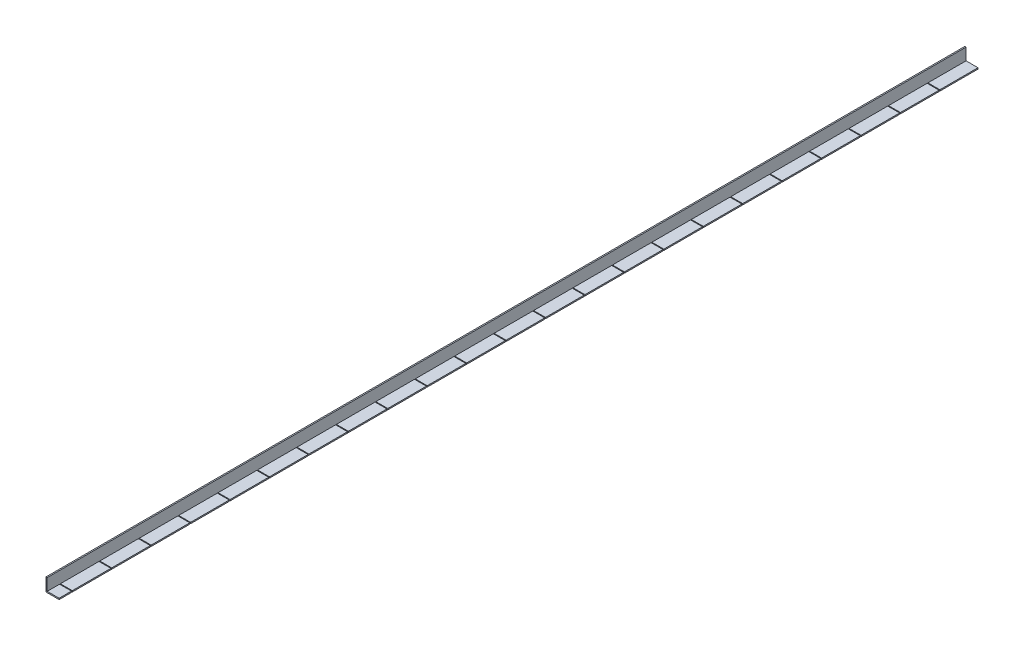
ISO-10303-21;
HEADER;
FILE_DESCRIPTION(('STEP AP214'),'2;1');
FILE_NAME('part.step','',(''),(''),'','','');
FILE_SCHEMA(('AUTOMOTIVE_DESIGN { 1 0 10303 214 1 1 1 1 }'));
ENDSEC;
DATA;
#1=APPLICATION_CONTEXT('core data for automotive mechanical design processes');
#2=APPLICATION_PROTOCOL_DEFINITION('international standard','automotive_design',2000,#1);
#3=PRODUCT_CONTEXT('',#1,'mechanical');
#4=PRODUCT('Part','Part','',(#3));
#5=PRODUCT_RELATED_PRODUCT_CATEGORY('part','',(#4));
#6=PRODUCT_DEFINITION_FORMATION('','',#4);
#7=PRODUCT_DEFINITION_CONTEXT('part definition',#1,'design');
#8=PRODUCT_DEFINITION('design','',#6,#7);
#9=PRODUCT_DEFINITION_SHAPE('','',#8);
#10=(LENGTH_UNIT() NAMED_UNIT(*) SI_UNIT(.MILLI.,.METRE.));
#11=(NAMED_UNIT(*) PLANE_ANGLE_UNIT() SI_UNIT($,.RADIAN.));
#12=(NAMED_UNIT(*) SI_UNIT($,.STERADIAN.) SOLID_ANGLE_UNIT());
#13=UNCERTAINTY_MEASURE_WITH_UNIT(LENGTH_MEASURE(1.E-05),#10,'distance_accuracy_value','');
#14=(GEOMETRIC_REPRESENTATION_CONTEXT(3) GLOBAL_UNCERTAINTY_ASSIGNED_CONTEXT((#13)) GLOBAL_UNIT_ASSIGNED_CONTEXT((#10,
#11,#12)) REPRESENTATION_CONTEXT('',''));
#15=CARTESIAN_POINT('',(0.,0.,0.));
#16=DIRECTION('',(0.,0.,1.));
#17=DIRECTION('',(1.,0.,0.));
#18=AXIS2_PLACEMENT_3D('',#15,#16,#17);
#19=CARTESIAN_POINT('',(4.7625,50.8,0.));
#20=DIRECTION('',(-1.,0.,0.));
#21=DIRECTION('',(0.,0.,1.));
#22=AXIS2_PLACEMENT_3D('',#19,#20,#21);
#23=PLANE('',#22);
#24=DIRECTION('',(0.,1.,0.));
#25=VECTOR('',#24,1.);
#26=CARTESIAN_POINT('',(4.7625,4.76250000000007,150.495));
#27=LINE('',#26,#25);
#28=CARTESIAN_POINT('',(4.7625,0.,150.495));
#29=VERTEX_POINT('',#28);
#30=CARTESIAN_POINT('',(4.7625,4.76250000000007,150.495));
#31=VERTEX_POINT('',#30);
#32=EDGE_CURVE('E2696',#29,#31,#27,.T.);
#33=ORIENTED_EDGE('',*,*,#32,.F.);
#34=DIRECTION('',(0.,0.,1.));
#35=VECTOR('',#34,1.);
#36=CARTESIAN_POINT('',(4.7625,0.,0.));
#37=LINE('',#36,#35);
#38=CARTESIAN_POINT('',(4.7625,0.,147.32));
#39=VERTEX_POINT('',#38);
#40=EDGE_CURVE('E661',#39,#29,#37,.T.);
#41=ORIENTED_EDGE('',*,*,#40,.F.);
#42=DIRECTION('',(0.,-1.,0.));
#43=VECTOR('',#42,1.);
#44=CARTESIAN_POINT('',(4.7625,0.,147.32));
#45=LINE('',#44,#43);
#46=CARTESIAN_POINT('',(4.7625,4.76250000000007,147.32));
#47=VERTEX_POINT('',#46);
#48=EDGE_CURVE('E1237',#47,#39,#45,.T.);
#49=ORIENTED_EDGE('',*,*,#48,.F.);
#50=DIRECTION('',(0.,0.,1.));
#51=VECTOR('',#50,1.);
#52=CARTESIAN_POINT('',(4.7625,4.76250000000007,147.32));
#53=LINE('',#52,#51);
#54=CARTESIAN_POINT('',(4.7625,4.76250000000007,0.));
#55=VERTEX_POINT('',#54);
#56=EDGE_CURVE('E1232',#55,#47,#53,.T.);
#57=ORIENTED_EDGE('',*,*,#56,.F.);
#58=DIRECTION('',(0.,-1.,0.));
#59=VECTOR('',#58,1.);
#60=CARTESIAN_POINT('',(4.7625,50.8,0.));
#61=LINE('',#60,#59);
#62=CARTESIAN_POINT('',(4.7625,50.8,0.));
#63=VERTEX_POINT('',#62);
#64=EDGE_CURVE('E1281',#63,#55,#61,.T.);
#65=ORIENTED_EDGE('',*,*,#64,.F.);
#66=DIRECTION('',(0.,0.,-1.));
#67=VECTOR('',#66,1.);
#68=CARTESIAN_POINT('',(4.7625,50.8,3550.92));
#69=LINE('',#68,#67);
#70=CARTESIAN_POINT('',(4.7625,50.8,3550.92));
#71=VERTEX_POINT('',#70);
#72=EDGE_CURVE('E1388',#71,#63,#69,.T.);
#73=ORIENTED_EDGE('',*,*,#72,.F.);
#74=DIRECTION('',(0.,1.,0.));
#75=VECTOR('',#74,1.);
#76=CARTESIAN_POINT('',(4.7625,0.,3550.92));
#77=LINE('',#76,#75);
#78=CARTESIAN_POINT('',(4.7625,4.76250000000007,3550.92));
#79=VERTEX_POINT('',#78);
#80=EDGE_CURVE('E1275',#79,#71,#77,.T.);
#81=ORIENTED_EDGE('',*,*,#80,.F.);
#82=DIRECTION('',(0.,0.,1.));
#83=VECTOR('',#82,1.);
#84=CARTESIAN_POINT('',(4.7625,4.76250000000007,3550.92));
#85=LINE('',#84,#83);
#86=CARTESIAN_POINT('',(4.7625,4.76250000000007,3503.295));
#87=VERTEX_POINT('',#86);
#88=EDGE_CURVE('E1252',#87,#79,#85,.T.);
#89=ORIENTED_EDGE('',*,*,#88,.F.);
#90=DIRECTION('',(0.,1.,0.));
#91=VECTOR('',#90,1.);
#92=CARTESIAN_POINT('',(4.7625,4.76250000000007,3503.295));
#93=LINE('',#92,#91);
#94=CARTESIAN_POINT('',(4.7625,0.,3503.295));
#95=VERTEX_POINT('',#94);
#96=EDGE_CURVE('E1257',#95,#87,#93,.T.);
#97=ORIENTED_EDGE('',*,*,#96,.F.);
#98=CARTESIAN_POINT('',(4.7625,0.,3500.12));
#99=VERTEX_POINT('',#98);
#100=EDGE_CURVE('E1276',#99,#95,#37,.T.);
#101=ORIENTED_EDGE('',*,*,#100,.F.);
#102=DIRECTION('',(0.,-1.,0.));
#103=VECTOR('',#102,1.);
#104=CARTESIAN_POINT('',(4.7625,0.,3500.12));
#105=LINE('',#104,#103);
#106=CARTESIAN_POINT('',(4.7625,4.76250000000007,3500.12));
#107=VERTEX_POINT('',#106);
#108=EDGE_CURVE('E1210',#107,#99,#105,.T.);
#109=ORIENTED_EDGE('',*,*,#108,.F.);
#110=DIRECTION('',(0.,0.,1.));
#111=VECTOR('',#110,1.);
#112=CARTESIAN_POINT('',(4.7625,4.76250000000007,3500.12));
#113=LINE('',#112,#111);
#114=CARTESIAN_POINT('',(4.7625,4.76250000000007,3350.895));
#115=VERTEX_POINT('',#114);
#116=EDGE_CURVE('E1218',#115,#107,#113,.T.);
#117=ORIENTED_EDGE('',*,*,#116,.F.);
#118=DIRECTION('',(0.,1.,0.));
#119=VECTOR('',#118,1.);
#120=CARTESIAN_POINT('',(4.7625,4.76250000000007,3350.895));
#121=LINE('',#120,#119);
#122=CARTESIAN_POINT('',(4.7625,0.,3350.895));
#123=VERTEX_POINT('',#122);
#124=EDGE_CURVE('E1205',#123,#115,#121,.T.);
#125=ORIENTED_EDGE('',*,*,#124,.F.);
#126=CARTESIAN_POINT('',(4.7625,0.,3347.72));
#127=VERTEX_POINT('',#126);
#128=EDGE_CURVE('E1289',#127,#123,#37,.T.);
#129=ORIENTED_EDGE('',*,*,#128,.F.);
#130=DIRECTION('',(0.,-1.,0.));
#131=VECTOR('',#130,1.);
#132=CARTESIAN_POINT('',(4.7625,0.,3347.72));
#133=LINE('',#132,#131);
#134=CARTESIAN_POINT('',(4.7625,4.76250000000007,3347.72));
#135=VERTEX_POINT('',#134);
#136=EDGE_CURVE('E1183',#135,#127,#133,.T.);
#137=ORIENTED_EDGE('',*,*,#136,.F.);
#138=DIRECTION('',(0.,0.,1.));
#139=VECTOR('',#138,1.);
#140=CARTESIAN_POINT('',(4.7625,4.76250000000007,3347.72));
#141=LINE('',#140,#139);
#142=CARTESIAN_POINT('',(4.7625,4.76250000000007,3198.495));
#143=VERTEX_POINT('',#142);
#144=EDGE_CURVE('E1191',#143,#135,#141,.T.);
#145=ORIENTED_EDGE('',*,*,#144,.F.);
#146=DIRECTION('',(0.,1.,0.));
#147=VECTOR('',#146,1.);
#148=CARTESIAN_POINT('',(4.7625,4.76250000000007,3198.495));
#149=LINE('',#148,#147);
#150=CARTESIAN_POINT('',(4.7625,0.,3198.495));
#151=VERTEX_POINT('',#150);
#152=EDGE_CURVE('E1178',#151,#143,#149,.T.);
#153=ORIENTED_EDGE('',*,*,#152,.F.);
#154=CARTESIAN_POINT('',(4.7625,0.,3195.32));
#155=VERTEX_POINT('',#154);
#156=EDGE_CURVE('E1292',#155,#151,#37,.T.);
#157=ORIENTED_EDGE('',*,*,#156,.F.);
#158=DIRECTION('',(0.,-1.,0.));
#159=VECTOR('',#158,1.);
#160=CARTESIAN_POINT('',(4.7625,0.,3195.32));
#161=LINE('',#160,#159);
#162=CARTESIAN_POINT('',(4.7625,4.76250000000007,3195.32));
#163=VERTEX_POINT('',#162);
#164=EDGE_CURVE('E1156',#163,#155,#161,.T.);
#165=ORIENTED_EDGE('',*,*,#164,.F.);
#166=DIRECTION('',(0.,0.,1.));
#167=VECTOR('',#166,1.);
#168=CARTESIAN_POINT('',(4.7625,4.76250000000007,3195.32));
#169=LINE('',#168,#167);
#170=CARTESIAN_POINT('',(4.7625,4.76250000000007,3046.095));
#171=VERTEX_POINT('',#170);
#172=EDGE_CURVE('E1164',#171,#163,#169,.T.);
#173=ORIENTED_EDGE('',*,*,#172,.F.);
#174=DIRECTION('',(0.,1.,0.));
#175=VECTOR('',#174,1.);
#176=CARTESIAN_POINT('',(4.7625,4.76250000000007,3046.095));
#177=LINE('',#176,#175);
#178=CARTESIAN_POINT('',(4.7625,0.,3046.095));
#179=VERTEX_POINT('',#178);
#180=EDGE_CURVE('E1151',#179,#171,#177,.T.);
#181=ORIENTED_EDGE('',*,*,#180,.F.);
#182=CARTESIAN_POINT('',(4.7625,0.,3042.92));
#183=VERTEX_POINT('',#182);
#184=EDGE_CURVE('E1295',#183,#179,#37,.T.);
#185=ORIENTED_EDGE('',*,*,#184,.F.);
#186=DIRECTION('',(0.,-1.,0.));
#187=VECTOR('',#186,1.);
#188=CARTESIAN_POINT('',(4.7625,0.,3042.92));
#189=LINE('',#188,#187);
#190=CARTESIAN_POINT('',(4.7625,4.76250000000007,3042.92));
#191=VERTEX_POINT('',#190);
#192=EDGE_CURVE('E1129',#191,#183,#189,.T.);
#193=ORIENTED_EDGE('',*,*,#192,.F.);
#194=DIRECTION('',(0.,0.,1.));
#195=VECTOR('',#194,1.);
#196=CARTESIAN_POINT('',(4.7625,4.76250000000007,3042.92));
#197=LINE('',#196,#195);
#198=CARTESIAN_POINT('',(4.7625,4.76250000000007,2893.695));
#199=VERTEX_POINT('',#198);
#200=EDGE_CURVE('E1137',#199,#191,#197,.T.);
#201=ORIENTED_EDGE('',*,*,#200,.F.);
#202=DIRECTION('',(0.,1.,0.));
#203=VECTOR('',#202,1.);
#204=CARTESIAN_POINT('',(4.7625,4.76250000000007,2893.695));
#205=LINE('',#204,#203);
#206=CARTESIAN_POINT('',(4.7625,0.,2893.695));
#207=VERTEX_POINT('',#206);
#208=EDGE_CURVE('E1124',#207,#199,#205,.T.);
#209=ORIENTED_EDGE('',*,*,#208,.F.);
#210=CARTESIAN_POINT('',(4.7625,0.,2890.52));
#211=VERTEX_POINT('',#210);
#212=EDGE_CURVE('E1298',#211,#207,#37,.T.);
#213=ORIENTED_EDGE('',*,*,#212,.F.);
#214=DIRECTION('',(0.,-1.,0.));
#215=VECTOR('',#214,1.);
#216=CARTESIAN_POINT('',(4.7625,0.,2890.52));
#217=LINE('',#216,#215);
#218=CARTESIAN_POINT('',(4.7625,4.76250000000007,2890.52));
#219=VERTEX_POINT('',#218);
#220=EDGE_CURVE('E1102',#219,#211,#217,.T.);
#221=ORIENTED_EDGE('',*,*,#220,.F.);
#222=DIRECTION('',(0.,0.,1.));
#223=VECTOR('',#222,1.);
#224=CARTESIAN_POINT('',(4.7625,4.76250000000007,2890.52));
#225=LINE('',#224,#223);
#226=CARTESIAN_POINT('',(4.7625,4.76250000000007,2741.295));
#227=VERTEX_POINT('',#226);
#228=EDGE_CURVE('E1110',#227,#219,#225,.T.);
#229=ORIENTED_EDGE('',*,*,#228,.F.);
#230=DIRECTION('',(0.,1.,0.));
#231=VECTOR('',#230,1.);
#232=CARTESIAN_POINT('',(4.7625,4.76250000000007,2741.295));
#233=LINE('',#232,#231);
#234=CARTESIAN_POINT('',(4.7625,0.,2741.295));
#235=VERTEX_POINT('',#234);
#236=EDGE_CURVE('E1097',#235,#227,#233,.T.);
#237=ORIENTED_EDGE('',*,*,#236,.F.);
#238=CARTESIAN_POINT('',(4.7625,0.,2738.12));
#239=VERTEX_POINT('',#238);
#240=EDGE_CURVE('E1301',#239,#235,#37,.T.);
#241=ORIENTED_EDGE('',*,*,#240,.F.);
#242=DIRECTION('',(0.,-1.,0.));
#243=VECTOR('',#242,1.);
#244=CARTESIAN_POINT('',(4.7625,0.,2738.12));
#245=LINE('',#244,#243);
#246=CARTESIAN_POINT('',(4.7625,4.76250000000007,2738.12));
#247=VERTEX_POINT('',#246);
#248=EDGE_CURVE('E1075',#247,#239,#245,.T.);
#249=ORIENTED_EDGE('',*,*,#248,.F.);
#250=DIRECTION('',(0.,0.,1.));
#251=VECTOR('',#250,1.);
#252=CARTESIAN_POINT('',(4.7625,4.76250000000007,2738.12));
#253=LINE('',#252,#251);
#254=CARTESIAN_POINT('',(4.7625,4.76250000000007,2588.895));
#255=VERTEX_POINT('',#254);
#256=EDGE_CURVE('E1083',#255,#247,#253,.T.);
#257=ORIENTED_EDGE('',*,*,#256,.F.);
#258=DIRECTION('',(0.,1.,0.));
#259=VECTOR('',#258,1.);
#260=CARTESIAN_POINT('',(4.7625,4.76250000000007,2588.895));
#261=LINE('',#260,#259);
#262=CARTESIAN_POINT('',(4.7625,0.,2588.895));
#263=VERTEX_POINT('',#262);
#264=EDGE_CURVE('E1070',#263,#255,#261,.T.);
#265=ORIENTED_EDGE('',*,*,#264,.F.);
#266=CARTESIAN_POINT('',(4.7625,0.,2585.72));
#267=VERTEX_POINT('',#266);
#268=EDGE_CURVE('E1304',#267,#263,#37,.T.);
#269=ORIENTED_EDGE('',*,*,#268,.F.);
#270=DIRECTION('',(0.,-1.,0.));
#271=VECTOR('',#270,1.);
#272=CARTESIAN_POINT('',(4.7625,0.,2585.72));
#273=LINE('',#272,#271);
#274=CARTESIAN_POINT('',(4.7625,4.76250000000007,2585.72));
#275=VERTEX_POINT('',#274);
#276=EDGE_CURVE('E1048',#275,#267,#273,.T.);
#277=ORIENTED_EDGE('',*,*,#276,.F.);
#278=DIRECTION('',(0.,0.,1.));
#279=VECTOR('',#278,1.);
#280=CARTESIAN_POINT('',(4.7625,4.76250000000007,2585.72));
#281=LINE('',#280,#279);
#282=CARTESIAN_POINT('',(4.7625,4.76250000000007,2436.495));
#283=VERTEX_POINT('',#282);
#284=EDGE_CURVE('E1056',#283,#275,#281,.T.);
#285=ORIENTED_EDGE('',*,*,#284,.F.);
#286=DIRECTION('',(0.,1.,0.));
#287=VECTOR('',#286,1.);
#288=CARTESIAN_POINT('',(4.7625,4.76250000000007,2436.495));
#289=LINE('',#288,#287);
#290=CARTESIAN_POINT('',(4.7625,0.,2436.495));
#291=VERTEX_POINT('',#290);
#292=EDGE_CURVE('E1043',#291,#283,#289,.T.);
#293=ORIENTED_EDGE('',*,*,#292,.F.);
#294=CARTESIAN_POINT('',(4.7625,0.,2433.32));
#295=VERTEX_POINT('',#294);
#296=EDGE_CURVE('E1307',#295,#291,#37,.T.);
#297=ORIENTED_EDGE('',*,*,#296,.F.);
#298=DIRECTION('',(0.,-1.,0.));
#299=VECTOR('',#298,1.);
#300=CARTESIAN_POINT('',(4.7625,0.,2433.32));
#301=LINE('',#300,#299);
#302=CARTESIAN_POINT('',(4.7625,4.76250000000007,2433.32));
#303=VERTEX_POINT('',#302);
#304=EDGE_CURVE('E1021',#303,#295,#301,.T.);
#305=ORIENTED_EDGE('',*,*,#304,.F.);
#306=DIRECTION('',(0.,0.,1.));
#307=VECTOR('',#306,1.);
#308=CARTESIAN_POINT('',(4.7625,4.76250000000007,2433.32));
#309=LINE('',#308,#307);
#310=CARTESIAN_POINT('',(4.7625,4.76250000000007,2284.095));
#311=VERTEX_POINT('',#310);
#312=EDGE_CURVE('E1029',#311,#303,#309,.T.);
#313=ORIENTED_EDGE('',*,*,#312,.F.);
#314=DIRECTION('',(0.,1.,0.));
#315=VECTOR('',#314,1.);
#316=CARTESIAN_POINT('',(4.7625,4.76250000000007,2284.095));
#317=LINE('',#316,#315);
#318=CARTESIAN_POINT('',(4.7625,0.,2284.095));
#319=VERTEX_POINT('',#318);
#320=EDGE_CURVE('E1016',#319,#311,#317,.T.);
#321=ORIENTED_EDGE('',*,*,#320,.F.);
#322=CARTESIAN_POINT('',(4.7625,0.,2280.92));
#323=VERTEX_POINT('',#322);
#324=EDGE_CURVE('E1310',#323,#319,#37,.T.);
#325=ORIENTED_EDGE('',*,*,#324,.F.);
#326=DIRECTION('',(0.,-1.,0.));
#327=VECTOR('',#326,1.);
#328=CARTESIAN_POINT('',(4.7625,0.,2280.92));
#329=LINE('',#328,#327);
#330=CARTESIAN_POINT('',(4.7625,4.76250000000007,2280.92));
#331=VERTEX_POINT('',#330);
#332=EDGE_CURVE('E994',#331,#323,#329,.T.);
#333=ORIENTED_EDGE('',*,*,#332,.F.);
#334=DIRECTION('',(0.,0.,1.));
#335=VECTOR('',#334,1.);
#336=CARTESIAN_POINT('',(4.7625,4.76250000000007,2280.92));
#337=LINE('',#336,#335);
#338=CARTESIAN_POINT('',(4.7625,4.76250000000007,2131.695));
#339=VERTEX_POINT('',#338);
#340=EDGE_CURVE('E1002',#339,#331,#337,.T.);
#341=ORIENTED_EDGE('',*,*,#340,.F.);
#342=DIRECTION('',(0.,1.,0.));
#343=VECTOR('',#342,1.);
#344=CARTESIAN_POINT('',(4.7625,4.76250000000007,2131.695));
#345=LINE('',#344,#343);
#346=CARTESIAN_POINT('',(4.7625,0.,2131.695));
#347=VERTEX_POINT('',#346);
#348=EDGE_CURVE('E989',#347,#339,#345,.T.);
#349=ORIENTED_EDGE('',*,*,#348,.F.);
#350=CARTESIAN_POINT('',(4.7625,0.,2128.52));
#351=VERTEX_POINT('',#350);
#352=EDGE_CURVE('E1313',#351,#347,#37,.T.);
#353=ORIENTED_EDGE('',*,*,#352,.F.);
#354=DIRECTION('',(0.,-1.,0.));
#355=VECTOR('',#354,1.);
#356=CARTESIAN_POINT('',(4.7625,0.,2128.52));
#357=LINE('',#356,#355);
#358=CARTESIAN_POINT('',(4.7625,4.76250000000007,2128.52));
#359=VERTEX_POINT('',#358);
#360=EDGE_CURVE('E967',#359,#351,#357,.T.);
#361=ORIENTED_EDGE('',*,*,#360,.F.);
#362=DIRECTION('',(0.,0.,1.));
#363=VECTOR('',#362,1.);
#364=CARTESIAN_POINT('',(4.7625,4.76250000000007,2128.52));
#365=LINE('',#364,#363);
#366=CARTESIAN_POINT('',(4.7625,4.76250000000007,1979.295));
#367=VERTEX_POINT('',#366);
#368=EDGE_CURVE('E975',#367,#359,#365,.T.);
#369=ORIENTED_EDGE('',*,*,#368,.F.);
#370=DIRECTION('',(0.,1.,0.));
#371=VECTOR('',#370,1.);
#372=CARTESIAN_POINT('',(4.7625,4.76250000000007,1979.295));
#373=LINE('',#372,#371);
#374=CARTESIAN_POINT('',(4.7625,0.,1979.295));
#375=VERTEX_POINT('',#374);
#376=EDGE_CURVE('E962',#375,#367,#373,.T.);
#377=ORIENTED_EDGE('',*,*,#376,.F.);
#378=CARTESIAN_POINT('',(4.7625,0.,1976.12));
#379=VERTEX_POINT('',#378);
#380=EDGE_CURVE('E1316',#379,#375,#37,.T.);
#381=ORIENTED_EDGE('',*,*,#380,.F.);
#382=DIRECTION('',(0.,-1.,0.));
#383=VECTOR('',#382,1.);
#384=CARTESIAN_POINT('',(4.7625,0.,1976.12));
#385=LINE('',#384,#383);
#386=CARTESIAN_POINT('',(4.7625,4.76250000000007,1976.12));
#387=VERTEX_POINT('',#386);
#388=EDGE_CURVE('E940',#387,#379,#385,.T.);
#389=ORIENTED_EDGE('',*,*,#388,.F.);
#390=DIRECTION('',(0.,0.,1.));
#391=VECTOR('',#390,1.);
#392=CARTESIAN_POINT('',(4.7625,4.76250000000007,1976.12));
#393=LINE('',#392,#391);
#394=CARTESIAN_POINT('',(4.7625,4.76250000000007,1826.895));
#395=VERTEX_POINT('',#394);
#396=EDGE_CURVE('E948',#395,#387,#393,.T.);
#397=ORIENTED_EDGE('',*,*,#396,.F.);
#398=DIRECTION('',(0.,1.,0.));
#399=VECTOR('',#398,1.);
#400=CARTESIAN_POINT('',(4.7625,4.76250000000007,1826.895));
#401=LINE('',#400,#399);
#402=CARTESIAN_POINT('',(4.7625,0.,1826.895));
#403=VERTEX_POINT('',#402);
#404=EDGE_CURVE('E935',#403,#395,#401,.T.);
#405=ORIENTED_EDGE('',*,*,#404,.F.);
#406=CARTESIAN_POINT('',(4.7625,0.,1823.72));
#407=VERTEX_POINT('',#406);
#408=EDGE_CURVE('E1319',#407,#403,#37,.T.);
#409=ORIENTED_EDGE('',*,*,#408,.F.);
#410=DIRECTION('',(0.,-1.,0.));
#411=VECTOR('',#410,1.);
#412=CARTESIAN_POINT('',(4.7625,0.,1823.72));
#413=LINE('',#412,#411);
#414=CARTESIAN_POINT('',(4.7625,4.76250000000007,1823.72));
#415=VERTEX_POINT('',#414);
#416=EDGE_CURVE('E913',#415,#407,#413,.T.);
#417=ORIENTED_EDGE('',*,*,#416,.F.);
#418=DIRECTION('',(0.,0.,1.));
#419=VECTOR('',#418,1.);
#420=CARTESIAN_POINT('',(4.7625,4.76250000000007,1823.72));
#421=LINE('',#420,#419);
#422=CARTESIAN_POINT('',(4.7625,4.76250000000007,1674.495));
#423=VERTEX_POINT('',#422);
#424=EDGE_CURVE('E921',#423,#415,#421,.T.);
#425=ORIENTED_EDGE('',*,*,#424,.F.);
#426=DIRECTION('',(0.,1.,0.));
#427=VECTOR('',#426,1.);
#428=CARTESIAN_POINT('',(4.7625,4.76250000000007,1674.495));
#429=LINE('',#428,#427);
#430=CARTESIAN_POINT('',(4.7625,0.,1674.495));
#431=VERTEX_POINT('',#430);
#432=EDGE_CURVE('E908',#431,#423,#429,.T.);
#433=ORIENTED_EDGE('',*,*,#432,.F.);
#434=CARTESIAN_POINT('',(4.7625,0.,1671.32));
#435=VERTEX_POINT('',#434);
#436=EDGE_CURVE('E1322',#435,#431,#37,.T.);
#437=ORIENTED_EDGE('',*,*,#436,.F.);
#438=DIRECTION('',(0.,-1.,0.));
#439=VECTOR('',#438,1.);
#440=CARTESIAN_POINT('',(4.7625,0.,1671.32));
#441=LINE('',#440,#439);
#442=CARTESIAN_POINT('',(4.7625,4.76250000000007,1671.32));
#443=VERTEX_POINT('',#442);
#444=EDGE_CURVE('E886',#443,#435,#441,.T.);
#445=ORIENTED_EDGE('',*,*,#444,.F.);
#446=DIRECTION('',(0.,0.,1.));
#447=VECTOR('',#446,1.);
#448=CARTESIAN_POINT('',(4.7625,4.76250000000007,1671.32));
#449=LINE('',#448,#447);
#450=CARTESIAN_POINT('',(4.7625,4.76250000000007,1522.095));
#451=VERTEX_POINT('',#450);
#452=EDGE_CURVE('E894',#451,#443,#449,.T.);
#453=ORIENTED_EDGE('',*,*,#452,.F.);
#454=DIRECTION('',(0.,1.,0.));
#455=VECTOR('',#454,1.);
#456=CARTESIAN_POINT('',(4.7625,4.76250000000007,1522.095));
#457=LINE('',#456,#455);
#458=CARTESIAN_POINT('',(4.7625,0.,1522.095));
#459=VERTEX_POINT('',#458);
#460=EDGE_CURVE('E881',#459,#451,#457,.T.);
#461=ORIENTED_EDGE('',*,*,#460,.F.);
#462=CARTESIAN_POINT('',(4.7625,0.,1518.92));
#463=VERTEX_POINT('',#462);
#464=EDGE_CURVE('E1325',#463,#459,#37,.T.);
#465=ORIENTED_EDGE('',*,*,#464,.F.);
#466=DIRECTION('',(0.,-1.,0.));
#467=VECTOR('',#466,1.);
#468=CARTESIAN_POINT('',(4.7625,0.,1518.92));
#469=LINE('',#468,#467);
#470=CARTESIAN_POINT('',(4.7625,4.76250000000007,1518.92));
#471=VERTEX_POINT('',#470);
#472=EDGE_CURVE('E859',#471,#463,#469,.T.);
#473=ORIENTED_EDGE('',*,*,#472,.F.);
#474=DIRECTION('',(0.,0.,1.));
#475=VECTOR('',#474,1.);
#476=CARTESIAN_POINT('',(4.7625,4.76250000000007,1518.92));
#477=LINE('',#476,#475);
#478=CARTESIAN_POINT('',(4.7625,4.76250000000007,1369.695));
#479=VERTEX_POINT('',#478);
#480=EDGE_CURVE('E867',#479,#471,#477,.T.);
#481=ORIENTED_EDGE('',*,*,#480,.F.);
#482=DIRECTION('',(0.,1.,0.));
#483=VECTOR('',#482,1.);
#484=CARTESIAN_POINT('',(4.7625,4.76250000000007,1369.695));
#485=LINE('',#484,#483);
#486=CARTESIAN_POINT('',(4.7625,0.,1369.695));
#487=VERTEX_POINT('',#486);
#488=EDGE_CURVE('E854',#487,#479,#485,.T.);
#489=ORIENTED_EDGE('',*,*,#488,.F.);
#490=CARTESIAN_POINT('',(4.7625,0.,1366.52));
#491=VERTEX_POINT('',#490);
#492=EDGE_CURVE('E1328',#491,#487,#37,.T.);
#493=ORIENTED_EDGE('',*,*,#492,.F.);
#494=DIRECTION('',(0.,-1.,0.));
#495=VECTOR('',#494,1.);
#496=CARTESIAN_POINT('',(4.7625,0.,1366.52));
#497=LINE('',#496,#495);
#498=CARTESIAN_POINT('',(4.7625,4.76250000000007,1366.52));
#499=VERTEX_POINT('',#498);
#500=EDGE_CURVE('E832',#499,#491,#497,.T.);
#501=ORIENTED_EDGE('',*,*,#500,.F.);
#502=DIRECTION('',(0.,0.,1.));
#503=VECTOR('',#502,1.);
#504=CARTESIAN_POINT('',(4.7625,4.76250000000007,1366.52));
#505=LINE('',#504,#503);
#506=CARTESIAN_POINT('',(4.7625,4.76250000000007,1217.295));
#507=VERTEX_POINT('',#506);
#508=EDGE_CURVE('E840',#507,#499,#505,.T.);
#509=ORIENTED_EDGE('',*,*,#508,.F.);
#510=DIRECTION('',(0.,1.,0.));
#511=VECTOR('',#510,1.);
#512=CARTESIAN_POINT('',(4.7625,4.76250000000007,1217.295));
#513=LINE('',#512,#511);
#514=CARTESIAN_POINT('',(4.7625,0.,1217.295));
#515=VERTEX_POINT('',#514);
#516=EDGE_CURVE('E827',#515,#507,#513,.T.);
#517=ORIENTED_EDGE('',*,*,#516,.F.);
#518=CARTESIAN_POINT('',(4.7625,0.,1214.12));
#519=VERTEX_POINT('',#518);
#520=EDGE_CURVE('E1331',#519,#515,#37,.T.);
#521=ORIENTED_EDGE('',*,*,#520,.F.);
#522=DIRECTION('',(0.,-1.,0.));
#523=VECTOR('',#522,1.);
#524=CARTESIAN_POINT('',(4.7625,0.,1214.12));
#525=LINE('',#524,#523);
#526=CARTESIAN_POINT('',(4.7625,4.76250000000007,1214.12));
#527=VERTEX_POINT('',#526);
#528=EDGE_CURVE('E805',#527,#519,#525,.T.);
#529=ORIENTED_EDGE('',*,*,#528,.F.);
#530=DIRECTION('',(0.,0.,1.));
#531=VECTOR('',#530,1.);
#532=CARTESIAN_POINT('',(4.7625,4.76250000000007,1214.12));
#533=LINE('',#532,#531);
#534=CARTESIAN_POINT('',(4.7625,4.76250000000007,1064.895));
#535=VERTEX_POINT('',#534);
#536=EDGE_CURVE('E813',#535,#527,#533,.T.);
#537=ORIENTED_EDGE('',*,*,#536,.F.);
#538=DIRECTION('',(0.,1.,0.));
#539=VECTOR('',#538,1.);
#540=CARTESIAN_POINT('',(4.7625,4.76250000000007,1064.895));
#541=LINE('',#540,#539);
#542=CARTESIAN_POINT('',(4.7625,0.,1064.895));
#543=VERTEX_POINT('',#542);
#544=EDGE_CURVE('E800',#543,#535,#541,.T.);
#545=ORIENTED_EDGE('',*,*,#544,.F.);
#546=CARTESIAN_POINT('',(4.7625,0.,1061.72));
#547=VERTEX_POINT('',#546);
#548=EDGE_CURVE('E1334',#547,#543,#37,.T.);
#549=ORIENTED_EDGE('',*,*,#548,.F.);
#550=DIRECTION('',(0.,-1.,0.));
#551=VECTOR('',#550,1.);
#552=CARTESIAN_POINT('',(4.7625,0.,1061.72));
#553=LINE('',#552,#551);
#554=CARTESIAN_POINT('',(4.7625,4.76250000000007,1061.72));
#555=VERTEX_POINT('',#554);
#556=EDGE_CURVE('E778',#555,#547,#553,.T.);
#557=ORIENTED_EDGE('',*,*,#556,.F.);
#558=DIRECTION('',(0.,0.,1.));
#559=VECTOR('',#558,1.);
#560=CARTESIAN_POINT('',(4.7625,4.76250000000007,1061.72));
#561=LINE('',#560,#559);
#562=CARTESIAN_POINT('',(4.7625,4.76250000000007,912.495));
#563=VERTEX_POINT('',#562);
#564=EDGE_CURVE('E786',#563,#555,#561,.T.);
#565=ORIENTED_EDGE('',*,*,#564,.F.);
#566=DIRECTION('',(0.,1.,0.));
#567=VECTOR('',#566,1.);
#568=CARTESIAN_POINT('',(4.7625,4.76250000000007,912.495));
#569=LINE('',#568,#567);
#570=CARTESIAN_POINT('',(4.7625,0.,912.495));
#571=VERTEX_POINT('',#570);
#572=EDGE_CURVE('E773',#571,#563,#569,.T.);
#573=ORIENTED_EDGE('',*,*,#572,.F.);
#574=CARTESIAN_POINT('',(4.7625,0.,909.32));
#575=VERTEX_POINT('',#574);
#576=EDGE_CURVE('E1337',#575,#571,#37,.T.);
#577=ORIENTED_EDGE('',*,*,#576,.F.);
#578=DIRECTION('',(0.,-1.,0.));
#579=VECTOR('',#578,1.);
#580=CARTESIAN_POINT('',(4.7625,0.,909.32));
#581=LINE('',#580,#579);
#582=CARTESIAN_POINT('',(4.7625,4.76250000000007,909.32));
#583=VERTEX_POINT('',#582);
#584=EDGE_CURVE('E751',#583,#575,#581,.T.);
#585=ORIENTED_EDGE('',*,*,#584,.F.);
#586=DIRECTION('',(0.,0.,1.));
#587=VECTOR('',#586,1.);
#588=CARTESIAN_POINT('',(4.7625,4.76250000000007,909.32));
#589=LINE('',#588,#587);
#590=CARTESIAN_POINT('',(4.7625,4.76250000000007,760.095));
#591=VERTEX_POINT('',#590);
#592=EDGE_CURVE('E759',#591,#583,#589,.T.);
#593=ORIENTED_EDGE('',*,*,#592,.F.);
#594=DIRECTION('',(0.,1.,0.));
#595=VECTOR('',#594,1.);
#596=CARTESIAN_POINT('',(4.7625,4.76250000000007,760.095));
#597=LINE('',#596,#595);
#598=CARTESIAN_POINT('',(4.7625,0.,760.095));
#599=VERTEX_POINT('',#598);
#600=EDGE_CURVE('E746',#599,#591,#597,.T.);
#601=ORIENTED_EDGE('',*,*,#600,.F.);
#602=CARTESIAN_POINT('',(4.7625,0.,756.92));
#603=VERTEX_POINT('',#602);
#604=EDGE_CURVE('E1340',#603,#599,#37,.T.);
#605=ORIENTED_EDGE('',*,*,#604,.F.);
#606=DIRECTION('',(0.,-1.,0.));
#607=VECTOR('',#606,1.);
#608=CARTESIAN_POINT('',(4.7625,0.,756.92));
#609=LINE('',#608,#607);
#610=CARTESIAN_POINT('',(4.7625,4.76250000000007,756.92));
#611=VERTEX_POINT('',#610);
#612=EDGE_CURVE('E724',#611,#603,#609,.T.);
#613=ORIENTED_EDGE('',*,*,#612,.F.);
#614=DIRECTION('',(0.,0.,1.));
#615=VECTOR('',#614,1.);
#616=CARTESIAN_POINT('',(4.7625,4.76250000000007,756.92));
#617=LINE('',#616,#615);
#618=CARTESIAN_POINT('',(4.7625,4.76250000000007,607.695));
#619=VERTEX_POINT('',#618);
#620=EDGE_CURVE('E732',#619,#611,#617,.T.);
#621=ORIENTED_EDGE('',*,*,#620,.F.);
#622=DIRECTION('',(0.,1.,0.));
#623=VECTOR('',#622,1.);
#624=CARTESIAN_POINT('',(4.7625,4.76250000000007,607.695));
#625=LINE('',#624,#623);
#626=CARTESIAN_POINT('',(4.7625,0.,607.695));
#627=VERTEX_POINT('',#626);
#628=EDGE_CURVE('E719',#627,#619,#625,.T.);
#629=ORIENTED_EDGE('',*,*,#628,.F.);
#630=CARTESIAN_POINT('',(4.7625,0.,604.52));
#631=VERTEX_POINT('',#630);
#632=EDGE_CURVE('E1342',#631,#627,#37,.T.);
#633=ORIENTED_EDGE('',*,*,#632,.F.);
#634=DIRECTION('',(0.,-1.,0.));
#635=VECTOR('',#634,1.);
#636=CARTESIAN_POINT('',(4.7625,0.,604.52));
#637=LINE('',#636,#635);
#638=CARTESIAN_POINT('',(4.7625,4.76250000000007,604.52));
#639=VERTEX_POINT('',#638);
#640=EDGE_CURVE('E697',#639,#631,#637,.T.);
#641=ORIENTED_EDGE('',*,*,#640,.F.);
#642=DIRECTION('',(0.,0.,1.));
#643=VECTOR('',#642,1.);
#644=CARTESIAN_POINT('',(4.7625,4.76250000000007,604.52));
#645=LINE('',#644,#643);
#646=CARTESIAN_POINT('',(4.7625,4.76250000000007,455.295));
#647=VERTEX_POINT('',#646);
#648=EDGE_CURVE('E705',#647,#639,#645,.T.);
#649=ORIENTED_EDGE('',*,*,#648,.F.);
#650=DIRECTION('',(0.,1.,0.));
#651=VECTOR('',#650,1.);
#652=CARTESIAN_POINT('',(4.7625,4.76250000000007,455.295));
#653=LINE('',#652,#651);
#654=CARTESIAN_POINT('',(4.7625,0.,455.295));
#655=VERTEX_POINT('',#654);
#656=EDGE_CURVE('E692',#655,#647,#653,.T.);
#657=ORIENTED_EDGE('',*,*,#656,.F.);
#658=CARTESIAN_POINT('',(4.7625,0.,452.12));
#659=VERTEX_POINT('',#658);
#660=EDGE_CURVE('E1343',#659,#655,#37,.T.);
#661=ORIENTED_EDGE('',*,*,#660,.F.);
#662=DIRECTION('',(0.,-1.,0.));
#663=VECTOR('',#662,1.);
#664=CARTESIAN_POINT('',(4.7625,0.,452.12));
#665=LINE('',#664,#663);
#666=CARTESIAN_POINT('',(4.7625,4.76250000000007,452.12));
#667=VERTEX_POINT('',#666);
#668=EDGE_CURVE('E674',#667,#659,#665,.T.);
#669=ORIENTED_EDGE('',*,*,#668,.F.);
#670=DIRECTION('',(0.,0.,1.));
#671=VECTOR('',#670,1.);
#672=CARTESIAN_POINT('',(4.7625,4.76250000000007,452.12));
#673=LINE('',#672,#671);
#674=CARTESIAN_POINT('',(4.7625,4.76250000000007,302.895));
#675=VERTEX_POINT('',#674);
#676=EDGE_CURVE('E664',#675,#667,#673,.T.);
#677=ORIENTED_EDGE('',*,*,#676,.F.);
#678=DIRECTION('',(0.,1.,0.));
#679=VECTOR('',#678,1.);
#680=CARTESIAN_POINT('',(4.7625,4.76250000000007,302.895));
#681=LINE('',#680,#679);
#682=CARTESIAN_POINT('',(4.7625,0.,302.895));
#683=VERTEX_POINT('',#682);
#684=EDGE_CURVE('E662',#683,#675,#681,.T.);
#685=ORIENTED_EDGE('',*,*,#684,.F.);
#686=CARTESIAN_POINT('',(4.7625,0.,299.72));
#687=VERTEX_POINT('',#686);
#688=EDGE_CURVE('E35',#687,#683,#37,.T.);
#689=ORIENTED_EDGE('',*,*,#688,.F.);
#690=DIRECTION('',(0.,-1.,0.));
#691=VECTOR('',#690,1.);
#692=CARTESIAN_POINT('',(4.7625,0.,299.72));
#693=LINE('',#692,#691);
#694=CARTESIAN_POINT('',(4.7625,4.76250000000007,299.72));
#695=VERTEX_POINT('',#694);
#696=EDGE_CURVE('E654',#695,#687,#693,.T.);
#697=ORIENTED_EDGE('',*,*,#696,.F.);
#698=DIRECTION('',(0.,0.,1.));
#699=VECTOR('',#698,1.);
#700=CARTESIAN_POINT('',(4.7625,4.76250000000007,299.72));
#701=LINE('',#700,#699);
#702=EDGE_CURVE('E2506',#31,#695,#701,.T.);
#703=ORIENTED_EDGE('',*,*,#702,.F.);
#704=EDGE_LOOP('',(#33,#41,#49,#57,#65,#73,#81,#89,#97,#101,#109,#117,#125,#129,#137,#145,#153,
#157,#165,#173,#181,#185,#193,#201,#209,#213,#221,#229,#237,#241,#249,#257,#265,#269,#277,#285,
#293,#297,#305,#313,#321,#325,#333,#341,#349,#353,#361,#369,#377,#381,#389,#397,#405,#409,#417,
#425,#433,#437,#445,#453,#461,#465,#473,#481,#489,#493,#501,#509,#517,#521,#529,#537,#545,#549,
#557,#565,#573,#577,#585,#593,#601,#605,#613,#621,#629,#633,#641,#649,#657,#661,#669,#677,#685,
#689,#697,#703));
#705=FACE_BOUND('',#704,.T.);
#706=ADVANCED_FACE('F31',(#705),#23,.F.);
#707=CARTESIAN_POINT('',(4.7625,50.8,3550.92));
#708=DIRECTION('',(0.,1.,0.));
#709=DIRECTION('',(0.,0.,1.));
#710=AXIS2_PLACEMENT_3D('',#707,#708,#709);
#711=PLANE('',#710);
#712=DIRECTION('',(0.,0.,-1.));
#713=VECTOR('',#712,1.);
#714=CARTESIAN_POINT('',(0.,50.8,3550.92));
#715=LINE('',#714,#713);
#716=CARTESIAN_POINT('',(0.,50.8,3550.92));
#717=VERTEX_POINT('',#716);
#718=CARTESIAN_POINT('',(0.,50.8,0.));
#719=VERTEX_POINT('',#718);
#720=EDGE_CURVE('E1424',#717,#719,#715,.T.);
#721=ORIENTED_EDGE('',*,*,#720,.F.);
#722=DIRECTION('',(-1.,0.,0.));
#723=VECTOR('',#722,1.);
#724=CARTESIAN_POINT('',(4.7625,50.8,3550.92));
#725=LINE('',#724,#723);
#726=EDGE_CURVE('E11',#71,#717,#725,.T.);
#727=ORIENTED_EDGE('',*,*,#726,.F.);
#728=ORIENTED_EDGE('',*,*,#72,.T.);
#729=DIRECTION('',(-1.,0.,0.));
#730=VECTOR('',#729,1.);
#731=CARTESIAN_POINT('',(4.7625,50.8,0.));
#732=LINE('',#731,#730);
#733=EDGE_CURVE('E1411',#63,#719,#732,.T.);
#734=ORIENTED_EDGE('',*,*,#733,.T.);
#735=EDGE_LOOP('',(#721,#727,#728,#734));
#736=FACE_BOUND('',#735,.T.);
#737=ADVANCED_FACE('F33',(#736),#711,.T.);
#738=CARTESIAN_POINT('',(4.7625,0.,3550.92));
#739=DIRECTION('',(0.,0.,1.));
#740=DIRECTION('',(1.,0.,0.));
#741=AXIS2_PLACEMENT_3D('',#738,#739,#740);
#742=PLANE('',#741);
#743=DIRECTION('',(0.,1.,0.));
#744=VECTOR('',#743,1.);
#745=CARTESIAN_POINT('',(0.,0.,3550.92));
#746=LINE('',#745,#744);
#747=CARTESIAN_POINT('',(0.,0.,3550.92));
#748=VERTEX_POINT('',#747);
#749=EDGE_CURVE('E1393',#748,#717,#746,.T.);
#750=ORIENTED_EDGE('',*,*,#749,.F.);
#751=DIRECTION('',(-1.,0.,0.));
#752=VECTOR('',#751,1.);
#753=CARTESIAN_POINT('',(4.7625,0.,3550.92));
#754=LINE('',#753,#752);
#755=CARTESIAN_POINT('',(50.8,0.,3550.92));
#756=VERTEX_POINT('',#755);
#757=EDGE_CURVE('E41',#756,#748,#754,.T.);
#758=ORIENTED_EDGE('',*,*,#757,.F.);
#759=DIRECTION('',(0.,-1.,0.));
#760=VECTOR('',#759,1.);
#761=CARTESIAN_POINT('',(50.8,0.,3550.92));
#762=LINE('',#761,#760);
#763=CARTESIAN_POINT('',(50.8,4.76250000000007,3550.92));
#764=VERTEX_POINT('',#763);
#765=EDGE_CURVE('E1256',#764,#756,#762,.T.);
#766=ORIENTED_EDGE('',*,*,#765,.F.);
#767=DIRECTION('',(-1.,0.,0.));
#768=VECTOR('',#767,1.);
#769=CARTESIAN_POINT('',(50.8,4.76250000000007,3550.92));
#770=LINE('',#769,#768);
#771=EDGE_CURVE('E1421',#764,#79,#770,.T.);
#772=ORIENTED_EDGE('',*,*,#771,.T.);
#773=ORIENTED_EDGE('',*,*,#80,.T.);
#774=ORIENTED_EDGE('',*,*,#726,.T.);
#775=EDGE_LOOP('',(#750,#758,#766,#772,#773,#774));
#776=FACE_BOUND('',#775,.T.);
#777=ADVANCED_FACE('F1435',(#776),#742,.T.);
#778=CARTESIAN_POINT('',(4.7625,0.,0.));
#779=DIRECTION('',(0.,-1.,0.));
#780=DIRECTION('',(0.,0.,-1.));
#781=AXIS2_PLACEMENT_3D('',#778,#779,#780);
#782=PLANE('',#781);
#783=DIRECTION('',(0.,0.,1.));
#784=VECTOR('',#783,1.);
#785=CARTESIAN_POINT('',(0.,0.,0.));
#786=LINE('',#785,#784);
#787=CARTESIAN_POINT('',(0.,0.,0.));
#788=VERTEX_POINT('',#787);
#789=EDGE_CURVE('E1398',#788,#748,#786,.T.);
#790=ORIENTED_EDGE('',*,*,#789,.F.);
#791=DIRECTION('',(-1.,0.,0.));
#792=VECTOR('',#791,1.);
#793=CARTESIAN_POINT('',(4.7625,0.,0.));
#794=LINE('',#793,#792);
#795=CARTESIAN_POINT('',(50.8,0.,0.));
#796=VERTEX_POINT('',#795);
#797=EDGE_CURVE('E1409',#796,#788,#794,.T.);
#798=ORIENTED_EDGE('',*,*,#797,.F.);
#799=DIRECTION('',(0.,0.,-1.));
#800=VECTOR('',#799,1.);
#801=CARTESIAN_POINT('',(50.8,0.,0.));
#802=LINE('',#801,#800);
#803=CARTESIAN_POINT('',(50.8,0.,147.32));
#804=VERTEX_POINT('',#803);
#805=EDGE_CURVE('E1233',#804,#796,#802,.T.);
#806=ORIENTED_EDGE('',*,*,#805,.F.);
#807=DIRECTION('',(-1.,0.,0.));
#808=VECTOR('',#807,1.);
#809=CARTESIAN_POINT('',(50.8,0.,147.32));
#810=LINE('',#809,#808);
#811=EDGE_CURVE('E1243',#804,#39,#810,.T.);
#812=ORIENTED_EDGE('',*,*,#811,.T.);
#813=ORIENTED_EDGE('',*,*,#40,.T.);
#814=DIRECTION('',(-1.,0.,0.));
#815=VECTOR('',#814,1.);
#816=CARTESIAN_POINT('',(50.8,0.,150.495));
#817=LINE('',#816,#815);
#818=CARTESIAN_POINT('',(50.8,0.,150.495));
#819=VERTEX_POINT('',#818);
#820=EDGE_CURVE('E642',#819,#29,#817,.T.);
#821=ORIENTED_EDGE('',*,*,#820,.F.);
#822=DIRECTION('',(0.,0.,-1.));
#823=VECTOR('',#822,1.);
#824=CARTESIAN_POINT('',(50.8,0.,150.495));
#825=LINE('',#824,#823);
#826=CARTESIAN_POINT('',(50.8,0.,299.72));
#827=VERTEX_POINT('',#826);
#828=EDGE_CURVE('E649',#827,#819,#825,.T.);
#829=ORIENTED_EDGE('',*,*,#828,.F.);
#830=DIRECTION('',(-1.,0.,0.));
#831=VECTOR('',#830,1.);
#832=CARTESIAN_POINT('',(50.8,0.,299.72));
#833=LINE('',#832,#831);
#834=EDGE_CURVE('E49',#827,#687,#833,.T.);
#835=ORIENTED_EDGE('',*,*,#834,.T.);
#836=ORIENTED_EDGE('',*,*,#688,.T.);
#837=DIRECTION('',(-1.,0.,0.));
#838=VECTOR('',#837,1.);
#839=CARTESIAN_POINT('',(50.8,0.,302.895));
#840=LINE('',#839,#838);
#841=CARTESIAN_POINT('',(50.8,0.,302.895));
#842=VERTEX_POINT('',#841);
#843=EDGE_CURVE('E689',#842,#683,#840,.T.);
#844=ORIENTED_EDGE('',*,*,#843,.F.);
#845=DIRECTION('',(0.,0.,-1.));
#846=VECTOR('',#845,1.);
#847=CARTESIAN_POINT('',(50.8,0.,302.895));
#848=LINE('',#847,#846);
#849=CARTESIAN_POINT('',(50.8,0.,452.12));
#850=VERTEX_POINT('',#849);
#851=EDGE_CURVE('E670',#850,#842,#848,.T.);
#852=ORIENTED_EDGE('',*,*,#851,.F.);
#853=DIRECTION('',(-1.,0.,0.));
#854=VECTOR('',#853,1.);
#855=CARTESIAN_POINT('',(50.8,0.,452.12));
#856=LINE('',#855,#854);
#857=EDGE_CURVE('E56',#850,#659,#856,.T.);
#858=ORIENTED_EDGE('',*,*,#857,.T.);
#859=ORIENTED_EDGE('',*,*,#660,.T.);
#860=DIRECTION('',(-1.,0.,0.));
#861=VECTOR('',#860,1.);
#862=CARTESIAN_POINT('',(50.8,0.,455.295));
#863=LINE('',#862,#861);
#864=CARTESIAN_POINT('',(50.8,0.,455.295));
#865=VERTEX_POINT('',#864);
#866=EDGE_CURVE('E716',#865,#655,#863,.T.);
#867=ORIENTED_EDGE('',*,*,#866,.F.);
#868=DIRECTION('',(0.,0.,-1.));
#869=VECTOR('',#868,1.);
#870=CARTESIAN_POINT('',(50.8,0.,455.295));
#871=LINE('',#870,#869);
#872=CARTESIAN_POINT('',(50.8,0.,604.52));
#873=VERTEX_POINT('',#872);
#874=EDGE_CURVE('E693',#873,#865,#871,.T.);
#875=ORIENTED_EDGE('',*,*,#874,.F.);
#876=DIRECTION('',(-1.,0.,0.));
#877=VECTOR('',#876,1.);
#878=CARTESIAN_POINT('',(50.8,0.,604.52));
#879=LINE('',#878,#877);
#880=EDGE_CURVE('E703',#873,#631,#879,.T.);
#881=ORIENTED_EDGE('',*,*,#880,.T.);
#882=ORIENTED_EDGE('',*,*,#632,.T.);
#883=DIRECTION('',(-1.,0.,0.));
#884=VECTOR('',#883,1.);
#885=CARTESIAN_POINT('',(50.8,0.,607.695));
#886=LINE('',#885,#884);
#887=CARTESIAN_POINT('',(50.8,0.,607.695));
#888=VERTEX_POINT('',#887);
#889=EDGE_CURVE('E743',#888,#627,#886,.T.);
#890=ORIENTED_EDGE('',*,*,#889,.F.);
#891=DIRECTION('',(0.,0.,-1.));
#892=VECTOR('',#891,1.);
#893=CARTESIAN_POINT('',(50.8,0.,607.695));
#894=LINE('',#893,#892);
#895=CARTESIAN_POINT('',(50.8,0.,756.92));
#896=VERTEX_POINT('',#895);
#897=EDGE_CURVE('E720',#896,#888,#894,.T.);
#898=ORIENTED_EDGE('',*,*,#897,.F.);
#899=DIRECTION('',(-1.,0.,0.));
#900=VECTOR('',#899,1.);
#901=CARTESIAN_POINT('',(50.8,0.,756.92));
#902=LINE('',#901,#900);
#903=EDGE_CURVE('E730',#896,#603,#902,.T.);
#904=ORIENTED_EDGE('',*,*,#903,.T.);
#905=ORIENTED_EDGE('',*,*,#604,.T.);
#906=DIRECTION('',(-1.,0.,0.));
#907=VECTOR('',#906,1.);
#908=CARTESIAN_POINT('',(50.8,0.,760.095));
#909=LINE('',#908,#907);
#910=CARTESIAN_POINT('',(50.8,0.,760.095));
#911=VERTEX_POINT('',#910);
#912=EDGE_CURVE('E770',#911,#599,#909,.T.);
#913=ORIENTED_EDGE('',*,*,#912,.F.);
#914=DIRECTION('',(0.,0.,-1.));
#915=VECTOR('',#914,1.);
#916=CARTESIAN_POINT('',(50.8,0.,760.095));
#917=LINE('',#916,#915);
#918=CARTESIAN_POINT('',(50.8,0.,909.32));
#919=VERTEX_POINT('',#918);
#920=EDGE_CURVE('E747',#919,#911,#917,.T.);
#921=ORIENTED_EDGE('',*,*,#920,.F.);
#922=DIRECTION('',(-1.,0.,0.));
#923=VECTOR('',#922,1.);
#924=CARTESIAN_POINT('',(50.8,0.,909.32));
#925=LINE('',#924,#923);
#926=EDGE_CURVE('E757',#919,#575,#925,.T.);
#927=ORIENTED_EDGE('',*,*,#926,.T.);
#928=ORIENTED_EDGE('',*,*,#576,.T.);
#929=DIRECTION('',(-1.,0.,0.));
#930=VECTOR('',#929,1.);
#931=CARTESIAN_POINT('',(50.8,0.,912.495));
#932=LINE('',#931,#930);
#933=CARTESIAN_POINT('',(50.8,0.,912.495));
#934=VERTEX_POINT('',#933);
#935=EDGE_CURVE('E797',#934,#571,#932,.T.);
#936=ORIENTED_EDGE('',*,*,#935,.F.);
#937=DIRECTION('',(0.,0.,-1.));
#938=VECTOR('',#937,1.);
#939=CARTESIAN_POINT('',(50.8,0.,912.495));
#940=LINE('',#939,#938);
#941=CARTESIAN_POINT('',(50.8,0.,1061.72));
#942=VERTEX_POINT('',#941);
#943=EDGE_CURVE('E774',#942,#934,#940,.T.);
#944=ORIENTED_EDGE('',*,*,#943,.F.);
#945=DIRECTION('',(-1.,0.,0.));
#946=VECTOR('',#945,1.);
#947=CARTESIAN_POINT('',(50.8,0.,1061.72));
#948=LINE('',#947,#946);
#949=EDGE_CURVE('E784',#942,#547,#948,.T.);
#950=ORIENTED_EDGE('',*,*,#949,.T.);
#951=ORIENTED_EDGE('',*,*,#548,.T.);
#952=DIRECTION('',(-1.,0.,0.));
#953=VECTOR('',#952,1.);
#954=CARTESIAN_POINT('',(50.8,0.,1064.895));
#955=LINE('',#954,#953);
#956=CARTESIAN_POINT('',(50.8,0.,1064.895));
#957=VERTEX_POINT('',#956);
#958=EDGE_CURVE('E824',#957,#543,#955,.T.);
#959=ORIENTED_EDGE('',*,*,#958,.F.);
#960=DIRECTION('',(0.,0.,-1.));
#961=VECTOR('',#960,1.);
#962=CARTESIAN_POINT('',(50.8,0.,1064.895));
#963=LINE('',#962,#961);
#964=CARTESIAN_POINT('',(50.8,0.,1214.12));
#965=VERTEX_POINT('',#964);
#966=EDGE_CURVE('E801',#965,#957,#963,.T.);
#967=ORIENTED_EDGE('',*,*,#966,.F.);
#968=DIRECTION('',(-1.,0.,0.));
#969=VECTOR('',#968,1.);
#970=CARTESIAN_POINT('',(50.8,0.,1214.12));
#971=LINE('',#970,#969);
#972=EDGE_CURVE('E811',#965,#519,#971,.T.);
#973=ORIENTED_EDGE('',*,*,#972,.T.);
#974=ORIENTED_EDGE('',*,*,#520,.T.);
#975=DIRECTION('',(-1.,0.,0.));
#976=VECTOR('',#975,1.);
#977=CARTESIAN_POINT('',(50.8,0.,1217.295));
#978=LINE('',#977,#976);
#979=CARTESIAN_POINT('',(50.8,0.,1217.295));
#980=VERTEX_POINT('',#979);
#981=EDGE_CURVE('E851',#980,#515,#978,.T.);
#982=ORIENTED_EDGE('',*,*,#981,.F.);
#983=DIRECTION('',(0.,0.,-1.));
#984=VECTOR('',#983,1.);
#985=CARTESIAN_POINT('',(50.8,0.,1217.295));
#986=LINE('',#985,#984);
#987=CARTESIAN_POINT('',(50.8,0.,1366.52));
#988=VERTEX_POINT('',#987);
#989=EDGE_CURVE('E828',#988,#980,#986,.T.);
#990=ORIENTED_EDGE('',*,*,#989,.F.);
#991=DIRECTION('',(-1.,0.,0.));
#992=VECTOR('',#991,1.);
#993=CARTESIAN_POINT('',(50.8,0.,1366.52));
#994=LINE('',#993,#992);
#995=EDGE_CURVE('E838',#988,#491,#994,.T.);
#996=ORIENTED_EDGE('',*,*,#995,.T.);
#997=ORIENTED_EDGE('',*,*,#492,.T.);
#998=DIRECTION('',(-1.,0.,0.));
#999=VECTOR('',#998,1.);
#1000=CARTESIAN_POINT('',(50.8,0.,1369.695));
#1001=LINE('',#1000,#999);
#1002=CARTESIAN_POINT('',(50.8,0.,1369.695));
#1003=VERTEX_POINT('',#1002);
#1004=EDGE_CURVE('E878',#1003,#487,#1001,.T.);
#1005=ORIENTED_EDGE('',*,*,#1004,.F.);
#1006=DIRECTION('',(0.,0.,-1.));
#1007=VECTOR('',#1006,1.);
#1008=CARTESIAN_POINT('',(50.8,0.,1369.695));
#1009=LINE('',#1008,#1007);
#1010=CARTESIAN_POINT('',(50.8,0.,1518.92));
#1011=VERTEX_POINT('',#1010);
#1012=EDGE_CURVE('E855',#1011,#1003,#1009,.T.);
#1013=ORIENTED_EDGE('',*,*,#1012,.F.);
#1014=DIRECTION('',(-1.,0.,0.));
#1015=VECTOR('',#1014,1.);
#1016=CARTESIAN_POINT('',(50.8,0.,1518.92));
#1017=LINE('',#1016,#1015);
#1018=EDGE_CURVE('E865',#1011,#463,#1017,.T.);
#1019=ORIENTED_EDGE('',*,*,#1018,.T.);
#1020=ORIENTED_EDGE('',*,*,#464,.T.);
#1021=DIRECTION('',(-1.,0.,0.));
#1022=VECTOR('',#1021,1.);
#1023=CARTESIAN_POINT('',(50.8,0.,1522.095));
#1024=LINE('',#1023,#1022);
#1025=CARTESIAN_POINT('',(50.8,0.,1522.095));
#1026=VERTEX_POINT('',#1025);
#1027=EDGE_CURVE('E905',#1026,#459,#1024,.T.);
#1028=ORIENTED_EDGE('',*,*,#1027,.F.);
#1029=DIRECTION('',(0.,0.,-1.));
#1030=VECTOR('',#1029,1.);
#1031=CARTESIAN_POINT('',(50.8,0.,1522.095));
#1032=LINE('',#1031,#1030);
#1033=CARTESIAN_POINT('',(50.8,0.,1671.32));
#1034=VERTEX_POINT('',#1033);
#1035=EDGE_CURVE('E882',#1034,#1026,#1032,.T.);
#1036=ORIENTED_EDGE('',*,*,#1035,.F.);
#1037=DIRECTION('',(-1.,0.,0.));
#1038=VECTOR('',#1037,1.);
#1039=CARTESIAN_POINT('',(50.8,0.,1671.32));
#1040=LINE('',#1039,#1038);
#1041=EDGE_CURVE('E892',#1034,#435,#1040,.T.);
#1042=ORIENTED_EDGE('',*,*,#1041,.T.);
#1043=ORIENTED_EDGE('',*,*,#436,.T.);
#1044=DIRECTION('',(-1.,0.,0.));
#1045=VECTOR('',#1044,1.);
#1046=CARTESIAN_POINT('',(50.8,0.,1674.495));
#1047=LINE('',#1046,#1045);
#1048=CARTESIAN_POINT('',(50.8,0.,1674.495));
#1049=VERTEX_POINT('',#1048);
#1050=EDGE_CURVE('E932',#1049,#431,#1047,.T.);
#1051=ORIENTED_EDGE('',*,*,#1050,.F.);
#1052=DIRECTION('',(0.,0.,-1.));
#1053=VECTOR('',#1052,1.);
#1054=CARTESIAN_POINT('',(50.8,0.,1674.495));
#1055=LINE('',#1054,#1053);
#1056=CARTESIAN_POINT('',(50.8,0.,1823.72));
#1057=VERTEX_POINT('',#1056);
#1058=EDGE_CURVE('E909',#1057,#1049,#1055,.T.);
#1059=ORIENTED_EDGE('',*,*,#1058,.F.);
#1060=DIRECTION('',(-1.,0.,0.));
#1061=VECTOR('',#1060,1.);
#1062=CARTESIAN_POINT('',(50.8,0.,1823.72));
#1063=LINE('',#1062,#1061);
#1064=EDGE_CURVE('E919',#1057,#407,#1063,.T.);
#1065=ORIENTED_EDGE('',*,*,#1064,.T.);
#1066=ORIENTED_EDGE('',*,*,#408,.T.);
#1067=DIRECTION('',(-1.,0.,0.));
#1068=VECTOR('',#1067,1.);
#1069=CARTESIAN_POINT('',(50.8,0.,1826.895));
#1070=LINE('',#1069,#1068);
#1071=CARTESIAN_POINT('',(50.8,0.,1826.895));
#1072=VERTEX_POINT('',#1071);
#1073=EDGE_CURVE('E959',#1072,#403,#1070,.T.);
#1074=ORIENTED_EDGE('',*,*,#1073,.F.);
#1075=DIRECTION('',(0.,0.,-1.));
#1076=VECTOR('',#1075,1.);
#1077=CARTESIAN_POINT('',(50.8,0.,1826.895));
#1078=LINE('',#1077,#1076);
#1079=CARTESIAN_POINT('',(50.8,0.,1976.12));
#1080=VERTEX_POINT('',#1079);
#1081=EDGE_CURVE('E936',#1080,#1072,#1078,.T.);
#1082=ORIENTED_EDGE('',*,*,#1081,.F.);
#1083=DIRECTION('',(-1.,0.,0.));
#1084=VECTOR('',#1083,1.);
#1085=CARTESIAN_POINT('',(50.8,0.,1976.12));
#1086=LINE('',#1085,#1084);
#1087=EDGE_CURVE('E946',#1080,#379,#1086,.T.);
#1088=ORIENTED_EDGE('',*,*,#1087,.T.);
#1089=ORIENTED_EDGE('',*,*,#380,.T.);
#1090=DIRECTION('',(-1.,0.,0.));
#1091=VECTOR('',#1090,1.);
#1092=CARTESIAN_POINT('',(50.8,0.,1979.295));
#1093=LINE('',#1092,#1091);
#1094=CARTESIAN_POINT('',(50.8,0.,1979.295));
#1095=VERTEX_POINT('',#1094);
#1096=EDGE_CURVE('E986',#1095,#375,#1093,.T.);
#1097=ORIENTED_EDGE('',*,*,#1096,.F.);
#1098=DIRECTION('',(0.,0.,-1.));
#1099=VECTOR('',#1098,1.);
#1100=CARTESIAN_POINT('',(50.8,0.,1979.295));
#1101=LINE('',#1100,#1099);
#1102=CARTESIAN_POINT('',(50.8,0.,2128.52));
#1103=VERTEX_POINT('',#1102);
#1104=EDGE_CURVE('E963',#1103,#1095,#1101,.T.);
#1105=ORIENTED_EDGE('',*,*,#1104,.F.);
#1106=DIRECTION('',(-1.,0.,0.));
#1107=VECTOR('',#1106,1.);
#1108=CARTESIAN_POINT('',(50.8,0.,2128.52));
#1109=LINE('',#1108,#1107);
#1110=EDGE_CURVE('E973',#1103,#351,#1109,.T.);
#1111=ORIENTED_EDGE('',*,*,#1110,.T.);
#1112=ORIENTED_EDGE('',*,*,#352,.T.);
#1113=DIRECTION('',(-1.,0.,0.));
#1114=VECTOR('',#1113,1.);
#1115=CARTESIAN_POINT('',(50.8,0.,2131.695));
#1116=LINE('',#1115,#1114);
#1117=CARTESIAN_POINT('',(50.8,0.,2131.695));
#1118=VERTEX_POINT('',#1117);
#1119=EDGE_CURVE('E1013',#1118,#347,#1116,.T.);
#1120=ORIENTED_EDGE('',*,*,#1119,.F.);
#1121=DIRECTION('',(0.,0.,-1.));
#1122=VECTOR('',#1121,1.);
#1123=CARTESIAN_POINT('',(50.8,0.,2131.695));
#1124=LINE('',#1123,#1122);
#1125=CARTESIAN_POINT('',(50.8,0.,2280.92));
#1126=VERTEX_POINT('',#1125);
#1127=EDGE_CURVE('E990',#1126,#1118,#1124,.T.);
#1128=ORIENTED_EDGE('',*,*,#1127,.F.);
#1129=DIRECTION('',(-1.,0.,0.));
#1130=VECTOR('',#1129,1.);
#1131=CARTESIAN_POINT('',(50.8,0.,2280.92));
#1132=LINE('',#1131,#1130);
#1133=EDGE_CURVE('E1000',#1126,#323,#1132,.T.);
#1134=ORIENTED_EDGE('',*,*,#1133,.T.);
#1135=ORIENTED_EDGE('',*,*,#324,.T.);
#1136=DIRECTION('',(-1.,0.,0.));
#1137=VECTOR('',#1136,1.);
#1138=CARTESIAN_POINT('',(50.8,0.,2284.095));
#1139=LINE('',#1138,#1137);
#1140=CARTESIAN_POINT('',(50.8,0.,2284.095));
#1141=VERTEX_POINT('',#1140);
#1142=EDGE_CURVE('E1040',#1141,#319,#1139,.T.);
#1143=ORIENTED_EDGE('',*,*,#1142,.F.);
#1144=DIRECTION('',(0.,0.,-1.));
#1145=VECTOR('',#1144,1.);
#1146=CARTESIAN_POINT('',(50.8,0.,2284.095));
#1147=LINE('',#1146,#1145);
#1148=CARTESIAN_POINT('',(50.8,0.,2433.32));
#1149=VERTEX_POINT('',#1148);
#1150=EDGE_CURVE('E1017',#1149,#1141,#1147,.T.);
#1151=ORIENTED_EDGE('',*,*,#1150,.F.);
#1152=DIRECTION('',(-1.,0.,0.));
#1153=VECTOR('',#1152,1.);
#1154=CARTESIAN_POINT('',(50.8,0.,2433.32));
#1155=LINE('',#1154,#1153);
#1156=EDGE_CURVE('E1027',#1149,#295,#1155,.T.);
#1157=ORIENTED_EDGE('',*,*,#1156,.T.);
#1158=ORIENTED_EDGE('',*,*,#296,.T.);
#1159=DIRECTION('',(-1.,0.,0.));
#1160=VECTOR('',#1159,1.);
#1161=CARTESIAN_POINT('',(50.8,0.,2436.495));
#1162=LINE('',#1161,#1160);
#1163=CARTESIAN_POINT('',(50.8,0.,2436.495));
#1164=VERTEX_POINT('',#1163);
#1165=EDGE_CURVE('E1067',#1164,#291,#1162,.T.);
#1166=ORIENTED_EDGE('',*,*,#1165,.F.);
#1167=DIRECTION('',(0.,0.,-1.));
#1168=VECTOR('',#1167,1.);
#1169=CARTESIAN_POINT('',(50.8,0.,2436.495));
#1170=LINE('',#1169,#1168);
#1171=CARTESIAN_POINT('',(50.8,0.,2585.72));
#1172=VERTEX_POINT('',#1171);
#1173=EDGE_CURVE('E1044',#1172,#1164,#1170,.T.);
#1174=ORIENTED_EDGE('',*,*,#1173,.F.);
#1175=DIRECTION('',(-1.,0.,0.));
#1176=VECTOR('',#1175,1.);
#1177=CARTESIAN_POINT('',(50.8,0.,2585.72));
#1178=LINE('',#1177,#1176);
#1179=EDGE_CURVE('E1054',#1172,#267,#1178,.T.);
#1180=ORIENTED_EDGE('',*,*,#1179,.T.);
#1181=ORIENTED_EDGE('',*,*,#268,.T.);
#1182=DIRECTION('',(-1.,0.,0.));
#1183=VECTOR('',#1182,1.);
#1184=CARTESIAN_POINT('',(50.8,0.,2588.895));
#1185=LINE('',#1184,#1183);
#1186=CARTESIAN_POINT('',(50.8,0.,2588.895));
#1187=VERTEX_POINT('',#1186);
#1188=EDGE_CURVE('E1094',#1187,#263,#1185,.T.);
#1189=ORIENTED_EDGE('',*,*,#1188,.F.);
#1190=DIRECTION('',(0.,0.,-1.));
#1191=VECTOR('',#1190,1.);
#1192=CARTESIAN_POINT('',(50.8,0.,2588.895));
#1193=LINE('',#1192,#1191);
#1194=CARTESIAN_POINT('',(50.8,0.,2738.12));
#1195=VERTEX_POINT('',#1194);
#1196=EDGE_CURVE('E1071',#1195,#1187,#1193,.T.);
#1197=ORIENTED_EDGE('',*,*,#1196,.F.);
#1198=DIRECTION('',(-1.,0.,0.));
#1199=VECTOR('',#1198,1.);
#1200=CARTESIAN_POINT('',(50.8,0.,2738.12));
#1201=LINE('',#1200,#1199);
#1202=EDGE_CURVE('E1081',#1195,#239,#1201,.T.);
#1203=ORIENTED_EDGE('',*,*,#1202,.T.);
#1204=ORIENTED_EDGE('',*,*,#240,.T.);
#1205=DIRECTION('',(-1.,0.,0.));
#1206=VECTOR('',#1205,1.);
#1207=CARTESIAN_POINT('',(50.8,0.,2741.295));
#1208=LINE('',#1207,#1206);
#1209=CARTESIAN_POINT('',(50.8,0.,2741.295));
#1210=VERTEX_POINT('',#1209);
#1211=EDGE_CURVE('E1121',#1210,#235,#1208,.T.);
#1212=ORIENTED_EDGE('',*,*,#1211,.F.);
#1213=DIRECTION('',(0.,0.,-1.));
#1214=VECTOR('',#1213,1.);
#1215=CARTESIAN_POINT('',(50.8,0.,2741.295));
#1216=LINE('',#1215,#1214);
#1217=CARTESIAN_POINT('',(50.8,0.,2890.52));
#1218=VERTEX_POINT('',#1217);
#1219=EDGE_CURVE('E1098',#1218,#1210,#1216,.T.);
#1220=ORIENTED_EDGE('',*,*,#1219,.F.);
#1221=DIRECTION('',(-1.,0.,0.));
#1222=VECTOR('',#1221,1.);
#1223=CARTESIAN_POINT('',(50.8,0.,2890.52));
#1224=LINE('',#1223,#1222);
#1225=EDGE_CURVE('E1108',#1218,#211,#1224,.T.);
#1226=ORIENTED_EDGE('',*,*,#1225,.T.);
#1227=ORIENTED_EDGE('',*,*,#212,.T.);
#1228=DIRECTION('',(-1.,0.,0.));
#1229=VECTOR('',#1228,1.);
#1230=CARTESIAN_POINT('',(50.8,0.,2893.695));
#1231=LINE('',#1230,#1229);
#1232=CARTESIAN_POINT('',(50.8,0.,2893.695));
#1233=VERTEX_POINT('',#1232);
#1234=EDGE_CURVE('E1148',#1233,#207,#1231,.T.);
#1235=ORIENTED_EDGE('',*,*,#1234,.F.);
#1236=DIRECTION('',(0.,0.,-1.));
#1237=VECTOR('',#1236,1.);
#1238=CARTESIAN_POINT('',(50.8,0.,2893.695));
#1239=LINE('',#1238,#1237);
#1240=CARTESIAN_POINT('',(50.8,0.,3042.92));
#1241=VERTEX_POINT('',#1240);
#1242=EDGE_CURVE('E1125',#1241,#1233,#1239,.T.);
#1243=ORIENTED_EDGE('',*,*,#1242,.F.);
#1244=DIRECTION('',(-1.,0.,0.));
#1245=VECTOR('',#1244,1.);
#1246=CARTESIAN_POINT('',(50.8,0.,3042.92));
#1247=LINE('',#1246,#1245);
#1248=EDGE_CURVE('E1135',#1241,#183,#1247,.T.);
#1249=ORIENTED_EDGE('',*,*,#1248,.T.);
#1250=ORIENTED_EDGE('',*,*,#184,.T.);
#1251=DIRECTION('',(-1.,0.,0.));
#1252=VECTOR('',#1251,1.);
#1253=CARTESIAN_POINT('',(50.8,0.,3046.095));
#1254=LINE('',#1253,#1252);
#1255=CARTESIAN_POINT('',(50.8,0.,3046.095));
#1256=VERTEX_POINT('',#1255);
#1257=EDGE_CURVE('E1175',#1256,#179,#1254,.T.);
#1258=ORIENTED_EDGE('',*,*,#1257,.F.);
#1259=DIRECTION('',(0.,0.,-1.));
#1260=VECTOR('',#1259,1.);
#1261=CARTESIAN_POINT('',(50.8,0.,3046.095));
#1262=LINE('',#1261,#1260);
#1263=CARTESIAN_POINT('',(50.8,0.,3195.32));
#1264=VERTEX_POINT('',#1263);
#1265=EDGE_CURVE('E1152',#1264,#1256,#1262,.T.);
#1266=ORIENTED_EDGE('',*,*,#1265,.F.);
#1267=DIRECTION('',(-1.,0.,0.));
#1268=VECTOR('',#1267,1.);
#1269=CARTESIAN_POINT('',(50.8,0.,3195.32));
#1270=LINE('',#1269,#1268);
#1271=EDGE_CURVE('E1162',#1264,#155,#1270,.T.);
#1272=ORIENTED_EDGE('',*,*,#1271,.T.);
#1273=ORIENTED_EDGE('',*,*,#156,.T.);
#1274=DIRECTION('',(-1.,0.,0.));
#1275=VECTOR('',#1274,1.);
#1276=CARTESIAN_POINT('',(50.8,0.,3198.495));
#1277=LINE('',#1276,#1275);
#1278=CARTESIAN_POINT('',(50.8,0.,3198.495));
#1279=VERTEX_POINT('',#1278);
#1280=EDGE_CURVE('E1202',#1279,#151,#1277,.T.);
#1281=ORIENTED_EDGE('',*,*,#1280,.F.);
#1282=DIRECTION('',(0.,0.,-1.));
#1283=VECTOR('',#1282,1.);
#1284=CARTESIAN_POINT('',(50.8,0.,3198.495));
#1285=LINE('',#1284,#1283);
#1286=CARTESIAN_POINT('',(50.8,0.,3347.72));
#1287=VERTEX_POINT('',#1286);
#1288=EDGE_CURVE('E1179',#1287,#1279,#1285,.T.);
#1289=ORIENTED_EDGE('',*,*,#1288,.F.);
#1290=DIRECTION('',(-1.,0.,0.));
#1291=VECTOR('',#1290,1.);
#1292=CARTESIAN_POINT('',(50.8,0.,3347.72));
#1293=LINE('',#1292,#1291);
#1294=EDGE_CURVE('E1189',#1287,#127,#1293,.T.);
#1295=ORIENTED_EDGE('',*,*,#1294,.T.);
#1296=ORIENTED_EDGE('',*,*,#128,.T.);
#1297=DIRECTION('',(-1.,0.,0.));
#1298=VECTOR('',#1297,1.);
#1299=CARTESIAN_POINT('',(50.8,0.,3350.895));
#1300=LINE('',#1299,#1298);
#1301=CARTESIAN_POINT('',(50.8,0.,3350.895));
#1302=VERTEX_POINT('',#1301);
#1303=EDGE_CURVE('E1229',#1302,#123,#1300,.T.);
#1304=ORIENTED_EDGE('',*,*,#1303,.F.);
#1305=DIRECTION('',(0.,0.,-1.));
#1306=VECTOR('',#1305,1.);
#1307=CARTESIAN_POINT('',(50.8,0.,3350.895));
#1308=LINE('',#1307,#1306);
#1309=CARTESIAN_POINT('',(50.8,0.,3500.12));
#1310=VERTEX_POINT('',#1309);
#1311=EDGE_CURVE('E1206',#1310,#1302,#1308,.T.);
#1312=ORIENTED_EDGE('',*,*,#1311,.F.);
#1313=DIRECTION('',(-1.,0.,0.));
#1314=VECTOR('',#1313,1.);
#1315=CARTESIAN_POINT('',(50.8,0.,3500.12));
#1316=LINE('',#1315,#1314);
#1317=EDGE_CURVE('E1216',#1310,#99,#1316,.T.);
#1318=ORIENTED_EDGE('',*,*,#1317,.T.);
#1319=ORIENTED_EDGE('',*,*,#100,.T.);
#1320=DIRECTION('',(-1.,0.,0.));
#1321=VECTOR('',#1320,1.);
#1322=CARTESIAN_POINT('',(50.8,0.,3503.295));
#1323=LINE('',#1322,#1321);
#1324=CARTESIAN_POINT('',(50.8,0.,3503.295));
#1325=VERTEX_POINT('',#1324);
#1326=EDGE_CURVE('E1418',#1325,#95,#1323,.T.);
#1327=ORIENTED_EDGE('',*,*,#1326,.F.);
#1328=DIRECTION('',(0.,0.,-1.));
#1329=VECTOR('',#1328,1.);
#1330=CARTESIAN_POINT('',(50.8,0.,3503.295));
#1331=LINE('',#1330,#1329);
#1332=EDGE_CURVE('E1260',#756,#1325,#1331,.T.);
#1333=ORIENTED_EDGE('',*,*,#1332,.F.);
#1334=ORIENTED_EDGE('',*,*,#757,.T.);
#1335=EDGE_LOOP('',(#790,#798,#806,#812,#813,#821,#829,#835,#836,#844,#852,#858,#859,#867,#875,
#881,#882,#890,#898,#904,#905,#913,#921,#927,#928,#936,#944,#950,#951,#959,#967,#973,#974,#982,
#990,#996,#997,#1005,#1013,#1019,#1020,#1028,#1036,#1042,#1043,#1051,#1059,#1065,#1066,#1074,
#1082,#1088,#1089,#1097,#1105,#1111,#1112,#1120,#1128,#1134,#1135,#1143,#1151,#1157,#1158,#1166,
#1174,#1180,#1181,#1189,#1197,#1203,#1204,#1212,#1220,#1226,#1227,#1235,#1243,#1249,#1250,#1258,
#1266,#1272,#1273,#1281,#1289,#1295,#1296,#1304,#1312,#1318,#1319,#1327,#1333,#1334));
#1336=FACE_BOUND('',#1335,.T.);
#1337=ADVANCED_FACE('F658',(#1336),#782,.T.);
#1338=CARTESIAN_POINT('',(4.7625,50.8,0.));
#1339=DIRECTION('',(0.,0.,-1.));
#1340=DIRECTION('',(-1.,0.,0.));
#1341=AXIS2_PLACEMENT_3D('',#1338,#1339,#1340);
#1342=PLANE('',#1341);
#1343=DIRECTION('',(0.,-1.,0.));
#1344=VECTOR('',#1343,1.);
#1345=CARTESIAN_POINT('',(0.,50.8,0.));
#1346=LINE('',#1345,#1344);
#1347=EDGE_CURVE('E1404',#719,#788,#1346,.T.);
#1348=ORIENTED_EDGE('',*,*,#1347,.F.);
#1349=ORIENTED_EDGE('',*,*,#733,.F.);
#1350=ORIENTED_EDGE('',*,*,#64,.T.);
#1351=DIRECTION('',(-1.,0.,0.));
#1352=VECTOR('',#1351,1.);
#1353=CARTESIAN_POINT('',(50.8,4.76250000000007,0.));
#1354=LINE('',#1353,#1352);
#1355=CARTESIAN_POINT('',(50.8,4.76250000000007,0.));
#1356=VERTEX_POINT('',#1355);
#1357=EDGE_CURVE('E1250',#1356,#55,#1354,.T.);
#1358=ORIENTED_EDGE('',*,*,#1357,.F.);
#1359=DIRECTION('',(0.,1.,0.));
#1360=VECTOR('',#1359,1.);
#1361=CARTESIAN_POINT('',(50.8,4.76250000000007,0.));
#1362=LINE('',#1361,#1360);
#1363=EDGE_CURVE('E1236',#796,#1356,#1362,.T.);
#1364=ORIENTED_EDGE('',*,*,#1363,.F.);
#1365=ORIENTED_EDGE('',*,*,#797,.T.);
#1366=EDGE_LOOP('',(#1348,#1349,#1350,#1358,#1364,#1365));
#1367=FACE_BOUND('',#1366,.T.);
#1368=ADVANCED_FACE('F1431',(#1367),#1342,.T.);
#1369=CARTESIAN_POINT('',(0.,50.8,0.));
#1370=DIRECTION('',(-1.,0.,0.));
#1371=DIRECTION('',(0.,0.,1.));
#1372=AXIS2_PLACEMENT_3D('',#1369,#1370,#1371);
#1373=PLANE('',#1372);
#1374=ORIENTED_EDGE('',*,*,#720,.T.);
#1375=ORIENTED_EDGE('',*,*,#1347,.T.);
#1376=ORIENTED_EDGE('',*,*,#789,.T.);
#1377=ORIENTED_EDGE('',*,*,#749,.T.);
#1378=EDGE_LOOP('',(#1374,#1375,#1376,#1377));
#1379=FACE_BOUND('',#1378,.T.);
#1380=ADVANCED_FACE('F1430',(#1379),#1373,.T.);
#1381=CARTESIAN_POINT('',(50.8,4.76250000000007,3550.92));
#1382=DIRECTION('',(0.,-1.,0.));
#1383=DIRECTION('',(0.,0.,-1.));
#1384=AXIS2_PLACEMENT_3D('',#1381,#1382,#1383);
#1385=PLANE('',#1384);
#1386=ORIENTED_EDGE('',*,*,#88,.T.);
#1387=ORIENTED_EDGE('',*,*,#771,.F.);
#1388=DIRECTION('',(0.,0.,1.));
#1389=VECTOR('',#1388,1.);
#1390=CARTESIAN_POINT('',(50.8,4.76250000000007,3550.92));
#1391=LINE('',#1390,#1389);
#1392=CARTESIAN_POINT('',(50.8,4.76250000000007,3503.295));
#1393=VERTEX_POINT('',#1392);
#1394=EDGE_CURVE('E1253',#1393,#764,#1391,.T.);
#1395=ORIENTED_EDGE('',*,*,#1394,.F.);
#1396=DIRECTION('',(-1.,0.,0.));
#1397=VECTOR('',#1396,1.);
#1398=CARTESIAN_POINT('',(50.8,4.76250000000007,3503.295));
#1399=LINE('',#1398,#1397);
#1400=EDGE_CURVE('E1264',#1393,#87,#1399,.T.);
#1401=ORIENTED_EDGE('',*,*,#1400,.T.);
#1402=EDGE_LOOP('',(#1386,#1387,#1395,#1401));
#1403=FACE_BOUND('',#1402,.T.);
#1404=ADVANCED_FACE('F1443',(#1403),#1385,.F.);
#1405=CARTESIAN_POINT('',(50.8,4.76250000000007,3503.295));
#1406=DIRECTION('',(0.,0.,1.));
#1407=DIRECTION('',(1.,0.,0.));
#1408=AXIS2_PLACEMENT_3D('',#1405,#1406,#1407);
#1409=PLANE('',#1408);
#1410=ORIENTED_EDGE('',*,*,#96,.T.);
#1411=ORIENTED_EDGE('',*,*,#1400,.F.);
#1412=DIRECTION('',(0.,1.,0.));
#1413=VECTOR('',#1412,1.);
#1414=CARTESIAN_POINT('',(50.8,4.76250000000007,3503.295));
#1415=LINE('',#1414,#1413);
#1416=EDGE_CURVE('E1262',#1325,#1393,#1415,.T.);
#1417=ORIENTED_EDGE('',*,*,#1416,.F.);
#1418=ORIENTED_EDGE('',*,*,#1326,.T.);
#1419=EDGE_LOOP('',(#1410,#1411,#1417,#1418));
#1420=FACE_BOUND('',#1419,.T.);
#1421=ADVANCED_FACE('F1446',(#1420),#1409,.F.);
#1422=CARTESIAN_POINT('',(50.8,4.76250000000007,3503.295));
#1423=DIRECTION('',(-1.,0.,0.));
#1424=DIRECTION('',(0.,0.,1.));
#1425=AXIS2_PLACEMENT_3D('',#1422,#1423,#1424);
#1426=PLANE('',#1425);
#1427=ORIENTED_EDGE('',*,*,#1394,.T.);
#1428=ORIENTED_EDGE('',*,*,#765,.T.);
#1429=ORIENTED_EDGE('',*,*,#1332,.T.);
#1430=ORIENTED_EDGE('',*,*,#1416,.T.);
#1431=EDGE_LOOP('',(#1427,#1428,#1429,#1430));
#1432=FACE_BOUND('',#1431,.T.);
#1433=ADVANCED_FACE('F1437',(#1432),#1426,.F.);
#1434=CARTESIAN_POINT('',(50.8,4.76250000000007,147.32));
#1435=DIRECTION('',(0.,-1.,0.));
#1436=DIRECTION('',(0.,0.,-1.));
#1437=AXIS2_PLACEMENT_3D('',#1434,#1435,#1436);
#1438=PLANE('',#1437);
#1439=ORIENTED_EDGE('',*,*,#56,.T.);
#1440=DIRECTION('',(-1.,0.,0.));
#1441=VECTOR('',#1440,1.);
#1442=CARTESIAN_POINT('',(50.8,4.76250000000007,147.32));
#1443=LINE('',#1442,#1441);
#1444=CARTESIAN_POINT('',(50.8,4.76250000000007,147.32));
#1445=VERTEX_POINT('',#1444);
#1446=EDGE_CURVE('E1247',#1445,#47,#1443,.T.);
#1447=ORIENTED_EDGE('',*,*,#1446,.F.);
#1448=DIRECTION('',(0.,0.,1.));
#1449=VECTOR('',#1448,1.);
#1450=CARTESIAN_POINT('',(50.8,4.76250000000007,147.32));
#1451=LINE('',#1450,#1449);
#1452=EDGE_CURVE('E1239',#1356,#1445,#1451,.T.);
#1453=ORIENTED_EDGE('',*,*,#1452,.F.);
#1454=ORIENTED_EDGE('',*,*,#1357,.T.);
#1455=EDGE_LOOP('',(#1439,#1447,#1453,#1454));
#1456=FACE_BOUND('',#1455,.T.);
#1457=ADVANCED_FACE('F1453',(#1456),#1438,.F.);
#1458=CARTESIAN_POINT('',(50.8,0.,147.32));
#1459=DIRECTION('',(0.,0.,-1.));
#1460=DIRECTION('',(-1.,0.,0.));
#1461=AXIS2_PLACEMENT_3D('',#1458,#1459,#1460);
#1462=PLANE('',#1461);
#1463=ORIENTED_EDGE('',*,*,#48,.T.);
#1464=ORIENTED_EDGE('',*,*,#811,.F.);
#1465=DIRECTION('',(0.,-1.,0.));
#1466=VECTOR('',#1465,1.);
#1467=CARTESIAN_POINT('',(50.8,0.,147.32));
#1468=LINE('',#1467,#1466);
#1469=EDGE_CURVE('E1241',#1445,#804,#1468,.T.);
#1470=ORIENTED_EDGE('',*,*,#1469,.F.);
#1471=ORIENTED_EDGE('',*,*,#1446,.T.);
#1472=EDGE_LOOP('',(#1463,#1464,#1470,#1471));
#1473=FACE_BOUND('',#1472,.T.);
#1474=ADVANCED_FACE('F1504',(#1473),#1462,.F.);
#1475=CARTESIAN_POINT('',(50.8,0.,147.32));
#1476=DIRECTION('',(-1.,0.,0.));
#1477=DIRECTION('',(0.,0.,1.));
#1478=AXIS2_PLACEMENT_3D('',#1475,#1476,#1477);
#1479=PLANE('',#1478);
#1480=ORIENTED_EDGE('',*,*,#805,.T.);
#1481=ORIENTED_EDGE('',*,*,#1363,.T.);
#1482=ORIENTED_EDGE('',*,*,#1452,.T.);
#1483=ORIENTED_EDGE('',*,*,#1469,.T.);
#1484=EDGE_LOOP('',(#1480,#1481,#1482,#1483));
#1485=FACE_BOUND('',#1484,.T.);
#1486=ADVANCED_FACE('F1512',(#1485),#1479,.F.);
#1487=CARTESIAN_POINT('',(50.8,4.76250000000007,3350.895));
#1488=DIRECTION('',(0.,0.,1.));
#1489=DIRECTION('',(1.,0.,0.));
#1490=AXIS2_PLACEMENT_3D('',#1487,#1488,#1489);
#1491=PLANE('',#1490);
#1492=ORIENTED_EDGE('',*,*,#124,.T.);
#1493=DIRECTION('',(-1.,0.,0.));
#1494=VECTOR('',#1493,1.);
#1495=CARTESIAN_POINT('',(50.8,4.76250000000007,3350.895));
#1496=LINE('',#1495,#1494);
#1497=CARTESIAN_POINT('',(50.8,4.76250000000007,3350.895));
#1498=VERTEX_POINT('',#1497);
#1499=EDGE_CURVE('E1226',#1498,#115,#1496,.T.);
#1500=ORIENTED_EDGE('',*,*,#1499,.F.);
#1501=DIRECTION('',(0.,1.,0.));
#1502=VECTOR('',#1501,1.);
#1503=CARTESIAN_POINT('',(50.8,4.76250000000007,3350.895));
#1504=LINE('',#1503,#1502);
#1505=EDGE_CURVE('E1209',#1302,#1498,#1504,.T.);
#1506=ORIENTED_EDGE('',*,*,#1505,.F.);
#1507=ORIENTED_EDGE('',*,*,#1303,.T.);
#1508=EDGE_LOOP('',(#1492,#1500,#1506,#1507));
#1509=FACE_BOUND('',#1508,.T.);
#1510=ADVANCED_FACE('F1520',(#1509),#1491,.F.);
#1511=CARTESIAN_POINT('',(50.8,4.76250000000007,3500.12));
#1512=DIRECTION('',(0.,-1.,0.));
#1513=DIRECTION('',(0.,0.,-1.));
#1514=AXIS2_PLACEMENT_3D('',#1511,#1512,#1513);
#1515=PLANE('',#1514);
#1516=ORIENTED_EDGE('',*,*,#116,.T.);
#1517=DIRECTION('',(-1.,0.,0.));
#1518=VECTOR('',#1517,1.);
#1519=CARTESIAN_POINT('',(50.8,4.76250000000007,3500.12));
#1520=LINE('',#1519,#1518);
#1521=CARTESIAN_POINT('',(50.8,4.76250000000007,3500.12));
#1522=VERTEX_POINT('',#1521);
#1523=EDGE_CURVE('E1223',#1522,#107,#1520,.T.);
#1524=ORIENTED_EDGE('',*,*,#1523,.F.);
#1525=DIRECTION('',(0.,0.,1.));
#1526=VECTOR('',#1525,1.);
#1527=CARTESIAN_POINT('',(50.8,4.76250000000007,3500.12));
#1528=LINE('',#1527,#1526);
#1529=EDGE_CURVE('E1212',#1498,#1522,#1528,.T.);
#1530=ORIENTED_EDGE('',*,*,#1529,.F.);
#1531=ORIENTED_EDGE('',*,*,#1499,.T.);
#1532=EDGE_LOOP('',(#1516,#1524,#1530,#1531));
#1533=FACE_BOUND('',#1532,.T.);
#1534=ADVANCED_FACE('F1528',(#1533),#1515,.F.);
#1535=CARTESIAN_POINT('',(50.8,0.,3500.12));
#1536=DIRECTION('',(0.,0.,-1.));
#1537=DIRECTION('',(-1.,0.,0.));
#1538=AXIS2_PLACEMENT_3D('',#1535,#1536,#1537);
#1539=PLANE('',#1538);
#1540=ORIENTED_EDGE('',*,*,#108,.T.);
#1541=ORIENTED_EDGE('',*,*,#1317,.F.);
#1542=DIRECTION('',(0.,-1.,0.));
#1543=VECTOR('',#1542,1.);
#1544=CARTESIAN_POINT('',(50.8,0.,3500.12));
#1545=LINE('',#1544,#1543);
#1546=EDGE_CURVE('E1214',#1522,#1310,#1545,.T.);
#1547=ORIENTED_EDGE('',*,*,#1546,.F.);
#1548=ORIENTED_EDGE('',*,*,#1523,.T.);
#1549=EDGE_LOOP('',(#1540,#1541,#1547,#1548));
#1550=FACE_BOUND('',#1549,.T.);
#1551=ADVANCED_FACE('F1536',(#1550),#1539,.F.);
#1552=CARTESIAN_POINT('',(50.8,0.,3500.12));
#1553=DIRECTION('',(-1.,0.,0.));
#1554=DIRECTION('',(0.,0.,1.));
#1555=AXIS2_PLACEMENT_3D('',#1552,#1553,#1554);
#1556=PLANE('',#1555);
#1557=ORIENTED_EDGE('',*,*,#1311,.T.);
#1558=ORIENTED_EDGE('',*,*,#1505,.T.);
#1559=ORIENTED_EDGE('',*,*,#1529,.T.);
#1560=ORIENTED_EDGE('',*,*,#1546,.T.);
#1561=EDGE_LOOP('',(#1557,#1558,#1559,#1560));
#1562=FACE_BOUND('',#1561,.T.);
#1563=ADVANCED_FACE('F1544',(#1562),#1556,.F.);
#1564=CARTESIAN_POINT('',(50.8,4.76250000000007,3198.495));
#1565=DIRECTION('',(0.,0.,1.));
#1566=DIRECTION('',(1.,0.,0.));
#1567=AXIS2_PLACEMENT_3D('',#1564,#1565,#1566);
#1568=PLANE('',#1567);
#1569=ORIENTED_EDGE('',*,*,#152,.T.);
#1570=DIRECTION('',(-1.,0.,0.));
#1571=VECTOR('',#1570,1.);
#1572=CARTESIAN_POINT('',(50.8,4.76250000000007,3198.495));
#1573=LINE('',#1572,#1571);
#1574=CARTESIAN_POINT('',(50.8,4.76250000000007,3198.495));
#1575=VERTEX_POINT('',#1574);
#1576=EDGE_CURVE('E1199',#1575,#143,#1573,.T.);
#1577=ORIENTED_EDGE('',*,*,#1576,.F.);
#1578=DIRECTION('',(0.,1.,0.));
#1579=VECTOR('',#1578,1.);
#1580=CARTESIAN_POINT('',(50.8,4.76250000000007,3198.495));
#1581=LINE('',#1580,#1579);
#1582=EDGE_CURVE('E1182',#1279,#1575,#1581,.T.);
#1583=ORIENTED_EDGE('',*,*,#1582,.F.);
#1584=ORIENTED_EDGE('',*,*,#1280,.T.);
#1585=EDGE_LOOP('',(#1569,#1577,#1583,#1584));
#1586=FACE_BOUND('',#1585,.T.);
#1587=ADVANCED_FACE('F1552',(#1586),#1568,.F.);
#1588=CARTESIAN_POINT('',(50.8,4.76250000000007,3347.72));
#1589=DIRECTION('',(0.,-1.,0.));
#1590=DIRECTION('',(0.,0.,-1.));
#1591=AXIS2_PLACEMENT_3D('',#1588,#1589,#1590);
#1592=PLANE('',#1591);
#1593=ORIENTED_EDGE('',*,*,#144,.T.);
#1594=DIRECTION('',(-1.,0.,0.));
#1595=VECTOR('',#1594,1.);
#1596=CARTESIAN_POINT('',(50.8,4.76250000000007,3347.72));
#1597=LINE('',#1596,#1595);
#1598=CARTESIAN_POINT('',(50.8,4.76250000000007,3347.72));
#1599=VERTEX_POINT('',#1598);
#1600=EDGE_CURVE('E1196',#1599,#135,#1597,.T.);
#1601=ORIENTED_EDGE('',*,*,#1600,.F.);
#1602=DIRECTION('',(0.,0.,1.));
#1603=VECTOR('',#1602,1.);
#1604=CARTESIAN_POINT('',(50.8,4.76250000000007,3347.72));
#1605=LINE('',#1604,#1603);
#1606=EDGE_CURVE('E1185',#1575,#1599,#1605,.T.);
#1607=ORIENTED_EDGE('',*,*,#1606,.F.);
#1608=ORIENTED_EDGE('',*,*,#1576,.T.);
#1609=EDGE_LOOP('',(#1593,#1601,#1607,#1608));
#1610=FACE_BOUND('',#1609,.T.);
#1611=ADVANCED_FACE('F1560',(#1610),#1592,.F.);
#1612=CARTESIAN_POINT('',(50.8,0.,3347.72));
#1613=DIRECTION('',(0.,0.,-1.));
#1614=DIRECTION('',(-1.,0.,0.));
#1615=AXIS2_PLACEMENT_3D('',#1612,#1613,#1614);
#1616=PLANE('',#1615);
#1617=ORIENTED_EDGE('',*,*,#136,.T.);
#1618=ORIENTED_EDGE('',*,*,#1294,.F.);
#1619=DIRECTION('',(0.,-1.,0.));
#1620=VECTOR('',#1619,1.);
#1621=CARTESIAN_POINT('',(50.8,0.,3347.72));
#1622=LINE('',#1621,#1620);
#1623=EDGE_CURVE('E1187',#1599,#1287,#1622,.T.);
#1624=ORIENTED_EDGE('',*,*,#1623,.F.);
#1625=ORIENTED_EDGE('',*,*,#1600,.T.);
#1626=EDGE_LOOP('',(#1617,#1618,#1624,#1625));
#1627=FACE_BOUND('',#1626,.T.);
#1628=ADVANCED_FACE('F1568',(#1627),#1616,.F.);
#1629=CARTESIAN_POINT('',(50.8,0.,3347.72));
#1630=DIRECTION('',(-1.,0.,0.));
#1631=DIRECTION('',(0.,0.,1.));
#1632=AXIS2_PLACEMENT_3D('',#1629,#1630,#1631);
#1633=PLANE('',#1632);
#1634=ORIENTED_EDGE('',*,*,#1288,.T.);
#1635=ORIENTED_EDGE('',*,*,#1582,.T.);
#1636=ORIENTED_EDGE('',*,*,#1606,.T.);
#1637=ORIENTED_EDGE('',*,*,#1623,.T.);
#1638=EDGE_LOOP('',(#1634,#1635,#1636,#1637));
#1639=FACE_BOUND('',#1638,.T.);
#1640=ADVANCED_FACE('F1576',(#1639),#1633,.F.);
#1641=CARTESIAN_POINT('',(50.8,4.76250000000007,3046.095));
#1642=DIRECTION('',(0.,0.,1.));
#1643=DIRECTION('',(1.,0.,0.));
#1644=AXIS2_PLACEMENT_3D('',#1641,#1642,#1643);
#1645=PLANE('',#1644);
#1646=ORIENTED_EDGE('',*,*,#180,.T.);
#1647=DIRECTION('',(-1.,0.,0.));
#1648=VECTOR('',#1647,1.);
#1649=CARTESIAN_POINT('',(50.8,4.76250000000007,3046.095));
#1650=LINE('',#1649,#1648);
#1651=CARTESIAN_POINT('',(50.8,4.76250000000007,3046.095));
#1652=VERTEX_POINT('',#1651);
#1653=EDGE_CURVE('E1172',#1652,#171,#1650,.T.);
#1654=ORIENTED_EDGE('',*,*,#1653,.F.);
#1655=DIRECTION('',(0.,1.,0.));
#1656=VECTOR('',#1655,1.);
#1657=CARTESIAN_POINT('',(50.8,4.76250000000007,3046.095));
#1658=LINE('',#1657,#1656);
#1659=EDGE_CURVE('E1155',#1256,#1652,#1658,.T.);
#1660=ORIENTED_EDGE('',*,*,#1659,.F.);
#1661=ORIENTED_EDGE('',*,*,#1257,.T.);
#1662=EDGE_LOOP('',(#1646,#1654,#1660,#1661));
#1663=FACE_BOUND('',#1662,.T.);
#1664=ADVANCED_FACE('F1584',(#1663),#1645,.F.);
#1665=CARTESIAN_POINT('',(50.8,4.76250000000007,3195.32));
#1666=DIRECTION('',(0.,-1.,0.));
#1667=DIRECTION('',(0.,0.,-1.));
#1668=AXIS2_PLACEMENT_3D('',#1665,#1666,#1667);
#1669=PLANE('',#1668);
#1670=ORIENTED_EDGE('',*,*,#172,.T.);
#1671=DIRECTION('',(-1.,0.,0.));
#1672=VECTOR('',#1671,1.);
#1673=CARTESIAN_POINT('',(50.8,4.76250000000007,3195.32));
#1674=LINE('',#1673,#1672);
#1675=CARTESIAN_POINT('',(50.8,4.76250000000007,3195.32));
#1676=VERTEX_POINT('',#1675);
#1677=EDGE_CURVE('E1169',#1676,#163,#1674,.T.);
#1678=ORIENTED_EDGE('',*,*,#1677,.F.);
#1679=DIRECTION('',(0.,0.,1.));
#1680=VECTOR('',#1679,1.);
#1681=CARTESIAN_POINT('',(50.8,4.76250000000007,3195.32));
#1682=LINE('',#1681,#1680);
#1683=EDGE_CURVE('E1158',#1652,#1676,#1682,.T.);
#1684=ORIENTED_EDGE('',*,*,#1683,.F.);
#1685=ORIENTED_EDGE('',*,*,#1653,.T.);
#1686=EDGE_LOOP('',(#1670,#1678,#1684,#1685));
#1687=FACE_BOUND('',#1686,.T.);
#1688=ADVANCED_FACE('F1592',(#1687),#1669,.F.);
#1689=CARTESIAN_POINT('',(50.8,0.,3195.32));
#1690=DIRECTION('',(0.,0.,-1.));
#1691=DIRECTION('',(-1.,0.,0.));
#1692=AXIS2_PLACEMENT_3D('',#1689,#1690,#1691);
#1693=PLANE('',#1692);
#1694=ORIENTED_EDGE('',*,*,#164,.T.);
#1695=ORIENTED_EDGE('',*,*,#1271,.F.);
#1696=DIRECTION('',(0.,-1.,0.));
#1697=VECTOR('',#1696,1.);
#1698=CARTESIAN_POINT('',(50.8,0.,3195.32));
#1699=LINE('',#1698,#1697);
#1700=EDGE_CURVE('E1160',#1676,#1264,#1699,.T.);
#1701=ORIENTED_EDGE('',*,*,#1700,.F.);
#1702=ORIENTED_EDGE('',*,*,#1677,.T.);
#1703=EDGE_LOOP('',(#1694,#1695,#1701,#1702));
#1704=FACE_BOUND('',#1703,.T.);
#1705=ADVANCED_FACE('F1600',(#1704),#1693,.F.);
#1706=CARTESIAN_POINT('',(50.8,0.,3195.32));
#1707=DIRECTION('',(-1.,0.,0.));
#1708=DIRECTION('',(0.,0.,1.));
#1709=AXIS2_PLACEMENT_3D('',#1706,#1707,#1708);
#1710=PLANE('',#1709);
#1711=ORIENTED_EDGE('',*,*,#1265,.T.);
#1712=ORIENTED_EDGE('',*,*,#1659,.T.);
#1713=ORIENTED_EDGE('',*,*,#1683,.T.);
#1714=ORIENTED_EDGE('',*,*,#1700,.T.);
#1715=EDGE_LOOP('',(#1711,#1712,#1713,#1714));
#1716=FACE_BOUND('',#1715,.T.);
#1717=ADVANCED_FACE('F1608',(#1716),#1710,.F.);
#1718=CARTESIAN_POINT('',(50.8,4.76250000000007,2893.695));
#1719=DIRECTION('',(0.,0.,1.));
#1720=DIRECTION('',(1.,0.,0.));
#1721=AXIS2_PLACEMENT_3D('',#1718,#1719,#1720);
#1722=PLANE('',#1721);
#1723=ORIENTED_EDGE('',*,*,#208,.T.);
#1724=DIRECTION('',(-1.,0.,0.));
#1725=VECTOR('',#1724,1.);
#1726=CARTESIAN_POINT('',(50.8,4.76250000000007,2893.695));
#1727=LINE('',#1726,#1725);
#1728=CARTESIAN_POINT('',(50.8,4.76250000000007,2893.695));
#1729=VERTEX_POINT('',#1728);
#1730=EDGE_CURVE('E1145',#1729,#199,#1727,.T.);
#1731=ORIENTED_EDGE('',*,*,#1730,.F.);
#1732=DIRECTION('',(0.,1.,0.));
#1733=VECTOR('',#1732,1.);
#1734=CARTESIAN_POINT('',(50.8,4.76250000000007,2893.695));
#1735=LINE('',#1734,#1733);
#1736=EDGE_CURVE('E1128',#1233,#1729,#1735,.T.);
#1737=ORIENTED_EDGE('',*,*,#1736,.F.);
#1738=ORIENTED_EDGE('',*,*,#1234,.T.);
#1739=EDGE_LOOP('',(#1723,#1731,#1737,#1738));
#1740=FACE_BOUND('',#1739,.T.);
#1741=ADVANCED_FACE('F1616',(#1740),#1722,.F.);
#1742=CARTESIAN_POINT('',(50.8,4.76250000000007,3042.92));
#1743=DIRECTION('',(0.,-1.,0.));
#1744=DIRECTION('',(0.,0.,-1.));
#1745=AXIS2_PLACEMENT_3D('',#1742,#1743,#1744);
#1746=PLANE('',#1745);
#1747=ORIENTED_EDGE('',*,*,#200,.T.);
#1748=DIRECTION('',(-1.,0.,0.));
#1749=VECTOR('',#1748,1.);
#1750=CARTESIAN_POINT('',(50.8,4.76250000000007,3042.92));
#1751=LINE('',#1750,#1749);
#1752=CARTESIAN_POINT('',(50.8,4.76250000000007,3042.92));
#1753=VERTEX_POINT('',#1752);
#1754=EDGE_CURVE('E1142',#1753,#191,#1751,.T.);
#1755=ORIENTED_EDGE('',*,*,#1754,.F.);
#1756=DIRECTION('',(0.,0.,1.));
#1757=VECTOR('',#1756,1.);
#1758=CARTESIAN_POINT('',(50.8,4.76250000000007,3042.92));
#1759=LINE('',#1758,#1757);
#1760=EDGE_CURVE('E1131',#1729,#1753,#1759,.T.);
#1761=ORIENTED_EDGE('',*,*,#1760,.F.);
#1762=ORIENTED_EDGE('',*,*,#1730,.T.);
#1763=EDGE_LOOP('',(#1747,#1755,#1761,#1762));
#1764=FACE_BOUND('',#1763,.T.);
#1765=ADVANCED_FACE('F1624',(#1764),#1746,.F.);
#1766=CARTESIAN_POINT('',(50.8,0.,3042.92));
#1767=DIRECTION('',(0.,0.,-1.));
#1768=DIRECTION('',(-1.,0.,0.));
#1769=AXIS2_PLACEMENT_3D('',#1766,#1767,#1768);
#1770=PLANE('',#1769);
#1771=ORIENTED_EDGE('',*,*,#192,.T.);
#1772=ORIENTED_EDGE('',*,*,#1248,.F.);
#1773=DIRECTION('',(0.,-1.,0.));
#1774=VECTOR('',#1773,1.);
#1775=CARTESIAN_POINT('',(50.8,0.,3042.92));
#1776=LINE('',#1775,#1774);
#1777=EDGE_CURVE('E1133',#1753,#1241,#1776,.T.);
#1778=ORIENTED_EDGE('',*,*,#1777,.F.);
#1779=ORIENTED_EDGE('',*,*,#1754,.T.);
#1780=EDGE_LOOP('',(#1771,#1772,#1778,#1779));
#1781=FACE_BOUND('',#1780,.T.);
#1782=ADVANCED_FACE('F1632',(#1781),#1770,.F.);
#1783=CARTESIAN_POINT('',(50.8,0.,3042.92));
#1784=DIRECTION('',(-1.,0.,0.));
#1785=DIRECTION('',(0.,0.,1.));
#1786=AXIS2_PLACEMENT_3D('',#1783,#1784,#1785);
#1787=PLANE('',#1786);
#1788=ORIENTED_EDGE('',*,*,#1242,.T.);
#1789=ORIENTED_EDGE('',*,*,#1736,.T.);
#1790=ORIENTED_EDGE('',*,*,#1760,.T.);
#1791=ORIENTED_EDGE('',*,*,#1777,.T.);
#1792=EDGE_LOOP('',(#1788,#1789,#1790,#1791));
#1793=FACE_BOUND('',#1792,.T.);
#1794=ADVANCED_FACE('F1640',(#1793),#1787,.F.);
#1795=CARTESIAN_POINT('',(50.8,4.76250000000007,2741.295));
#1796=DIRECTION('',(0.,0.,1.));
#1797=DIRECTION('',(1.,0.,0.));
#1798=AXIS2_PLACEMENT_3D('',#1795,#1796,#1797);
#1799=PLANE('',#1798);
#1800=ORIENTED_EDGE('',*,*,#236,.T.);
#1801=DIRECTION('',(-1.,0.,0.));
#1802=VECTOR('',#1801,1.);
#1803=CARTESIAN_POINT('',(50.8,4.76250000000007,2741.295));
#1804=LINE('',#1803,#1802);
#1805=CARTESIAN_POINT('',(50.8,4.76250000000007,2741.295));
#1806=VERTEX_POINT('',#1805);
#1807=EDGE_CURVE('E1118',#1806,#227,#1804,.T.);
#1808=ORIENTED_EDGE('',*,*,#1807,.F.);
#1809=DIRECTION('',(0.,1.,0.));
#1810=VECTOR('',#1809,1.);
#1811=CARTESIAN_POINT('',(50.8,4.76250000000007,2741.295));
#1812=LINE('',#1811,#1810);
#1813=EDGE_CURVE('E1101',#1210,#1806,#1812,.T.);
#1814=ORIENTED_EDGE('',*,*,#1813,.F.);
#1815=ORIENTED_EDGE('',*,*,#1211,.T.);
#1816=EDGE_LOOP('',(#1800,#1808,#1814,#1815));
#1817=FACE_BOUND('',#1816,.T.);
#1818=ADVANCED_FACE('F1648',(#1817),#1799,.F.);
#1819=CARTESIAN_POINT('',(50.8,4.76250000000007,2890.52));
#1820=DIRECTION('',(0.,-1.,0.));
#1821=DIRECTION('',(0.,0.,-1.));
#1822=AXIS2_PLACEMENT_3D('',#1819,#1820,#1821);
#1823=PLANE('',#1822);
#1824=ORIENTED_EDGE('',*,*,#228,.T.);
#1825=DIRECTION('',(-1.,0.,0.));
#1826=VECTOR('',#1825,1.);
#1827=CARTESIAN_POINT('',(50.8,4.76250000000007,2890.52));
#1828=LINE('',#1827,#1826);
#1829=CARTESIAN_POINT('',(50.8,4.76250000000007,2890.52));
#1830=VERTEX_POINT('',#1829);
#1831=EDGE_CURVE('E1115',#1830,#219,#1828,.T.);
#1832=ORIENTED_EDGE('',*,*,#1831,.F.);
#1833=DIRECTION('',(0.,0.,1.));
#1834=VECTOR('',#1833,1.);
#1835=CARTESIAN_POINT('',(50.8,4.76250000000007,2890.52));
#1836=LINE('',#1835,#1834);
#1837=EDGE_CURVE('E1104',#1806,#1830,#1836,.T.);
#1838=ORIENTED_EDGE('',*,*,#1837,.F.);
#1839=ORIENTED_EDGE('',*,*,#1807,.T.);
#1840=EDGE_LOOP('',(#1824,#1832,#1838,#1839));
#1841=FACE_BOUND('',#1840,.T.);
#1842=ADVANCED_FACE('F1656',(#1841),#1823,.F.);
#1843=CARTESIAN_POINT('',(50.8,0.,2890.52));
#1844=DIRECTION('',(0.,0.,-1.));
#1845=DIRECTION('',(-1.,0.,0.));
#1846=AXIS2_PLACEMENT_3D('',#1843,#1844,#1845);
#1847=PLANE('',#1846);
#1848=ORIENTED_EDGE('',*,*,#220,.T.);
#1849=ORIENTED_EDGE('',*,*,#1225,.F.);
#1850=DIRECTION('',(0.,-1.,0.));
#1851=VECTOR('',#1850,1.);
#1852=CARTESIAN_POINT('',(50.8,0.,2890.52));
#1853=LINE('',#1852,#1851);
#1854=EDGE_CURVE('E1106',#1830,#1218,#1853,.T.);
#1855=ORIENTED_EDGE('',*,*,#1854,.F.);
#1856=ORIENTED_EDGE('',*,*,#1831,.T.);
#1857=EDGE_LOOP('',(#1848,#1849,#1855,#1856));
#1858=FACE_BOUND('',#1857,.T.);
#1859=ADVANCED_FACE('F1664',(#1858),#1847,.F.);
#1860=CARTESIAN_POINT('',(50.8,0.,2890.52));
#1861=DIRECTION('',(-1.,0.,0.));
#1862=DIRECTION('',(0.,0.,1.));
#1863=AXIS2_PLACEMENT_3D('',#1860,#1861,#1862);
#1864=PLANE('',#1863);
#1865=ORIENTED_EDGE('',*,*,#1219,.T.);
#1866=ORIENTED_EDGE('',*,*,#1813,.T.);
#1867=ORIENTED_EDGE('',*,*,#1837,.T.);
#1868=ORIENTED_EDGE('',*,*,#1854,.T.);
#1869=EDGE_LOOP('',(#1865,#1866,#1867,#1868));
#1870=FACE_BOUND('',#1869,.T.);
#1871=ADVANCED_FACE('F1672',(#1870),#1864,.F.);
#1872=CARTESIAN_POINT('',(50.8,4.76250000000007,2588.895));
#1873=DIRECTION('',(0.,0.,1.));
#1874=DIRECTION('',(1.,0.,0.));
#1875=AXIS2_PLACEMENT_3D('',#1872,#1873,#1874);
#1876=PLANE('',#1875);
#1877=ORIENTED_EDGE('',*,*,#264,.T.);
#1878=DIRECTION('',(-1.,0.,0.));
#1879=VECTOR('',#1878,1.);
#1880=CARTESIAN_POINT('',(50.8,4.76250000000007,2588.895));
#1881=LINE('',#1880,#1879);
#1882=CARTESIAN_POINT('',(50.8,4.76250000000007,2588.895));
#1883=VERTEX_POINT('',#1882);
#1884=EDGE_CURVE('E1091',#1883,#255,#1881,.T.);
#1885=ORIENTED_EDGE('',*,*,#1884,.F.);
#1886=DIRECTION('',(0.,1.,0.));
#1887=VECTOR('',#1886,1.);
#1888=CARTESIAN_POINT('',(50.8,4.76250000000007,2588.895));
#1889=LINE('',#1888,#1887);
#1890=EDGE_CURVE('E1074',#1187,#1883,#1889,.T.);
#1891=ORIENTED_EDGE('',*,*,#1890,.F.);
#1892=ORIENTED_EDGE('',*,*,#1188,.T.);
#1893=EDGE_LOOP('',(#1877,#1885,#1891,#1892));
#1894=FACE_BOUND('',#1893,.T.);
#1895=ADVANCED_FACE('F1680',(#1894),#1876,.F.);
#1896=CARTESIAN_POINT('',(50.8,4.76250000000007,2738.12));
#1897=DIRECTION('',(0.,-1.,0.));
#1898=DIRECTION('',(0.,0.,-1.));
#1899=AXIS2_PLACEMENT_3D('',#1896,#1897,#1898);
#1900=PLANE('',#1899);
#1901=ORIENTED_EDGE('',*,*,#256,.T.);
#1902=DIRECTION('',(-1.,0.,0.));
#1903=VECTOR('',#1902,1.);
#1904=CARTESIAN_POINT('',(50.8,4.76250000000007,2738.12));
#1905=LINE('',#1904,#1903);
#1906=CARTESIAN_POINT('',(50.8,4.76250000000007,2738.12));
#1907=VERTEX_POINT('',#1906);
#1908=EDGE_CURVE('E1088',#1907,#247,#1905,.T.);
#1909=ORIENTED_EDGE('',*,*,#1908,.F.);
#1910=DIRECTION('',(0.,0.,1.));
#1911=VECTOR('',#1910,1.);
#1912=CARTESIAN_POINT('',(50.8,4.76250000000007,2738.12));
#1913=LINE('',#1912,#1911);
#1914=EDGE_CURVE('E1077',#1883,#1907,#1913,.T.);
#1915=ORIENTED_EDGE('',*,*,#1914,.F.);
#1916=ORIENTED_EDGE('',*,*,#1884,.T.);
#1917=EDGE_LOOP('',(#1901,#1909,#1915,#1916));
#1918=FACE_BOUND('',#1917,.T.);
#1919=ADVANCED_FACE('F1688',(#1918),#1900,.F.);
#1920=CARTESIAN_POINT('',(50.8,0.,2738.12));
#1921=DIRECTION('',(0.,0.,-1.));
#1922=DIRECTION('',(-1.,0.,0.));
#1923=AXIS2_PLACEMENT_3D('',#1920,#1921,#1922);
#1924=PLANE('',#1923);
#1925=ORIENTED_EDGE('',*,*,#248,.T.);
#1926=ORIENTED_EDGE('',*,*,#1202,.F.);
#1927=DIRECTION('',(0.,-1.,0.));
#1928=VECTOR('',#1927,1.);
#1929=CARTESIAN_POINT('',(50.8,0.,2738.12));
#1930=LINE('',#1929,#1928);
#1931=EDGE_CURVE('E1079',#1907,#1195,#1930,.T.);
#1932=ORIENTED_EDGE('',*,*,#1931,.F.);
#1933=ORIENTED_EDGE('',*,*,#1908,.T.);
#1934=EDGE_LOOP('',(#1925,#1926,#1932,#1933));
#1935=FACE_BOUND('',#1934,.T.);
#1936=ADVANCED_FACE('F1696',(#1935),#1924,.F.);
#1937=CARTESIAN_POINT('',(50.8,0.,2738.12));
#1938=DIRECTION('',(-1.,0.,0.));
#1939=DIRECTION('',(0.,0.,1.));
#1940=AXIS2_PLACEMENT_3D('',#1937,#1938,#1939);
#1941=PLANE('',#1940);
#1942=ORIENTED_EDGE('',*,*,#1196,.T.);
#1943=ORIENTED_EDGE('',*,*,#1890,.T.);
#1944=ORIENTED_EDGE('',*,*,#1914,.T.);
#1945=ORIENTED_EDGE('',*,*,#1931,.T.);
#1946=EDGE_LOOP('',(#1942,#1943,#1944,#1945));
#1947=FACE_BOUND('',#1946,.T.);
#1948=ADVANCED_FACE('F1704',(#1947),#1941,.F.);
#1949=CARTESIAN_POINT('',(50.8,4.76250000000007,2436.495));
#1950=DIRECTION('',(0.,0.,1.));
#1951=DIRECTION('',(1.,0.,0.));
#1952=AXIS2_PLACEMENT_3D('',#1949,#1950,#1951);
#1953=PLANE('',#1952);
#1954=ORIENTED_EDGE('',*,*,#292,.T.);
#1955=DIRECTION('',(-1.,0.,0.));
#1956=VECTOR('',#1955,1.);
#1957=CARTESIAN_POINT('',(50.8,4.76250000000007,2436.495));
#1958=LINE('',#1957,#1956);
#1959=CARTESIAN_POINT('',(50.8,4.76250000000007,2436.495));
#1960=VERTEX_POINT('',#1959);
#1961=EDGE_CURVE('E1064',#1960,#283,#1958,.T.);
#1962=ORIENTED_EDGE('',*,*,#1961,.F.);
#1963=DIRECTION('',(0.,1.,0.));
#1964=VECTOR('',#1963,1.);
#1965=CARTESIAN_POINT('',(50.8,4.76250000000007,2436.495));
#1966=LINE('',#1965,#1964);
#1967=EDGE_CURVE('E1047',#1164,#1960,#1966,.T.);
#1968=ORIENTED_EDGE('',*,*,#1967,.F.);
#1969=ORIENTED_EDGE('',*,*,#1165,.T.);
#1970=EDGE_LOOP('',(#1954,#1962,#1968,#1969));
#1971=FACE_BOUND('',#1970,.T.);
#1972=ADVANCED_FACE('F1712',(#1971),#1953,.F.);
#1973=CARTESIAN_POINT('',(50.8,4.76250000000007,2585.72));
#1974=DIRECTION('',(0.,-1.,0.));
#1975=DIRECTION('',(0.,0.,-1.));
#1976=AXIS2_PLACEMENT_3D('',#1973,#1974,#1975);
#1977=PLANE('',#1976);
#1978=ORIENTED_EDGE('',*,*,#284,.T.);
#1979=DIRECTION('',(-1.,0.,0.));
#1980=VECTOR('',#1979,1.);
#1981=CARTESIAN_POINT('',(50.8,4.76250000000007,2585.72));
#1982=LINE('',#1981,#1980);
#1983=CARTESIAN_POINT('',(50.8,4.76250000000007,2585.72));
#1984=VERTEX_POINT('',#1983);
#1985=EDGE_CURVE('E1061',#1984,#275,#1982,.T.);
#1986=ORIENTED_EDGE('',*,*,#1985,.F.);
#1987=DIRECTION('',(0.,0.,1.));
#1988=VECTOR('',#1987,1.);
#1989=CARTESIAN_POINT('',(50.8,4.76250000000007,2585.72));
#1990=LINE('',#1989,#1988);
#1991=EDGE_CURVE('E1050',#1960,#1984,#1990,.T.);
#1992=ORIENTED_EDGE('',*,*,#1991,.F.);
#1993=ORIENTED_EDGE('',*,*,#1961,.T.);
#1994=EDGE_LOOP('',(#1978,#1986,#1992,#1993));
#1995=FACE_BOUND('',#1994,.T.);
#1996=ADVANCED_FACE('F1720',(#1995),#1977,.F.);
#1997=CARTESIAN_POINT('',(50.8,0.,2585.72));
#1998=DIRECTION('',(0.,0.,-1.));
#1999=DIRECTION('',(-1.,0.,0.));
#2000=AXIS2_PLACEMENT_3D('',#1997,#1998,#1999);
#2001=PLANE('',#2000);
#2002=ORIENTED_EDGE('',*,*,#276,.T.);
#2003=ORIENTED_EDGE('',*,*,#1179,.F.);
#2004=DIRECTION('',(0.,-1.,0.));
#2005=VECTOR('',#2004,1.);
#2006=CARTESIAN_POINT('',(50.8,0.,2585.72));
#2007=LINE('',#2006,#2005);
#2008=EDGE_CURVE('E1052',#1984,#1172,#2007,.T.);
#2009=ORIENTED_EDGE('',*,*,#2008,.F.);
#2010=ORIENTED_EDGE('',*,*,#1985,.T.);
#2011=EDGE_LOOP('',(#2002,#2003,#2009,#2010));
#2012=FACE_BOUND('',#2011,.T.);
#2013=ADVANCED_FACE('F1728',(#2012),#2001,.F.);
#2014=CARTESIAN_POINT('',(50.8,0.,2585.72));
#2015=DIRECTION('',(-1.,0.,0.));
#2016=DIRECTION('',(0.,0.,1.));
#2017=AXIS2_PLACEMENT_3D('',#2014,#2015,#2016);
#2018=PLANE('',#2017);
#2019=ORIENTED_EDGE('',*,*,#1173,.T.);
#2020=ORIENTED_EDGE('',*,*,#1967,.T.);
#2021=ORIENTED_EDGE('',*,*,#1991,.T.);
#2022=ORIENTED_EDGE('',*,*,#2008,.T.);
#2023=EDGE_LOOP('',(#2019,#2020,#2021,#2022));
#2024=FACE_BOUND('',#2023,.T.);
#2025=ADVANCED_FACE('F1736',(#2024),#2018,.F.);
#2026=CARTESIAN_POINT('',(50.8,4.76250000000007,2284.095));
#2027=DIRECTION('',(0.,0.,1.));
#2028=DIRECTION('',(1.,0.,0.));
#2029=AXIS2_PLACEMENT_3D('',#2026,#2027,#2028);
#2030=PLANE('',#2029);
#2031=ORIENTED_EDGE('',*,*,#320,.T.);
#2032=DIRECTION('',(-1.,0.,0.));
#2033=VECTOR('',#2032,1.);
#2034=CARTESIAN_POINT('',(50.8,4.76250000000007,2284.095));
#2035=LINE('',#2034,#2033);
#2036=CARTESIAN_POINT('',(50.8,4.76250000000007,2284.095));
#2037=VERTEX_POINT('',#2036);
#2038=EDGE_CURVE('E1037',#2037,#311,#2035,.T.);
#2039=ORIENTED_EDGE('',*,*,#2038,.F.);
#2040=DIRECTION('',(0.,1.,0.));
#2041=VECTOR('',#2040,1.);
#2042=CARTESIAN_POINT('',(50.8,4.76250000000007,2284.095));
#2043=LINE('',#2042,#2041);
#2044=EDGE_CURVE('E1020',#1141,#2037,#2043,.T.);
#2045=ORIENTED_EDGE('',*,*,#2044,.F.);
#2046=ORIENTED_EDGE('',*,*,#1142,.T.);
#2047=EDGE_LOOP('',(#2031,#2039,#2045,#2046));
#2048=FACE_BOUND('',#2047,.T.);
#2049=ADVANCED_FACE('F1744',(#2048),#2030,.F.);
#2050=CARTESIAN_POINT('',(50.8,4.76250000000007,2433.32));
#2051=DIRECTION('',(0.,-1.,0.));
#2052=DIRECTION('',(0.,0.,-1.));
#2053=AXIS2_PLACEMENT_3D('',#2050,#2051,#2052);
#2054=PLANE('',#2053);
#2055=ORIENTED_EDGE('',*,*,#312,.T.);
#2056=DIRECTION('',(-1.,0.,0.));
#2057=VECTOR('',#2056,1.);
#2058=CARTESIAN_POINT('',(50.8,4.76250000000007,2433.32));
#2059=LINE('',#2058,#2057);
#2060=CARTESIAN_POINT('',(50.8,4.76250000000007,2433.32));
#2061=VERTEX_POINT('',#2060);
#2062=EDGE_CURVE('E1034',#2061,#303,#2059,.T.);
#2063=ORIENTED_EDGE('',*,*,#2062,.F.);
#2064=DIRECTION('',(0.,0.,1.));
#2065=VECTOR('',#2064,1.);
#2066=CARTESIAN_POINT('',(50.8,4.76250000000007,2433.32));
#2067=LINE('',#2066,#2065);
#2068=EDGE_CURVE('E1023',#2037,#2061,#2067,.T.);
#2069=ORIENTED_EDGE('',*,*,#2068,.F.);
#2070=ORIENTED_EDGE('',*,*,#2038,.T.);
#2071=EDGE_LOOP('',(#2055,#2063,#2069,#2070));
#2072=FACE_BOUND('',#2071,.T.);
#2073=ADVANCED_FACE('F1752',(#2072),#2054,.F.);
#2074=CARTESIAN_POINT('',(50.8,0.,2433.32));
#2075=DIRECTION('',(0.,0.,-1.));
#2076=DIRECTION('',(-1.,0.,0.));
#2077=AXIS2_PLACEMENT_3D('',#2074,#2075,#2076);
#2078=PLANE('',#2077);
#2079=ORIENTED_EDGE('',*,*,#304,.T.);
#2080=ORIENTED_EDGE('',*,*,#1156,.F.);
#2081=DIRECTION('',(0.,-1.,0.));
#2082=VECTOR('',#2081,1.);
#2083=CARTESIAN_POINT('',(50.8,0.,2433.32));
#2084=LINE('',#2083,#2082);
#2085=EDGE_CURVE('E1025',#2061,#1149,#2084,.T.);
#2086=ORIENTED_EDGE('',*,*,#2085,.F.);
#2087=ORIENTED_EDGE('',*,*,#2062,.T.);
#2088=EDGE_LOOP('',(#2079,#2080,#2086,#2087));
#2089=FACE_BOUND('',#2088,.T.);
#2090=ADVANCED_FACE('F1760',(#2089),#2078,.F.);
#2091=CARTESIAN_POINT('',(50.8,0.,2433.32));
#2092=DIRECTION('',(-1.,0.,0.));
#2093=DIRECTION('',(0.,0.,1.));
#2094=AXIS2_PLACEMENT_3D('',#2091,#2092,#2093);
#2095=PLANE('',#2094);
#2096=ORIENTED_EDGE('',*,*,#1150,.T.);
#2097=ORIENTED_EDGE('',*,*,#2044,.T.);
#2098=ORIENTED_EDGE('',*,*,#2068,.T.);
#2099=ORIENTED_EDGE('',*,*,#2085,.T.);
#2100=EDGE_LOOP('',(#2096,#2097,#2098,#2099));
#2101=FACE_BOUND('',#2100,.T.);
#2102=ADVANCED_FACE('F1768',(#2101),#2095,.F.);
#2103=CARTESIAN_POINT('',(50.8,4.76250000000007,2131.695));
#2104=DIRECTION('',(0.,0.,1.));
#2105=DIRECTION('',(1.,0.,0.));
#2106=AXIS2_PLACEMENT_3D('',#2103,#2104,#2105);
#2107=PLANE('',#2106);
#2108=ORIENTED_EDGE('',*,*,#348,.T.);
#2109=DIRECTION('',(-1.,0.,0.));
#2110=VECTOR('',#2109,1.);
#2111=CARTESIAN_POINT('',(50.8,4.76250000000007,2131.695));
#2112=LINE('',#2111,#2110);
#2113=CARTESIAN_POINT('',(50.8,4.76250000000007,2131.695));
#2114=VERTEX_POINT('',#2113);
#2115=EDGE_CURVE('E1010',#2114,#339,#2112,.T.);
#2116=ORIENTED_EDGE('',*,*,#2115,.F.);
#2117=DIRECTION('',(0.,1.,0.));
#2118=VECTOR('',#2117,1.);
#2119=CARTESIAN_POINT('',(50.8,4.76250000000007,2131.695));
#2120=LINE('',#2119,#2118);
#2121=EDGE_CURVE('E993',#1118,#2114,#2120,.T.);
#2122=ORIENTED_EDGE('',*,*,#2121,.F.);
#2123=ORIENTED_EDGE('',*,*,#1119,.T.);
#2124=EDGE_LOOP('',(#2108,#2116,#2122,#2123));
#2125=FACE_BOUND('',#2124,.T.);
#2126=ADVANCED_FACE('F1776',(#2125),#2107,.F.);
#2127=CARTESIAN_POINT('',(50.8,4.76250000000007,2280.92));
#2128=DIRECTION('',(0.,-1.,0.));
#2129=DIRECTION('',(0.,0.,-1.));
#2130=AXIS2_PLACEMENT_3D('',#2127,#2128,#2129);
#2131=PLANE('',#2130);
#2132=ORIENTED_EDGE('',*,*,#340,.T.);
#2133=DIRECTION('',(-1.,0.,0.));
#2134=VECTOR('',#2133,1.);
#2135=CARTESIAN_POINT('',(50.8,4.76250000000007,2280.92));
#2136=LINE('',#2135,#2134);
#2137=CARTESIAN_POINT('',(50.8,4.76250000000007,2280.92));
#2138=VERTEX_POINT('',#2137);
#2139=EDGE_CURVE('E1007',#2138,#331,#2136,.T.);
#2140=ORIENTED_EDGE('',*,*,#2139,.F.);
#2141=DIRECTION('',(0.,0.,1.));
#2142=VECTOR('',#2141,1.);
#2143=CARTESIAN_POINT('',(50.8,4.76250000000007,2280.92));
#2144=LINE('',#2143,#2142);
#2145=EDGE_CURVE('E996',#2114,#2138,#2144,.T.);
#2146=ORIENTED_EDGE('',*,*,#2145,.F.);
#2147=ORIENTED_EDGE('',*,*,#2115,.T.);
#2148=EDGE_LOOP('',(#2132,#2140,#2146,#2147));
#2149=FACE_BOUND('',#2148,.T.);
#2150=ADVANCED_FACE('F1784',(#2149),#2131,.F.);
#2151=CARTESIAN_POINT('',(50.8,0.,2280.92));
#2152=DIRECTION('',(0.,0.,-1.));
#2153=DIRECTION('',(-1.,0.,0.));
#2154=AXIS2_PLACEMENT_3D('',#2151,#2152,#2153);
#2155=PLANE('',#2154);
#2156=ORIENTED_EDGE('',*,*,#332,.T.);
#2157=ORIENTED_EDGE('',*,*,#1133,.F.);
#2158=DIRECTION('',(0.,-1.,0.));
#2159=VECTOR('',#2158,1.);
#2160=CARTESIAN_POINT('',(50.8,0.,2280.92));
#2161=LINE('',#2160,#2159);
#2162=EDGE_CURVE('E998',#2138,#1126,#2161,.T.);
#2163=ORIENTED_EDGE('',*,*,#2162,.F.);
#2164=ORIENTED_EDGE('',*,*,#2139,.T.);
#2165=EDGE_LOOP('',(#2156,#2157,#2163,#2164));
#2166=FACE_BOUND('',#2165,.T.);
#2167=ADVANCED_FACE('F1792',(#2166),#2155,.F.);
#2168=CARTESIAN_POINT('',(50.8,0.,2280.92));
#2169=DIRECTION('',(-1.,0.,0.));
#2170=DIRECTION('',(0.,0.,1.));
#2171=AXIS2_PLACEMENT_3D('',#2168,#2169,#2170);
#2172=PLANE('',#2171);
#2173=ORIENTED_EDGE('',*,*,#1127,.T.);
#2174=ORIENTED_EDGE('',*,*,#2121,.T.);
#2175=ORIENTED_EDGE('',*,*,#2145,.T.);
#2176=ORIENTED_EDGE('',*,*,#2162,.T.);
#2177=EDGE_LOOP('',(#2173,#2174,#2175,#2176));
#2178=FACE_BOUND('',#2177,.T.);
#2179=ADVANCED_FACE('F1800',(#2178),#2172,.F.);
#2180=CARTESIAN_POINT('',(50.8,4.76250000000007,1979.295));
#2181=DIRECTION('',(0.,0.,1.));
#2182=DIRECTION('',(1.,0.,0.));
#2183=AXIS2_PLACEMENT_3D('',#2180,#2181,#2182);
#2184=PLANE('',#2183);
#2185=ORIENTED_EDGE('',*,*,#376,.T.);
#2186=DIRECTION('',(-1.,0.,0.));
#2187=VECTOR('',#2186,1.);
#2188=CARTESIAN_POINT('',(50.8,4.76250000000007,1979.295));
#2189=LINE('',#2188,#2187);
#2190=CARTESIAN_POINT('',(50.8,4.76250000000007,1979.295));
#2191=VERTEX_POINT('',#2190);
#2192=EDGE_CURVE('E983',#2191,#367,#2189,.T.);
#2193=ORIENTED_EDGE('',*,*,#2192,.F.);
#2194=DIRECTION('',(0.,1.,0.));
#2195=VECTOR('',#2194,1.);
#2196=CARTESIAN_POINT('',(50.8,4.76250000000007,1979.295));
#2197=LINE('',#2196,#2195);
#2198=EDGE_CURVE('E966',#1095,#2191,#2197,.T.);
#2199=ORIENTED_EDGE('',*,*,#2198,.F.);
#2200=ORIENTED_EDGE('',*,*,#1096,.T.);
#2201=EDGE_LOOP('',(#2185,#2193,#2199,#2200));
#2202=FACE_BOUND('',#2201,.T.);
#2203=ADVANCED_FACE('F1808',(#2202),#2184,.F.);
#2204=CARTESIAN_POINT('',(50.8,4.76250000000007,2128.52));
#2205=DIRECTION('',(0.,-1.,0.));
#2206=DIRECTION('',(0.,0.,-1.));
#2207=AXIS2_PLACEMENT_3D('',#2204,#2205,#2206);
#2208=PLANE('',#2207);
#2209=ORIENTED_EDGE('',*,*,#368,.T.);
#2210=DIRECTION('',(-1.,0.,0.));
#2211=VECTOR('',#2210,1.);
#2212=CARTESIAN_POINT('',(50.8,4.76250000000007,2128.52));
#2213=LINE('',#2212,#2211);
#2214=CARTESIAN_POINT('',(50.8,4.76250000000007,2128.52));
#2215=VERTEX_POINT('',#2214);
#2216=EDGE_CURVE('E980',#2215,#359,#2213,.T.);
#2217=ORIENTED_EDGE('',*,*,#2216,.F.);
#2218=DIRECTION('',(0.,0.,1.));
#2219=VECTOR('',#2218,1.);
#2220=CARTESIAN_POINT('',(50.8,4.76250000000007,2128.52));
#2221=LINE('',#2220,#2219);
#2222=EDGE_CURVE('E969',#2191,#2215,#2221,.T.);
#2223=ORIENTED_EDGE('',*,*,#2222,.F.);
#2224=ORIENTED_EDGE('',*,*,#2192,.T.);
#2225=EDGE_LOOP('',(#2209,#2217,#2223,#2224));
#2226=FACE_BOUND('',#2225,.T.);
#2227=ADVANCED_FACE('F1816',(#2226),#2208,.F.);
#2228=CARTESIAN_POINT('',(50.8,0.,2128.52));
#2229=DIRECTION('',(0.,0.,-1.));
#2230=DIRECTION('',(-1.,0.,0.));
#2231=AXIS2_PLACEMENT_3D('',#2228,#2229,#2230);
#2232=PLANE('',#2231);
#2233=ORIENTED_EDGE('',*,*,#360,.T.);
#2234=ORIENTED_EDGE('',*,*,#1110,.F.);
#2235=DIRECTION('',(0.,-1.,0.));
#2236=VECTOR('',#2235,1.);
#2237=CARTESIAN_POINT('',(50.8,0.,2128.52));
#2238=LINE('',#2237,#2236);
#2239=EDGE_CURVE('E971',#2215,#1103,#2238,.T.);
#2240=ORIENTED_EDGE('',*,*,#2239,.F.);
#2241=ORIENTED_EDGE('',*,*,#2216,.T.);
#2242=EDGE_LOOP('',(#2233,#2234,#2240,#2241));
#2243=FACE_BOUND('',#2242,.T.);
#2244=ADVANCED_FACE('F1824',(#2243),#2232,.F.);
#2245=CARTESIAN_POINT('',(50.8,0.,2128.52));
#2246=DIRECTION('',(-1.,0.,0.));
#2247=DIRECTION('',(0.,0.,1.));
#2248=AXIS2_PLACEMENT_3D('',#2245,#2246,#2247);
#2249=PLANE('',#2248);
#2250=ORIENTED_EDGE('',*,*,#1104,.T.);
#2251=ORIENTED_EDGE('',*,*,#2198,.T.);
#2252=ORIENTED_EDGE('',*,*,#2222,.T.);
#2253=ORIENTED_EDGE('',*,*,#2239,.T.);
#2254=EDGE_LOOP('',(#2250,#2251,#2252,#2253));
#2255=FACE_BOUND('',#2254,.T.);
#2256=ADVANCED_FACE('F1832',(#2255),#2249,.F.);
#2257=CARTESIAN_POINT('',(50.8,4.76250000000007,1826.895));
#2258=DIRECTION('',(0.,0.,1.));
#2259=DIRECTION('',(1.,0.,0.));
#2260=AXIS2_PLACEMENT_3D('',#2257,#2258,#2259);
#2261=PLANE('',#2260);
#2262=ORIENTED_EDGE('',*,*,#404,.T.);
#2263=DIRECTION('',(-1.,0.,0.));
#2264=VECTOR('',#2263,1.);
#2265=CARTESIAN_POINT('',(50.8,4.76250000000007,1826.895));
#2266=LINE('',#2265,#2264);
#2267=CARTESIAN_POINT('',(50.8,4.76250000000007,1826.895));
#2268=VERTEX_POINT('',#2267);
#2269=EDGE_CURVE('E956',#2268,#395,#2266,.T.);
#2270=ORIENTED_EDGE('',*,*,#2269,.F.);
#2271=DIRECTION('',(0.,1.,0.));
#2272=VECTOR('',#2271,1.);
#2273=CARTESIAN_POINT('',(50.8,4.76250000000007,1826.895));
#2274=LINE('',#2273,#2272);
#2275=EDGE_CURVE('E939',#1072,#2268,#2274,.T.);
#2276=ORIENTED_EDGE('',*,*,#2275,.F.);
#2277=ORIENTED_EDGE('',*,*,#1073,.T.);
#2278=EDGE_LOOP('',(#2262,#2270,#2276,#2277));
#2279=FACE_BOUND('',#2278,.T.);
#2280=ADVANCED_FACE('F1840',(#2279),#2261,.F.);
#2281=CARTESIAN_POINT('',(50.8,4.76250000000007,1976.12));
#2282=DIRECTION('',(0.,-1.,0.));
#2283=DIRECTION('',(0.,0.,-1.));
#2284=AXIS2_PLACEMENT_3D('',#2281,#2282,#2283);
#2285=PLANE('',#2284);
#2286=ORIENTED_EDGE('',*,*,#396,.T.);
#2287=DIRECTION('',(-1.,0.,0.));
#2288=VECTOR('',#2287,1.);
#2289=CARTESIAN_POINT('',(50.8,4.76250000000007,1976.12));
#2290=LINE('',#2289,#2288);
#2291=CARTESIAN_POINT('',(50.8,4.76250000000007,1976.12));
#2292=VERTEX_POINT('',#2291);
#2293=EDGE_CURVE('E953',#2292,#387,#2290,.T.);
#2294=ORIENTED_EDGE('',*,*,#2293,.F.);
#2295=DIRECTION('',(0.,0.,1.));
#2296=VECTOR('',#2295,1.);
#2297=CARTESIAN_POINT('',(50.8,4.76250000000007,1976.12));
#2298=LINE('',#2297,#2296);
#2299=EDGE_CURVE('E942',#2268,#2292,#2298,.T.);
#2300=ORIENTED_EDGE('',*,*,#2299,.F.);
#2301=ORIENTED_EDGE('',*,*,#2269,.T.);
#2302=EDGE_LOOP('',(#2286,#2294,#2300,#2301));
#2303=FACE_BOUND('',#2302,.T.);
#2304=ADVANCED_FACE('F1848',(#2303),#2285,.F.);
#2305=CARTESIAN_POINT('',(50.8,0.,1976.12));
#2306=DIRECTION('',(0.,0.,-1.));
#2307=DIRECTION('',(-1.,0.,0.));
#2308=AXIS2_PLACEMENT_3D('',#2305,#2306,#2307);
#2309=PLANE('',#2308);
#2310=ORIENTED_EDGE('',*,*,#388,.T.);
#2311=ORIENTED_EDGE('',*,*,#1087,.F.);
#2312=DIRECTION('',(0.,-1.,0.));
#2313=VECTOR('',#2312,1.);
#2314=CARTESIAN_POINT('',(50.8,0.,1976.12));
#2315=LINE('',#2314,#2313);
#2316=EDGE_CURVE('E944',#2292,#1080,#2315,.T.);
#2317=ORIENTED_EDGE('',*,*,#2316,.F.);
#2318=ORIENTED_EDGE('',*,*,#2293,.T.);
#2319=EDGE_LOOP('',(#2310,#2311,#2317,#2318));
#2320=FACE_BOUND('',#2319,.T.);
#2321=ADVANCED_FACE('F1856',(#2320),#2309,.F.);
#2322=CARTESIAN_POINT('',(50.8,0.,1976.12));
#2323=DIRECTION('',(-1.,0.,0.));
#2324=DIRECTION('',(0.,0.,1.));
#2325=AXIS2_PLACEMENT_3D('',#2322,#2323,#2324);
#2326=PLANE('',#2325);
#2327=ORIENTED_EDGE('',*,*,#1081,.T.);
#2328=ORIENTED_EDGE('',*,*,#2275,.T.);
#2329=ORIENTED_EDGE('',*,*,#2299,.T.);
#2330=ORIENTED_EDGE('',*,*,#2316,.T.);
#2331=EDGE_LOOP('',(#2327,#2328,#2329,#2330));
#2332=FACE_BOUND('',#2331,.T.);
#2333=ADVANCED_FACE('F1864',(#2332),#2326,.F.);
#2334=CARTESIAN_POINT('',(50.8,4.76250000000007,1674.495));
#2335=DIRECTION('',(0.,0.,1.));
#2336=DIRECTION('',(1.,0.,0.));
#2337=AXIS2_PLACEMENT_3D('',#2334,#2335,#2336);
#2338=PLANE('',#2337);
#2339=ORIENTED_EDGE('',*,*,#432,.T.);
#2340=DIRECTION('',(-1.,0.,0.));
#2341=VECTOR('',#2340,1.);
#2342=CARTESIAN_POINT('',(50.8,4.76250000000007,1674.495));
#2343=LINE('',#2342,#2341);
#2344=CARTESIAN_POINT('',(50.8,4.76250000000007,1674.495));
#2345=VERTEX_POINT('',#2344);
#2346=EDGE_CURVE('E929',#2345,#423,#2343,.T.);
#2347=ORIENTED_EDGE('',*,*,#2346,.F.);
#2348=DIRECTION('',(0.,1.,0.));
#2349=VECTOR('',#2348,1.);
#2350=CARTESIAN_POINT('',(50.8,4.76250000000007,1674.495));
#2351=LINE('',#2350,#2349);
#2352=EDGE_CURVE('E912',#1049,#2345,#2351,.T.);
#2353=ORIENTED_EDGE('',*,*,#2352,.F.);
#2354=ORIENTED_EDGE('',*,*,#1050,.T.);
#2355=EDGE_LOOP('',(#2339,#2347,#2353,#2354));
#2356=FACE_BOUND('',#2355,.T.);
#2357=ADVANCED_FACE('F1872',(#2356),#2338,.F.);
#2358=CARTESIAN_POINT('',(50.8,4.76250000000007,1823.72));
#2359=DIRECTION('',(0.,-1.,0.));
#2360=DIRECTION('',(0.,0.,-1.));
#2361=AXIS2_PLACEMENT_3D('',#2358,#2359,#2360);
#2362=PLANE('',#2361);
#2363=ORIENTED_EDGE('',*,*,#424,.T.);
#2364=DIRECTION('',(-1.,0.,0.));
#2365=VECTOR('',#2364,1.);
#2366=CARTESIAN_POINT('',(50.8,4.76250000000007,1823.72));
#2367=LINE('',#2366,#2365);
#2368=CARTESIAN_POINT('',(50.8,4.76250000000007,1823.72));
#2369=VERTEX_POINT('',#2368);
#2370=EDGE_CURVE('E926',#2369,#415,#2367,.T.);
#2371=ORIENTED_EDGE('',*,*,#2370,.F.);
#2372=DIRECTION('',(0.,0.,1.));
#2373=VECTOR('',#2372,1.);
#2374=CARTESIAN_POINT('',(50.8,4.76250000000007,1823.72));
#2375=LINE('',#2374,#2373);
#2376=EDGE_CURVE('E915',#2345,#2369,#2375,.T.);
#2377=ORIENTED_EDGE('',*,*,#2376,.F.);
#2378=ORIENTED_EDGE('',*,*,#2346,.T.);
#2379=EDGE_LOOP('',(#2363,#2371,#2377,#2378));
#2380=FACE_BOUND('',#2379,.T.);
#2381=ADVANCED_FACE('F1880',(#2380),#2362,.F.);
#2382=CARTESIAN_POINT('',(50.8,0.,1823.72));
#2383=DIRECTION('',(0.,0.,-1.));
#2384=DIRECTION('',(-1.,0.,0.));
#2385=AXIS2_PLACEMENT_3D('',#2382,#2383,#2384);
#2386=PLANE('',#2385);
#2387=ORIENTED_EDGE('',*,*,#416,.T.);
#2388=ORIENTED_EDGE('',*,*,#1064,.F.);
#2389=DIRECTION('',(0.,-1.,0.));
#2390=VECTOR('',#2389,1.);
#2391=CARTESIAN_POINT('',(50.8,0.,1823.72));
#2392=LINE('',#2391,#2390);
#2393=EDGE_CURVE('E917',#2369,#1057,#2392,.T.);
#2394=ORIENTED_EDGE('',*,*,#2393,.F.);
#2395=ORIENTED_EDGE('',*,*,#2370,.T.);
#2396=EDGE_LOOP('',(#2387,#2388,#2394,#2395));
#2397=FACE_BOUND('',#2396,.T.);
#2398=ADVANCED_FACE('F1888',(#2397),#2386,.F.);
#2399=CARTESIAN_POINT('',(50.8,0.,1823.72));
#2400=DIRECTION('',(-1.,0.,0.));
#2401=DIRECTION('',(0.,0.,1.));
#2402=AXIS2_PLACEMENT_3D('',#2399,#2400,#2401);
#2403=PLANE('',#2402);
#2404=ORIENTED_EDGE('',*,*,#1058,.T.);
#2405=ORIENTED_EDGE('',*,*,#2352,.T.);
#2406=ORIENTED_EDGE('',*,*,#2376,.T.);
#2407=ORIENTED_EDGE('',*,*,#2393,.T.);
#2408=EDGE_LOOP('',(#2404,#2405,#2406,#2407));
#2409=FACE_BOUND('',#2408,.T.);
#2410=ADVANCED_FACE('F1896',(#2409),#2403,.F.);
#2411=CARTESIAN_POINT('',(50.8,4.76250000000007,1522.095));
#2412=DIRECTION('',(0.,0.,1.));
#2413=DIRECTION('',(1.,0.,0.));
#2414=AXIS2_PLACEMENT_3D('',#2411,#2412,#2413);
#2415=PLANE('',#2414);
#2416=ORIENTED_EDGE('',*,*,#460,.T.);
#2417=DIRECTION('',(-1.,0.,0.));
#2418=VECTOR('',#2417,1.);
#2419=CARTESIAN_POINT('',(50.8,4.76250000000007,1522.095));
#2420=LINE('',#2419,#2418);
#2421=CARTESIAN_POINT('',(50.8,4.76250000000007,1522.095));
#2422=VERTEX_POINT('',#2421);
#2423=EDGE_CURVE('E902',#2422,#451,#2420,.T.);
#2424=ORIENTED_EDGE('',*,*,#2423,.F.);
#2425=DIRECTION('',(0.,1.,0.));
#2426=VECTOR('',#2425,1.);
#2427=CARTESIAN_POINT('',(50.8,4.76250000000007,1522.095));
#2428=LINE('',#2427,#2426);
#2429=EDGE_CURVE('E885',#1026,#2422,#2428,.T.);
#2430=ORIENTED_EDGE('',*,*,#2429,.F.);
#2431=ORIENTED_EDGE('',*,*,#1027,.T.);
#2432=EDGE_LOOP('',(#2416,#2424,#2430,#2431));
#2433=FACE_BOUND('',#2432,.T.);
#2434=ADVANCED_FACE('F1904',(#2433),#2415,.F.);
#2435=CARTESIAN_POINT('',(50.8,4.76250000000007,1671.32));
#2436=DIRECTION('',(0.,-1.,0.));
#2437=DIRECTION('',(0.,0.,-1.));
#2438=AXIS2_PLACEMENT_3D('',#2435,#2436,#2437);
#2439=PLANE('',#2438);
#2440=ORIENTED_EDGE('',*,*,#452,.T.);
#2441=DIRECTION('',(-1.,0.,0.));
#2442=VECTOR('',#2441,1.);
#2443=CARTESIAN_POINT('',(50.8,4.76250000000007,1671.32));
#2444=LINE('',#2443,#2442);
#2445=CARTESIAN_POINT('',(50.8,4.76250000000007,1671.32));
#2446=VERTEX_POINT('',#2445);
#2447=EDGE_CURVE('E899',#2446,#443,#2444,.T.);
#2448=ORIENTED_EDGE('',*,*,#2447,.F.);
#2449=DIRECTION('',(0.,0.,1.));
#2450=VECTOR('',#2449,1.);
#2451=CARTESIAN_POINT('',(50.8,4.76250000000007,1671.32));
#2452=LINE('',#2451,#2450);
#2453=EDGE_CURVE('E888',#2422,#2446,#2452,.T.);
#2454=ORIENTED_EDGE('',*,*,#2453,.F.);
#2455=ORIENTED_EDGE('',*,*,#2423,.T.);
#2456=EDGE_LOOP('',(#2440,#2448,#2454,#2455));
#2457=FACE_BOUND('',#2456,.T.);
#2458=ADVANCED_FACE('F1912',(#2457),#2439,.F.);
#2459=CARTESIAN_POINT('',(50.8,0.,1671.32));
#2460=DIRECTION('',(0.,0.,-1.));
#2461=DIRECTION('',(-1.,0.,0.));
#2462=AXIS2_PLACEMENT_3D('',#2459,#2460,#2461);
#2463=PLANE('',#2462);
#2464=ORIENTED_EDGE('',*,*,#444,.T.);
#2465=ORIENTED_EDGE('',*,*,#1041,.F.);
#2466=DIRECTION('',(0.,-1.,0.));
#2467=VECTOR('',#2466,1.);
#2468=CARTESIAN_POINT('',(50.8,0.,1671.32));
#2469=LINE('',#2468,#2467);
#2470=EDGE_CURVE('E890',#2446,#1034,#2469,.T.);
#2471=ORIENTED_EDGE('',*,*,#2470,.F.);
#2472=ORIENTED_EDGE('',*,*,#2447,.T.);
#2473=EDGE_LOOP('',(#2464,#2465,#2471,#2472));
#2474=FACE_BOUND('',#2473,.T.);
#2475=ADVANCED_FACE('F1920',(#2474),#2463,.F.);
#2476=CARTESIAN_POINT('',(50.8,0.,1671.32));
#2477=DIRECTION('',(-1.,0.,0.));
#2478=DIRECTION('',(0.,0.,1.));
#2479=AXIS2_PLACEMENT_3D('',#2476,#2477,#2478);
#2480=PLANE('',#2479);
#2481=ORIENTED_EDGE('',*,*,#1035,.T.);
#2482=ORIENTED_EDGE('',*,*,#2429,.T.);
#2483=ORIENTED_EDGE('',*,*,#2453,.T.);
#2484=ORIENTED_EDGE('',*,*,#2470,.T.);
#2485=EDGE_LOOP('',(#2481,#2482,#2483,#2484));
#2486=FACE_BOUND('',#2485,.T.);
#2487=ADVANCED_FACE('F1928',(#2486),#2480,.F.);
#2488=CARTESIAN_POINT('',(50.8,4.76250000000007,1369.695));
#2489=DIRECTION('',(0.,0.,1.));
#2490=DIRECTION('',(1.,0.,0.));
#2491=AXIS2_PLACEMENT_3D('',#2488,#2489,#2490);
#2492=PLANE('',#2491);
#2493=ORIENTED_EDGE('',*,*,#488,.T.);
#2494=DIRECTION('',(-1.,0.,0.));
#2495=VECTOR('',#2494,1.);
#2496=CARTESIAN_POINT('',(50.8,4.76250000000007,1369.695));
#2497=LINE('',#2496,#2495);
#2498=CARTESIAN_POINT('',(50.8,4.76250000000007,1369.695));
#2499=VERTEX_POINT('',#2498);
#2500=EDGE_CURVE('E875',#2499,#479,#2497,.T.);
#2501=ORIENTED_EDGE('',*,*,#2500,.F.);
#2502=DIRECTION('',(0.,1.,0.));
#2503=VECTOR('',#2502,1.);
#2504=CARTESIAN_POINT('',(50.8,4.76250000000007,1369.695));
#2505=LINE('',#2504,#2503);
#2506=EDGE_CURVE('E858',#1003,#2499,#2505,.T.);
#2507=ORIENTED_EDGE('',*,*,#2506,.F.);
#2508=ORIENTED_EDGE('',*,*,#1004,.T.);
#2509=EDGE_LOOP('',(#2493,#2501,#2507,#2508));
#2510=FACE_BOUND('',#2509,.T.);
#2511=ADVANCED_FACE('F1936',(#2510),#2492,.F.);
#2512=CARTESIAN_POINT('',(50.8,4.76250000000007,1518.92));
#2513=DIRECTION('',(0.,-1.,0.));
#2514=DIRECTION('',(0.,0.,-1.));
#2515=AXIS2_PLACEMENT_3D('',#2512,#2513,#2514);
#2516=PLANE('',#2515);
#2517=ORIENTED_EDGE('',*,*,#480,.T.);
#2518=DIRECTION('',(-1.,0.,0.));
#2519=VECTOR('',#2518,1.);
#2520=CARTESIAN_POINT('',(50.8,4.76250000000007,1518.92));
#2521=LINE('',#2520,#2519);
#2522=CARTESIAN_POINT('',(50.8,4.76250000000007,1518.92));
#2523=VERTEX_POINT('',#2522);
#2524=EDGE_CURVE('E872',#2523,#471,#2521,.T.);
#2525=ORIENTED_EDGE('',*,*,#2524,.F.);
#2526=DIRECTION('',(0.,0.,1.));
#2527=VECTOR('',#2526,1.);
#2528=CARTESIAN_POINT('',(50.8,4.76250000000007,1518.92));
#2529=LINE('',#2528,#2527);
#2530=EDGE_CURVE('E861',#2499,#2523,#2529,.T.);
#2531=ORIENTED_EDGE('',*,*,#2530,.F.);
#2532=ORIENTED_EDGE('',*,*,#2500,.T.);
#2533=EDGE_LOOP('',(#2517,#2525,#2531,#2532));
#2534=FACE_BOUND('',#2533,.T.);
#2535=ADVANCED_FACE('F1944',(#2534),#2516,.F.);
#2536=CARTESIAN_POINT('',(50.8,0.,1518.92));
#2537=DIRECTION('',(0.,0.,-1.));
#2538=DIRECTION('',(-1.,0.,0.));
#2539=AXIS2_PLACEMENT_3D('',#2536,#2537,#2538);
#2540=PLANE('',#2539);
#2541=ORIENTED_EDGE('',*,*,#472,.T.);
#2542=ORIENTED_EDGE('',*,*,#1018,.F.);
#2543=DIRECTION('',(0.,-1.,0.));
#2544=VECTOR('',#2543,1.);
#2545=CARTESIAN_POINT('',(50.8,0.,1518.92));
#2546=LINE('',#2545,#2544);
#2547=EDGE_CURVE('E863',#2523,#1011,#2546,.T.);
#2548=ORIENTED_EDGE('',*,*,#2547,.F.);
#2549=ORIENTED_EDGE('',*,*,#2524,.T.);
#2550=EDGE_LOOP('',(#2541,#2542,#2548,#2549));
#2551=FACE_BOUND('',#2550,.T.);
#2552=ADVANCED_FACE('F1952',(#2551),#2540,.F.);
#2553=CARTESIAN_POINT('',(50.8,0.,1518.92));
#2554=DIRECTION('',(-1.,0.,0.));
#2555=DIRECTION('',(0.,0.,1.));
#2556=AXIS2_PLACEMENT_3D('',#2553,#2554,#2555);
#2557=PLANE('',#2556);
#2558=ORIENTED_EDGE('',*,*,#1012,.T.);
#2559=ORIENTED_EDGE('',*,*,#2506,.T.);
#2560=ORIENTED_EDGE('',*,*,#2530,.T.);
#2561=ORIENTED_EDGE('',*,*,#2547,.T.);
#2562=EDGE_LOOP('',(#2558,#2559,#2560,#2561));
#2563=FACE_BOUND('',#2562,.T.);
#2564=ADVANCED_FACE('F1960',(#2563),#2557,.F.);
#2565=CARTESIAN_POINT('',(50.8,4.76250000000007,1217.295));
#2566=DIRECTION('',(0.,0.,1.));
#2567=DIRECTION('',(1.,0.,0.));
#2568=AXIS2_PLACEMENT_3D('',#2565,#2566,#2567);
#2569=PLANE('',#2568);
#2570=ORIENTED_EDGE('',*,*,#516,.T.);
#2571=DIRECTION('',(-1.,0.,0.));
#2572=VECTOR('',#2571,1.);
#2573=CARTESIAN_POINT('',(50.8,4.76250000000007,1217.295));
#2574=LINE('',#2573,#2572);
#2575=CARTESIAN_POINT('',(50.8,4.76250000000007,1217.295));
#2576=VERTEX_POINT('',#2575);
#2577=EDGE_CURVE('E848',#2576,#507,#2574,.T.);
#2578=ORIENTED_EDGE('',*,*,#2577,.F.);
#2579=DIRECTION('',(0.,1.,0.));
#2580=VECTOR('',#2579,1.);
#2581=CARTESIAN_POINT('',(50.8,4.76250000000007,1217.295));
#2582=LINE('',#2581,#2580);
#2583=EDGE_CURVE('E831',#980,#2576,#2582,.T.);
#2584=ORIENTED_EDGE('',*,*,#2583,.F.);
#2585=ORIENTED_EDGE('',*,*,#981,.T.);
#2586=EDGE_LOOP('',(#2570,#2578,#2584,#2585));
#2587=FACE_BOUND('',#2586,.T.);
#2588=ADVANCED_FACE('F1968',(#2587),#2569,.F.);
#2589=CARTESIAN_POINT('',(50.8,4.76250000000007,1366.52));
#2590=DIRECTION('',(0.,-1.,0.));
#2591=DIRECTION('',(0.,0.,-1.));
#2592=AXIS2_PLACEMENT_3D('',#2589,#2590,#2591);
#2593=PLANE('',#2592);
#2594=ORIENTED_EDGE('',*,*,#508,.T.);
#2595=DIRECTION('',(-1.,0.,0.));
#2596=VECTOR('',#2595,1.);
#2597=CARTESIAN_POINT('',(50.8,4.76250000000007,1366.52));
#2598=LINE('',#2597,#2596);
#2599=CARTESIAN_POINT('',(50.8,4.76250000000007,1366.52));
#2600=VERTEX_POINT('',#2599);
#2601=EDGE_CURVE('E845',#2600,#499,#2598,.T.);
#2602=ORIENTED_EDGE('',*,*,#2601,.F.);
#2603=DIRECTION('',(0.,0.,1.));
#2604=VECTOR('',#2603,1.);
#2605=CARTESIAN_POINT('',(50.8,4.76250000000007,1366.52));
#2606=LINE('',#2605,#2604);
#2607=EDGE_CURVE('E834',#2576,#2600,#2606,.T.);
#2608=ORIENTED_EDGE('',*,*,#2607,.F.);
#2609=ORIENTED_EDGE('',*,*,#2577,.T.);
#2610=EDGE_LOOP('',(#2594,#2602,#2608,#2609));
#2611=FACE_BOUND('',#2610,.T.);
#2612=ADVANCED_FACE('F1976',(#2611),#2593,.F.);
#2613=CARTESIAN_POINT('',(50.8,0.,1366.52));
#2614=DIRECTION('',(0.,0.,-1.));
#2615=DIRECTION('',(-1.,0.,0.));
#2616=AXIS2_PLACEMENT_3D('',#2613,#2614,#2615);
#2617=PLANE('',#2616);
#2618=ORIENTED_EDGE('',*,*,#500,.T.);
#2619=ORIENTED_EDGE('',*,*,#995,.F.);
#2620=DIRECTION('',(0.,-1.,0.));
#2621=VECTOR('',#2620,1.);
#2622=CARTESIAN_POINT('',(50.8,0.,1366.52));
#2623=LINE('',#2622,#2621);
#2624=EDGE_CURVE('E836',#2600,#988,#2623,.T.);
#2625=ORIENTED_EDGE('',*,*,#2624,.F.);
#2626=ORIENTED_EDGE('',*,*,#2601,.T.);
#2627=EDGE_LOOP('',(#2618,#2619,#2625,#2626));
#2628=FACE_BOUND('',#2627,.T.);
#2629=ADVANCED_FACE('F1984',(#2628),#2617,.F.);
#2630=CARTESIAN_POINT('',(50.8,0.,1366.52));
#2631=DIRECTION('',(-1.,0.,0.));
#2632=DIRECTION('',(0.,0.,1.));
#2633=AXIS2_PLACEMENT_3D('',#2630,#2631,#2632);
#2634=PLANE('',#2633);
#2635=ORIENTED_EDGE('',*,*,#989,.T.);
#2636=ORIENTED_EDGE('',*,*,#2583,.T.);
#2637=ORIENTED_EDGE('',*,*,#2607,.T.);
#2638=ORIENTED_EDGE('',*,*,#2624,.T.);
#2639=EDGE_LOOP('',(#2635,#2636,#2637,#2638));
#2640=FACE_BOUND('',#2639,.T.);
#2641=ADVANCED_FACE('F1992',(#2640),#2634,.F.);
#2642=CARTESIAN_POINT('',(50.8,4.76250000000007,1064.895));
#2643=DIRECTION('',(0.,0.,1.));
#2644=DIRECTION('',(1.,0.,0.));
#2645=AXIS2_PLACEMENT_3D('',#2642,#2643,#2644);
#2646=PLANE('',#2645);
#2647=ORIENTED_EDGE('',*,*,#544,.T.);
#2648=DIRECTION('',(-1.,0.,0.));
#2649=VECTOR('',#2648,1.);
#2650=CARTESIAN_POINT('',(50.8,4.76250000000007,1064.895));
#2651=LINE('',#2650,#2649);
#2652=CARTESIAN_POINT('',(50.8,4.76250000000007,1064.895));
#2653=VERTEX_POINT('',#2652);
#2654=EDGE_CURVE('E821',#2653,#535,#2651,.T.);
#2655=ORIENTED_EDGE('',*,*,#2654,.F.);
#2656=DIRECTION('',(0.,1.,0.));
#2657=VECTOR('',#2656,1.);
#2658=CARTESIAN_POINT('',(50.8,4.76250000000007,1064.895));
#2659=LINE('',#2658,#2657);
#2660=EDGE_CURVE('E804',#957,#2653,#2659,.T.);
#2661=ORIENTED_EDGE('',*,*,#2660,.F.);
#2662=ORIENTED_EDGE('',*,*,#958,.T.);
#2663=EDGE_LOOP('',(#2647,#2655,#2661,#2662));
#2664=FACE_BOUND('',#2663,.T.);
#2665=ADVANCED_FACE('F2000',(#2664),#2646,.F.);
#2666=CARTESIAN_POINT('',(50.8,4.76250000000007,1214.12));
#2667=DIRECTION('',(0.,-1.,0.));
#2668=DIRECTION('',(0.,0.,-1.));
#2669=AXIS2_PLACEMENT_3D('',#2666,#2667,#2668);
#2670=PLANE('',#2669);
#2671=ORIENTED_EDGE('',*,*,#536,.T.);
#2672=DIRECTION('',(-1.,0.,0.));
#2673=VECTOR('',#2672,1.);
#2674=CARTESIAN_POINT('',(50.8,4.76250000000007,1214.12));
#2675=LINE('',#2674,#2673);
#2676=CARTESIAN_POINT('',(50.8,4.76250000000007,1214.12));
#2677=VERTEX_POINT('',#2676);
#2678=EDGE_CURVE('E818',#2677,#527,#2675,.T.);
#2679=ORIENTED_EDGE('',*,*,#2678,.F.);
#2680=DIRECTION('',(0.,0.,1.));
#2681=VECTOR('',#2680,1.);
#2682=CARTESIAN_POINT('',(50.8,4.76250000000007,1214.12));
#2683=LINE('',#2682,#2681);
#2684=EDGE_CURVE('E807',#2653,#2677,#2683,.T.);
#2685=ORIENTED_EDGE('',*,*,#2684,.F.);
#2686=ORIENTED_EDGE('',*,*,#2654,.T.);
#2687=EDGE_LOOP('',(#2671,#2679,#2685,#2686));
#2688=FACE_BOUND('',#2687,.T.);
#2689=ADVANCED_FACE('F2008',(#2688),#2670,.F.);
#2690=CARTESIAN_POINT('',(50.8,0.,1214.12));
#2691=DIRECTION('',(0.,0.,-1.));
#2692=DIRECTION('',(-1.,0.,0.));
#2693=AXIS2_PLACEMENT_3D('',#2690,#2691,#2692);
#2694=PLANE('',#2693);
#2695=ORIENTED_EDGE('',*,*,#528,.T.);
#2696=ORIENTED_EDGE('',*,*,#972,.F.);
#2697=DIRECTION('',(0.,-1.,0.));
#2698=VECTOR('',#2697,1.);
#2699=CARTESIAN_POINT('',(50.8,0.,1214.12));
#2700=LINE('',#2699,#2698);
#2701=EDGE_CURVE('E809',#2677,#965,#2700,.T.);
#2702=ORIENTED_EDGE('',*,*,#2701,.F.);
#2703=ORIENTED_EDGE('',*,*,#2678,.T.);
#2704=EDGE_LOOP('',(#2695,#2696,#2702,#2703));
#2705=FACE_BOUND('',#2704,.T.);
#2706=ADVANCED_FACE('F2016',(#2705),#2694,.F.);
#2707=CARTESIAN_POINT('',(50.8,0.,1214.12));
#2708=DIRECTION('',(-1.,0.,0.));
#2709=DIRECTION('',(0.,0.,1.));
#2710=AXIS2_PLACEMENT_3D('',#2707,#2708,#2709);
#2711=PLANE('',#2710);
#2712=ORIENTED_EDGE('',*,*,#966,.T.);
#2713=ORIENTED_EDGE('',*,*,#2660,.T.);
#2714=ORIENTED_EDGE('',*,*,#2684,.T.);
#2715=ORIENTED_EDGE('',*,*,#2701,.T.);
#2716=EDGE_LOOP('',(#2712,#2713,#2714,#2715));
#2717=FACE_BOUND('',#2716,.T.);
#2718=ADVANCED_FACE('F2024',(#2717),#2711,.F.);
#2719=CARTESIAN_POINT('',(50.8,4.76250000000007,912.495));
#2720=DIRECTION('',(0.,0.,1.));
#2721=DIRECTION('',(1.,0.,0.));
#2722=AXIS2_PLACEMENT_3D('',#2719,#2720,#2721);
#2723=PLANE('',#2722);
#2724=ORIENTED_EDGE('',*,*,#572,.T.);
#2725=DIRECTION('',(-1.,0.,0.));
#2726=VECTOR('',#2725,1.);
#2727=CARTESIAN_POINT('',(50.8,4.76250000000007,912.495));
#2728=LINE('',#2727,#2726);
#2729=CARTESIAN_POINT('',(50.8,4.76250000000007,912.495));
#2730=VERTEX_POINT('',#2729);
#2731=EDGE_CURVE('E794',#2730,#563,#2728,.T.);
#2732=ORIENTED_EDGE('',*,*,#2731,.F.);
#2733=DIRECTION('',(0.,1.,0.));
#2734=VECTOR('',#2733,1.);
#2735=CARTESIAN_POINT('',(50.8,4.76250000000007,912.495));
#2736=LINE('',#2735,#2734);
#2737=EDGE_CURVE('E777',#934,#2730,#2736,.T.);
#2738=ORIENTED_EDGE('',*,*,#2737,.F.);
#2739=ORIENTED_EDGE('',*,*,#935,.T.);
#2740=EDGE_LOOP('',(#2724,#2732,#2738,#2739));
#2741=FACE_BOUND('',#2740,.T.);
#2742=ADVANCED_FACE('F2032',(#2741),#2723,.F.);
#2743=CARTESIAN_POINT('',(50.8,4.76250000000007,1061.72));
#2744=DIRECTION('',(0.,-1.,0.));
#2745=DIRECTION('',(0.,0.,-1.));
#2746=AXIS2_PLACEMENT_3D('',#2743,#2744,#2745);
#2747=PLANE('',#2746);
#2748=ORIENTED_EDGE('',*,*,#564,.T.);
#2749=DIRECTION('',(-1.,0.,0.));
#2750=VECTOR('',#2749,1.);
#2751=CARTESIAN_POINT('',(50.8,4.76250000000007,1061.72));
#2752=LINE('',#2751,#2750);
#2753=CARTESIAN_POINT('',(50.8,4.76250000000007,1061.72));
#2754=VERTEX_POINT('',#2753);
#2755=EDGE_CURVE('E791',#2754,#555,#2752,.T.);
#2756=ORIENTED_EDGE('',*,*,#2755,.F.);
#2757=DIRECTION('',(0.,0.,1.));
#2758=VECTOR('',#2757,1.);
#2759=CARTESIAN_POINT('',(50.8,4.76250000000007,1061.72));
#2760=LINE('',#2759,#2758);
#2761=EDGE_CURVE('E780',#2730,#2754,#2760,.T.);
#2762=ORIENTED_EDGE('',*,*,#2761,.F.);
#2763=ORIENTED_EDGE('',*,*,#2731,.T.);
#2764=EDGE_LOOP('',(#2748,#2756,#2762,#2763));
#2765=FACE_BOUND('',#2764,.T.);
#2766=ADVANCED_FACE('F2040',(#2765),#2747,.F.);
#2767=CARTESIAN_POINT('',(50.8,0.,1061.72));
#2768=DIRECTION('',(0.,0.,-1.));
#2769=DIRECTION('',(-1.,0.,0.));
#2770=AXIS2_PLACEMENT_3D('',#2767,#2768,#2769);
#2771=PLANE('',#2770);
#2772=ORIENTED_EDGE('',*,*,#556,.T.);
#2773=ORIENTED_EDGE('',*,*,#949,.F.);
#2774=DIRECTION('',(0.,-1.,0.));
#2775=VECTOR('',#2774,1.);
#2776=CARTESIAN_POINT('',(50.8,0.,1061.72));
#2777=LINE('',#2776,#2775);
#2778=EDGE_CURVE('E782',#2754,#942,#2777,.T.);
#2779=ORIENTED_EDGE('',*,*,#2778,.F.);
#2780=ORIENTED_EDGE('',*,*,#2755,.T.);
#2781=EDGE_LOOP('',(#2772,#2773,#2779,#2780));
#2782=FACE_BOUND('',#2781,.T.);
#2783=ADVANCED_FACE('F2048',(#2782),#2771,.F.);
#2784=CARTESIAN_POINT('',(50.8,0.,1061.72));
#2785=DIRECTION('',(-1.,0.,0.));
#2786=DIRECTION('',(0.,0.,1.));
#2787=AXIS2_PLACEMENT_3D('',#2784,#2785,#2786);
#2788=PLANE('',#2787);
#2789=ORIENTED_EDGE('',*,*,#943,.T.);
#2790=ORIENTED_EDGE('',*,*,#2737,.T.);
#2791=ORIENTED_EDGE('',*,*,#2761,.T.);
#2792=ORIENTED_EDGE('',*,*,#2778,.T.);
#2793=EDGE_LOOP('',(#2789,#2790,#2791,#2792));
#2794=FACE_BOUND('',#2793,.T.);
#2795=ADVANCED_FACE('F2056',(#2794),#2788,.F.);
#2796=CARTESIAN_POINT('',(50.8,4.76250000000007,760.095));
#2797=DIRECTION('',(0.,0.,1.));
#2798=DIRECTION('',(1.,0.,0.));
#2799=AXIS2_PLACEMENT_3D('',#2796,#2797,#2798);
#2800=PLANE('',#2799);
#2801=ORIENTED_EDGE('',*,*,#600,.T.);
#2802=DIRECTION('',(-1.,0.,0.));
#2803=VECTOR('',#2802,1.);
#2804=CARTESIAN_POINT('',(50.8,4.76250000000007,760.095));
#2805=LINE('',#2804,#2803);
#2806=CARTESIAN_POINT('',(50.8,4.76250000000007,760.095));
#2807=VERTEX_POINT('',#2806);
#2808=EDGE_CURVE('E767',#2807,#591,#2805,.T.);
#2809=ORIENTED_EDGE('',*,*,#2808,.F.);
#2810=DIRECTION('',(0.,1.,0.));
#2811=VECTOR('',#2810,1.);
#2812=CARTESIAN_POINT('',(50.8,4.76250000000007,760.095));
#2813=LINE('',#2812,#2811);
#2814=EDGE_CURVE('E750',#911,#2807,#2813,.T.);
#2815=ORIENTED_EDGE('',*,*,#2814,.F.);
#2816=ORIENTED_EDGE('',*,*,#912,.T.);
#2817=EDGE_LOOP('',(#2801,#2809,#2815,#2816));
#2818=FACE_BOUND('',#2817,.T.);
#2819=ADVANCED_FACE('F2064',(#2818),#2800,.F.);
#2820=CARTESIAN_POINT('',(50.8,4.76250000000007,909.32));
#2821=DIRECTION('',(0.,-1.,0.));
#2822=DIRECTION('',(0.,0.,-1.));
#2823=AXIS2_PLACEMENT_3D('',#2820,#2821,#2822);
#2824=PLANE('',#2823);
#2825=ORIENTED_EDGE('',*,*,#592,.T.);
#2826=DIRECTION('',(-1.,0.,0.));
#2827=VECTOR('',#2826,1.);
#2828=CARTESIAN_POINT('',(50.8,4.76250000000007,909.32));
#2829=LINE('',#2828,#2827);
#2830=CARTESIAN_POINT('',(50.8,4.76250000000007,909.32));
#2831=VERTEX_POINT('',#2830);
#2832=EDGE_CURVE('E764',#2831,#583,#2829,.T.);
#2833=ORIENTED_EDGE('',*,*,#2832,.F.);
#2834=DIRECTION('',(0.,0.,1.));
#2835=VECTOR('',#2834,1.);
#2836=CARTESIAN_POINT('',(50.8,4.76250000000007,909.32));
#2837=LINE('',#2836,#2835);
#2838=EDGE_CURVE('E753',#2807,#2831,#2837,.T.);
#2839=ORIENTED_EDGE('',*,*,#2838,.F.);
#2840=ORIENTED_EDGE('',*,*,#2808,.T.);
#2841=EDGE_LOOP('',(#2825,#2833,#2839,#2840));
#2842=FACE_BOUND('',#2841,.T.);
#2843=ADVANCED_FACE('F2072',(#2842),#2824,.F.);
#2844=CARTESIAN_POINT('',(50.8,0.,909.32));
#2845=DIRECTION('',(0.,0.,-1.));
#2846=DIRECTION('',(-1.,0.,0.));
#2847=AXIS2_PLACEMENT_3D('',#2844,#2845,#2846);
#2848=PLANE('',#2847);
#2849=ORIENTED_EDGE('',*,*,#584,.T.);
#2850=ORIENTED_EDGE('',*,*,#926,.F.);
#2851=DIRECTION('',(0.,-1.,0.));
#2852=VECTOR('',#2851,1.);
#2853=CARTESIAN_POINT('',(50.8,0.,909.32));
#2854=LINE('',#2853,#2852);
#2855=EDGE_CURVE('E755',#2831,#919,#2854,.T.);
#2856=ORIENTED_EDGE('',*,*,#2855,.F.);
#2857=ORIENTED_EDGE('',*,*,#2832,.T.);
#2858=EDGE_LOOP('',(#2849,#2850,#2856,#2857));
#2859=FACE_BOUND('',#2858,.T.);
#2860=ADVANCED_FACE('F2080',(#2859),#2848,.F.);
#2861=CARTESIAN_POINT('',(50.8,0.,909.32));
#2862=DIRECTION('',(-1.,0.,0.));
#2863=DIRECTION('',(0.,0.,1.));
#2864=AXIS2_PLACEMENT_3D('',#2861,#2862,#2863);
#2865=PLANE('',#2864);
#2866=ORIENTED_EDGE('',*,*,#920,.T.);
#2867=ORIENTED_EDGE('',*,*,#2814,.T.);
#2868=ORIENTED_EDGE('',*,*,#2838,.T.);
#2869=ORIENTED_EDGE('',*,*,#2855,.T.);
#2870=EDGE_LOOP('',(#2866,#2867,#2868,#2869));
#2871=FACE_BOUND('',#2870,.T.);
#2872=ADVANCED_FACE('F2088',(#2871),#2865,.F.);
#2873=CARTESIAN_POINT('',(50.8,4.76250000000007,607.695));
#2874=DIRECTION('',(0.,0.,1.));
#2875=DIRECTION('',(1.,0.,0.));
#2876=AXIS2_PLACEMENT_3D('',#2873,#2874,#2875);
#2877=PLANE('',#2876);
#2878=ORIENTED_EDGE('',*,*,#628,.T.);
#2879=DIRECTION('',(-1.,0.,0.));
#2880=VECTOR('',#2879,1.);
#2881=CARTESIAN_POINT('',(50.8,4.76250000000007,607.695));
#2882=LINE('',#2881,#2880);
#2883=CARTESIAN_POINT('',(50.8,4.76250000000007,607.695));
#2884=VERTEX_POINT('',#2883);
#2885=EDGE_CURVE('E740',#2884,#619,#2882,.T.);
#2886=ORIENTED_EDGE('',*,*,#2885,.F.);
#2887=DIRECTION('',(0.,1.,0.));
#2888=VECTOR('',#2887,1.);
#2889=CARTESIAN_POINT('',(50.8,4.76250000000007,607.695));
#2890=LINE('',#2889,#2888);
#2891=EDGE_CURVE('E723',#888,#2884,#2890,.T.);
#2892=ORIENTED_EDGE('',*,*,#2891,.F.);
#2893=ORIENTED_EDGE('',*,*,#889,.T.);
#2894=EDGE_LOOP('',(#2878,#2886,#2892,#2893));
#2895=FACE_BOUND('',#2894,.T.);
#2896=ADVANCED_FACE('F2096',(#2895),#2877,.F.);
#2897=CARTESIAN_POINT('',(50.8,4.76250000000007,756.92));
#2898=DIRECTION('',(0.,-1.,0.));
#2899=DIRECTION('',(0.,0.,-1.));
#2900=AXIS2_PLACEMENT_3D('',#2897,#2898,#2899);
#2901=PLANE('',#2900);
#2902=ORIENTED_EDGE('',*,*,#620,.T.);
#2903=DIRECTION('',(-1.,0.,0.));
#2904=VECTOR('',#2903,1.);
#2905=CARTESIAN_POINT('',(50.8,4.76250000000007,756.92));
#2906=LINE('',#2905,#2904);
#2907=CARTESIAN_POINT('',(50.8,4.76250000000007,756.92));
#2908=VERTEX_POINT('',#2907);
#2909=EDGE_CURVE('E737',#2908,#611,#2906,.T.);
#2910=ORIENTED_EDGE('',*,*,#2909,.F.);
#2911=DIRECTION('',(0.,0.,1.));
#2912=VECTOR('',#2911,1.);
#2913=CARTESIAN_POINT('',(50.8,4.76250000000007,756.92));
#2914=LINE('',#2913,#2912);
#2915=EDGE_CURVE('E726',#2884,#2908,#2914,.T.);
#2916=ORIENTED_EDGE('',*,*,#2915,.F.);
#2917=ORIENTED_EDGE('',*,*,#2885,.T.);
#2918=EDGE_LOOP('',(#2902,#2910,#2916,#2917));
#2919=FACE_BOUND('',#2918,.T.);
#2920=ADVANCED_FACE('F2104',(#2919),#2901,.F.);
#2921=CARTESIAN_POINT('',(50.8,0.,756.92));
#2922=DIRECTION('',(0.,0.,-1.));
#2923=DIRECTION('',(-1.,0.,0.));
#2924=AXIS2_PLACEMENT_3D('',#2921,#2922,#2923);
#2925=PLANE('',#2924);
#2926=ORIENTED_EDGE('',*,*,#612,.T.);
#2927=ORIENTED_EDGE('',*,*,#903,.F.);
#2928=DIRECTION('',(0.,-1.,0.));
#2929=VECTOR('',#2928,1.);
#2930=CARTESIAN_POINT('',(50.8,0.,756.92));
#2931=LINE('',#2930,#2929);
#2932=EDGE_CURVE('E728',#2908,#896,#2931,.T.);
#2933=ORIENTED_EDGE('',*,*,#2932,.F.);
#2934=ORIENTED_EDGE('',*,*,#2909,.T.);
#2935=EDGE_LOOP('',(#2926,#2927,#2933,#2934));
#2936=FACE_BOUND('',#2935,.T.);
#2937=ADVANCED_FACE('F2112',(#2936),#2925,.F.);
#2938=CARTESIAN_POINT('',(50.8,0.,756.92));
#2939=DIRECTION('',(-1.,0.,0.));
#2940=DIRECTION('',(0.,0.,1.));
#2941=AXIS2_PLACEMENT_3D('',#2938,#2939,#2940);
#2942=PLANE('',#2941);
#2943=ORIENTED_EDGE('',*,*,#897,.T.);
#2944=ORIENTED_EDGE('',*,*,#2891,.T.);
#2945=ORIENTED_EDGE('',*,*,#2915,.T.);
#2946=ORIENTED_EDGE('',*,*,#2932,.T.);
#2947=EDGE_LOOP('',(#2943,#2944,#2945,#2946));
#2948=FACE_BOUND('',#2947,.T.);
#2949=ADVANCED_FACE('F2120',(#2948),#2942,.F.);
#2950=CARTESIAN_POINT('',(50.8,4.76250000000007,455.295));
#2951=DIRECTION('',(0.,0.,1.));
#2952=DIRECTION('',(1.,0.,0.));
#2953=AXIS2_PLACEMENT_3D('',#2950,#2951,#2952);
#2954=PLANE('',#2953);
#2955=ORIENTED_EDGE('',*,*,#656,.T.);
#2956=DIRECTION('',(-1.,0.,0.));
#2957=VECTOR('',#2956,1.);
#2958=CARTESIAN_POINT('',(50.8,4.76250000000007,455.295));
#2959=LINE('',#2958,#2957);
#2960=CARTESIAN_POINT('',(50.8,4.76250000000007,455.295));
#2961=VERTEX_POINT('',#2960);
#2962=EDGE_CURVE('E713',#2961,#647,#2959,.T.);
#2963=ORIENTED_EDGE('',*,*,#2962,.F.);
#2964=DIRECTION('',(0.,1.,0.));
#2965=VECTOR('',#2964,1.);
#2966=CARTESIAN_POINT('',(50.8,4.76250000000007,455.295));
#2967=LINE('',#2966,#2965);
#2968=EDGE_CURVE('E696',#865,#2961,#2967,.T.);
#2969=ORIENTED_EDGE('',*,*,#2968,.F.);
#2970=ORIENTED_EDGE('',*,*,#866,.T.);
#2971=EDGE_LOOP('',(#2955,#2963,#2969,#2970));
#2972=FACE_BOUND('',#2971,.T.);
#2973=ADVANCED_FACE('F2128',(#2972),#2954,.F.);
#2974=CARTESIAN_POINT('',(50.8,4.76250000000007,604.52));
#2975=DIRECTION('',(0.,-1.,0.));
#2976=DIRECTION('',(0.,0.,-1.));
#2977=AXIS2_PLACEMENT_3D('',#2974,#2975,#2976);
#2978=PLANE('',#2977);
#2979=ORIENTED_EDGE('',*,*,#648,.T.);
#2980=DIRECTION('',(-1.,0.,0.));
#2981=VECTOR('',#2980,1.);
#2982=CARTESIAN_POINT('',(50.8,4.76250000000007,604.52));
#2983=LINE('',#2982,#2981);
#2984=CARTESIAN_POINT('',(50.8,4.76250000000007,604.52));
#2985=VERTEX_POINT('',#2984);
#2986=EDGE_CURVE('E710',#2985,#639,#2983,.T.);
#2987=ORIENTED_EDGE('',*,*,#2986,.F.);
#2988=DIRECTION('',(0.,0.,1.));
#2989=VECTOR('',#2988,1.);
#2990=CARTESIAN_POINT('',(50.8,4.76250000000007,604.52));
#2991=LINE('',#2990,#2989);
#2992=EDGE_CURVE('E699',#2961,#2985,#2991,.T.);
#2993=ORIENTED_EDGE('',*,*,#2992,.F.);
#2994=ORIENTED_EDGE('',*,*,#2962,.T.);
#2995=EDGE_LOOP('',(#2979,#2987,#2993,#2994));
#2996=FACE_BOUND('',#2995,.T.);
#2997=ADVANCED_FACE('F2136',(#2996),#2978,.F.);
#2998=CARTESIAN_POINT('',(50.8,0.,604.52));
#2999=DIRECTION('',(0.,0.,-1.));
#3000=DIRECTION('',(-1.,0.,0.));
#3001=AXIS2_PLACEMENT_3D('',#2998,#2999,#3000);
#3002=PLANE('',#3001);
#3003=ORIENTED_EDGE('',*,*,#640,.T.);
#3004=ORIENTED_EDGE('',*,*,#880,.F.);
#3005=DIRECTION('',(0.,-1.,0.));
#3006=VECTOR('',#3005,1.);
#3007=CARTESIAN_POINT('',(50.8,0.,604.52));
#3008=LINE('',#3007,#3006);
#3009=EDGE_CURVE('E701',#2985,#873,#3008,.T.);
#3010=ORIENTED_EDGE('',*,*,#3009,.F.);
#3011=ORIENTED_EDGE('',*,*,#2986,.T.);
#3012=EDGE_LOOP('',(#3003,#3004,#3010,#3011));
#3013=FACE_BOUND('',#3012,.T.);
#3014=ADVANCED_FACE('F2144',(#3013),#3002,.F.);
#3015=CARTESIAN_POINT('',(50.8,0.,604.52));
#3016=DIRECTION('',(-1.,0.,0.));
#3017=DIRECTION('',(0.,0.,1.));
#3018=AXIS2_PLACEMENT_3D('',#3015,#3016,#3017);
#3019=PLANE('',#3018);
#3020=ORIENTED_EDGE('',*,*,#874,.T.);
#3021=ORIENTED_EDGE('',*,*,#2968,.T.);
#3022=ORIENTED_EDGE('',*,*,#2992,.T.);
#3023=ORIENTED_EDGE('',*,*,#3009,.T.);
#3024=EDGE_LOOP('',(#3020,#3021,#3022,#3023));
#3025=FACE_BOUND('',#3024,.T.);
#3026=ADVANCED_FACE('F2152',(#3025),#3019,.F.);
#3027=CARTESIAN_POINT('',(50.8,4.76250000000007,302.895));
#3028=DIRECTION('',(0.,0.,1.));
#3029=DIRECTION('',(1.,0.,0.));
#3030=AXIS2_PLACEMENT_3D('',#3027,#3028,#3029);
#3031=PLANE('',#3030);
#3032=ORIENTED_EDGE('',*,*,#684,.T.);
#3033=DIRECTION('',(-1.,0.,0.));
#3034=VECTOR('',#3033,1.);
#3035=CARTESIAN_POINT('',(50.8,4.76250000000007,302.895));
#3036=LINE('',#3035,#3034);
#3037=CARTESIAN_POINT('',(50.8,4.76250000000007,302.895));
#3038=VERTEX_POINT('',#3037);
#3039=EDGE_CURVE('E686',#3038,#675,#3036,.T.);
#3040=ORIENTED_EDGE('',*,*,#3039,.F.);
#3041=DIRECTION('',(0.,1.,0.));
#3042=VECTOR('',#3041,1.);
#3043=CARTESIAN_POINT('',(50.8,4.76250000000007,302.895));
#3044=LINE('',#3043,#3042);
#3045=EDGE_CURVE('E673',#842,#3038,#3044,.T.);
#3046=ORIENTED_EDGE('',*,*,#3045,.F.);
#3047=ORIENTED_EDGE('',*,*,#843,.T.);
#3048=EDGE_LOOP('',(#3032,#3040,#3046,#3047));
#3049=FACE_BOUND('',#3048,.T.);
#3050=ADVANCED_FACE('F2160',(#3049),#3031,.F.);
#3051=CARTESIAN_POINT('',(50.8,4.76250000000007,452.12));
#3052=DIRECTION('',(0.,-1.,0.));
#3053=DIRECTION('',(0.,0.,-1.));
#3054=AXIS2_PLACEMENT_3D('',#3051,#3052,#3053);
#3055=PLANE('',#3054);
#3056=ORIENTED_EDGE('',*,*,#676,.T.);
#3057=DIRECTION('',(-1.,0.,0.));
#3058=VECTOR('',#3057,1.);
#3059=CARTESIAN_POINT('',(50.8,4.76250000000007,452.12));
#3060=LINE('',#3059,#3058);
#3061=CARTESIAN_POINT('',(50.8,4.76250000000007,452.12));
#3062=VERTEX_POINT('',#3061);
#3063=EDGE_CURVE('E683',#3062,#667,#3060,.T.);
#3064=ORIENTED_EDGE('',*,*,#3063,.F.);
#3065=DIRECTION('',(0.,0.,1.));
#3066=VECTOR('',#3065,1.);
#3067=CARTESIAN_POINT('',(50.8,4.76250000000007,452.12));
#3068=LINE('',#3067,#3066);
#3069=EDGE_CURVE('E676',#3038,#3062,#3068,.T.);
#3070=ORIENTED_EDGE('',*,*,#3069,.F.);
#3071=ORIENTED_EDGE('',*,*,#3039,.T.);
#3072=EDGE_LOOP('',(#3056,#3064,#3070,#3071));
#3073=FACE_BOUND('',#3072,.T.);
#3074=ADVANCED_FACE('F2168',(#3073),#3055,.F.);
#3075=CARTESIAN_POINT('',(50.8,0.,452.12));
#3076=DIRECTION('',(0.,0.,-1.));
#3077=DIRECTION('',(-1.,0.,0.));
#3078=AXIS2_PLACEMENT_3D('',#3075,#3076,#3077);
#3079=PLANE('',#3078);
#3080=ORIENTED_EDGE('',*,*,#668,.T.);
#3081=ORIENTED_EDGE('',*,*,#857,.F.);
#3082=DIRECTION('',(0.,-1.,0.));
#3083=VECTOR('',#3082,1.);
#3084=CARTESIAN_POINT('',(50.8,0.,452.12));
#3085=LINE('',#3084,#3083);
#3086=EDGE_CURVE('E678',#3062,#850,#3085,.T.);
#3087=ORIENTED_EDGE('',*,*,#3086,.F.);
#3088=ORIENTED_EDGE('',*,*,#3063,.T.);
#3089=EDGE_LOOP('',(#3080,#3081,#3087,#3088));
#3090=FACE_BOUND('',#3089,.T.);
#3091=ADVANCED_FACE('F2176',(#3090),#3079,.F.);
#3092=CARTESIAN_POINT('',(50.8,0.,452.12));
#3093=DIRECTION('',(-1.,0.,0.));
#3094=DIRECTION('',(0.,0.,1.));
#3095=AXIS2_PLACEMENT_3D('',#3092,#3093,#3094);
#3096=PLANE('',#3095);
#3097=ORIENTED_EDGE('',*,*,#851,.T.);
#3098=ORIENTED_EDGE('',*,*,#3045,.T.);
#3099=ORIENTED_EDGE('',*,*,#3069,.T.);
#3100=ORIENTED_EDGE('',*,*,#3086,.T.);
#3101=EDGE_LOOP('',(#3097,#3098,#3099,#3100));
#3102=FACE_BOUND('',#3101,.T.);
#3103=ADVANCED_FACE('F2184',(#3102),#3096,.F.);
#3104=CARTESIAN_POINT('',(50.8,4.76250000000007,150.495));
#3105=DIRECTION('',(0.,0.,1.));
#3106=DIRECTION('',(1.,0.,0.));
#3107=AXIS2_PLACEMENT_3D('',#3104,#3105,#3106);
#3108=PLANE('',#3107);
#3109=ORIENTED_EDGE('',*,*,#32,.T.);
#3110=DIRECTION('',(-1.,0.,0.));
#3111=VECTOR('',#3110,1.);
#3112=CARTESIAN_POINT('',(50.8,4.76250000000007,150.495));
#3113=LINE('',#3112,#3111);
#3114=CARTESIAN_POINT('',(50.8,4.76250000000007,150.495));
#3115=VERTEX_POINT('',#3114);
#3116=EDGE_CURVE('E645',#3115,#31,#3113,.T.);
#3117=ORIENTED_EDGE('',*,*,#3116,.F.);
#3118=DIRECTION('',(0.,1.,0.));
#3119=VECTOR('',#3118,1.);
#3120=CARTESIAN_POINT('',(50.8,4.76250000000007,150.495));
#3121=LINE('',#3120,#3119);
#3122=EDGE_CURVE('E638',#819,#3115,#3121,.T.);
#3123=ORIENTED_EDGE('',*,*,#3122,.F.);
#3124=ORIENTED_EDGE('',*,*,#820,.T.);
#3125=EDGE_LOOP('',(#3109,#3117,#3123,#3124));
#3126=FACE_BOUND('',#3125,.T.);
#3127=ADVANCED_FACE('F640',(#3126),#3108,.F.);
#3128=CARTESIAN_POINT('',(50.8,4.76250000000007,299.72));
#3129=DIRECTION('',(0.,-1.,0.));
#3130=DIRECTION('',(0.,0.,-1.));
#3131=AXIS2_PLACEMENT_3D('',#3128,#3129,#3130);
#3132=PLANE('',#3131);
#3133=ORIENTED_EDGE('',*,*,#702,.T.);
#3134=DIRECTION('',(-1.,0.,0.));
#3135=VECTOR('',#3134,1.);
#3136=CARTESIAN_POINT('',(50.8,4.76250000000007,299.72));
#3137=LINE('',#3136,#3135);
#3138=CARTESIAN_POINT('',(50.8,4.76250000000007,299.72));
#3139=VERTEX_POINT('',#3138);
#3140=EDGE_CURVE('E666',#3139,#695,#3137,.T.);
#3141=ORIENTED_EDGE('',*,*,#3140,.F.);
#3142=DIRECTION('',(0.,0.,1.));
#3143=VECTOR('',#3142,1.);
#3144=CARTESIAN_POINT('',(50.8,4.76250000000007,299.72));
#3145=LINE('',#3144,#3143);
#3146=EDGE_CURVE('E648',#3115,#3139,#3145,.T.);
#3147=ORIENTED_EDGE('',*,*,#3146,.F.);
#3148=ORIENTED_EDGE('',*,*,#3116,.T.);
#3149=EDGE_LOOP('',(#3133,#3141,#3147,#3148));
#3150=FACE_BOUND('',#3149,.T.);
#3151=ADVANCED_FACE('F2199',(#3150),#3132,.F.);
#3152=CARTESIAN_POINT('',(50.8,0.,299.72));
#3153=DIRECTION('',(0.,0.,-1.));
#3154=DIRECTION('',(-1.,0.,0.));
#3155=AXIS2_PLACEMENT_3D('',#3152,#3153,#3154);
#3156=PLANE('',#3155);
#3157=ORIENTED_EDGE('',*,*,#696,.T.);
#3158=ORIENTED_EDGE('',*,*,#834,.F.);
#3159=DIRECTION('',(0.,-1.,0.));
#3160=VECTOR('',#3159,1.);
#3161=CARTESIAN_POINT('',(50.8,0.,299.72));
#3162=LINE('',#3161,#3160);
#3163=EDGE_CURVE('E653',#3139,#827,#3162,.T.);
#3164=ORIENTED_EDGE('',*,*,#3163,.F.);
#3165=ORIENTED_EDGE('',*,*,#3140,.T.);
#3166=EDGE_LOOP('',(#3157,#3158,#3164,#3165));
#3167=FACE_BOUND('',#3166,.T.);
#3168=ADVANCED_FACE('F2206',(#3167),#3156,.F.);
#3169=CARTESIAN_POINT('',(50.8,0.,299.72));
#3170=DIRECTION('',(-1.,0.,0.));
#3171=DIRECTION('',(0.,0.,1.));
#3172=AXIS2_PLACEMENT_3D('',#3169,#3170,#3171);
#3173=PLANE('',#3172);
#3174=ORIENTED_EDGE('',*,*,#828,.T.);
#3175=ORIENTED_EDGE('',*,*,#3122,.T.);
#3176=ORIENTED_EDGE('',*,*,#3146,.T.);
#3177=ORIENTED_EDGE('',*,*,#3163,.T.);
#3178=EDGE_LOOP('',(#3174,#3175,#3176,#3177));
#3179=FACE_BOUND('',#3178,.T.);
#3180=ADVANCED_FACE('F651',(#3179),#3173,.F.);
#3181=CLOSED_SHELL('',(#706,#737,#777,#1337,#1368,#1380,#1404,#1421,#1433,#1457,#1474,#1486,
#1510,#1534,#1551,#1563,#1587,#1611,#1628,#1640,#1664,#1688,#1705,#1717,#1741,#1765,#1782,#1794,
#1818,#1842,#1859,#1871,#1895,#1919,#1936,#1948,#1972,#1996,#2013,#2025,#2049,#2073,#2090,#2102,
#2126,#2150,#2167,#2179,#2203,#2227,#2244,#2256,#2280,#2304,#2321,#2333,#2357,#2381,#2398,#2410,
#2434,#2458,#2475,#2487,#2511,#2535,#2552,#2564,#2588,#2612,#2629,#2641,#2665,#2689,#2706,#2718,
#2742,#2766,#2783,#2795,#2819,#2843,#2860,#2872,#2896,#2920,#2937,#2949,#2973,#2997,#3014,#3026,
#3050,#3074,#3091,#3103,#3127,#3151,#3168,#3180));
#3182=MANIFOLD_SOLID_BREP('B2',#3181);
#3183=ADVANCED_BREP_SHAPE_REPRESENTATION('',(#18,#3182),#14);
#3184=SHAPE_DEFINITION_REPRESENTATION(#9,#3183);
ENDSEC;
END-ISO-10303-21;
